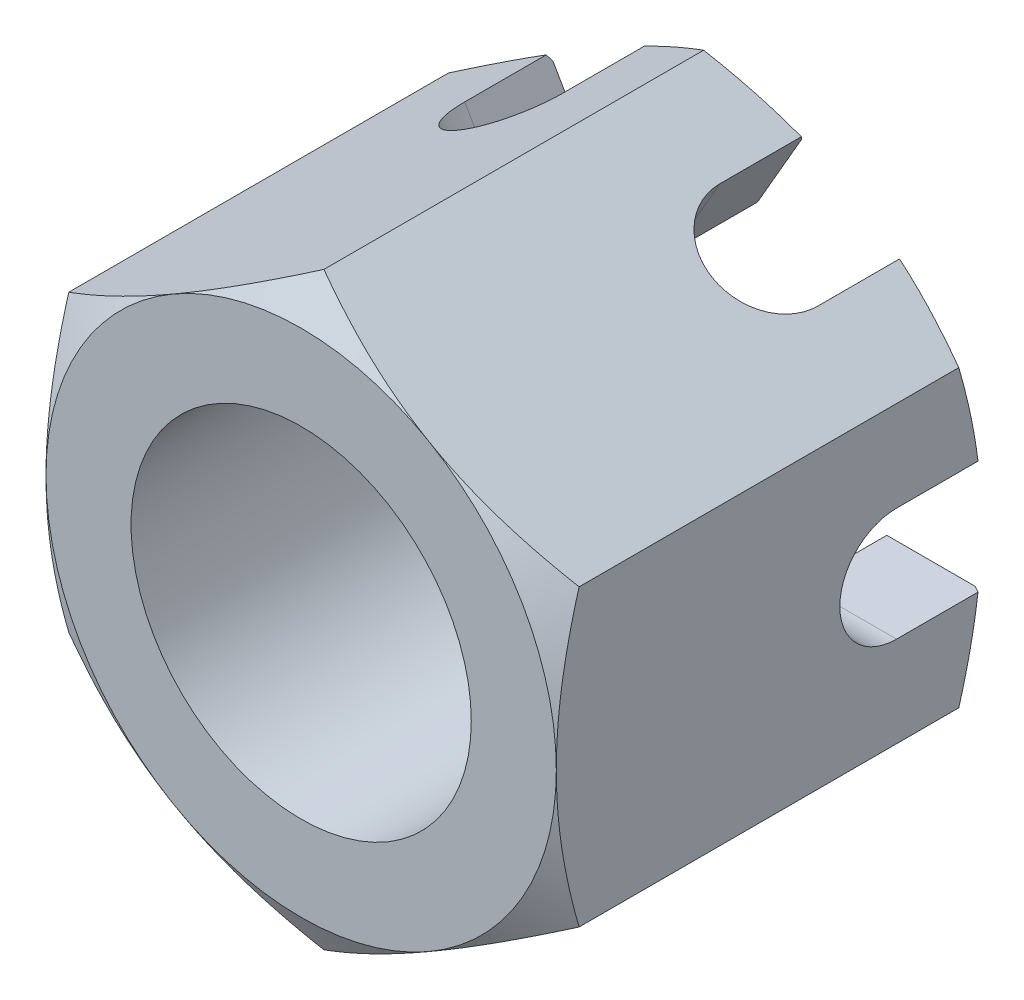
ISO-10303-21;
HEADER;
FILE_DESCRIPTION(('STEP AP214'),'2;1');
FILE_NAME('part.step','',(''),(''),'','','');
FILE_SCHEMA(('AUTOMOTIVE_DESIGN { 1 0 10303 214 1 1 1 1 }'));
ENDSEC;
DATA;
#1=APPLICATION_CONTEXT('core data for automotive mechanical design processes');
#2=APPLICATION_PROTOCOL_DEFINITION('international standard','automotive_design',2000,#1);
#3=PRODUCT_CONTEXT('',#1,'mechanical');
#4=PRODUCT('Part','Part','',(#3));
#5=PRODUCT_RELATED_PRODUCT_CATEGORY('part','',(#4));
#6=PRODUCT_DEFINITION_FORMATION('','',#4);
#7=PRODUCT_DEFINITION_CONTEXT('part definition',#1,'design');
#8=PRODUCT_DEFINITION('design','',#6,#7);
#9=PRODUCT_DEFINITION_SHAPE('','',#8);
#10=(LENGTH_UNIT() NAMED_UNIT(*) SI_UNIT(.MILLI.,.METRE.));
#11=(NAMED_UNIT(*) PLANE_ANGLE_UNIT() SI_UNIT($,.RADIAN.));
#12=(NAMED_UNIT(*) SI_UNIT($,.STERADIAN.) SOLID_ANGLE_UNIT());
#13=UNCERTAINTY_MEASURE_WITH_UNIT(LENGTH_MEASURE(1.E-05),#10,'distance_accuracy_value','');
#14=(GEOMETRIC_REPRESENTATION_CONTEXT(3) GLOBAL_UNCERTAINTY_ASSIGNED_CONTEXT((#13)) GLOBAL_UNIT_ASSIGNED_CONTEXT((#10,
#11,#12)) REPRESENTATION_CONTEXT('',''));
#15=CARTESIAN_POINT('',(0.,0.,0.));
#16=DIRECTION('',(0.,0.,1.));
#17=DIRECTION('',(1.,0.,0.));
#18=AXIS2_PLACEMENT_3D('',#15,#16,#17);
#19=CARTESIAN_POINT('',(-9.,15.5884572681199,-15.));
#20=DIRECTION('',(0.,0.,-1.));
#21=DIRECTION('',(-1.,0.,0.));
#22=AXIS2_PLACEMENT_3D('',#19,#20,#21);
#23=PLANE('',#22);
#24=DIRECTION('',(-0.500000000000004,0.866025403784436,0.));
#25=VECTOR('',#24,1.);
#26=CARTESIAN_POINT('',(8.48205080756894,-10.6913429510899,-15.));
#27=LINE('',#26,#25);
#28=CARTESIAN_POINT('',(6.11953300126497,-6.59934207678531,-15.));
#29=VERTEX_POINT('',#28);
#30=CARTESIAN_POINT('',(4.56047793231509,-3.89897948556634,-15.));
#31=VERTEX_POINT('',#30);
#32=EDGE_CURVE('E323',#29,#31,#27,.T.);
#33=ORIENTED_EDGE('',*,*,#32,.T.);
#34=CARTESIAN_POINT('',(0.,0.,-15.));
#35=DIRECTION('',(0.,0.,1.));
#36=DIRECTION('',(1.,0.,0.));
#37=AXIS2_PLACEMENT_3D('',#34,#35,#36);
#38=CIRCLE('',#37,6.);
#39=CARTESIAN_POINT('',(5.65685424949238,-2.,-15.));
#40=VERTEX_POINT('',#39);
#41=EDGE_CURVE('E571',#31,#40,#38,.T.);
#42=ORIENTED_EDGE('',*,*,#41,.T.);
#43=DIRECTION('',(1.,0.,0.));
#44=VECTOR('',#43,1.);
#45=CARTESIAN_POINT('',(-9.,-2.,-15.));
#46=LINE('',#45,#44);
#47=CARTESIAN_POINT('',(8.77496438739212,-2.,-15.));
#48=VERTEX_POINT('',#47);
#49=EDGE_CURVE('E424',#40,#48,#46,.T.);
#50=ORIENTED_EDGE('',*,*,#49,.T.);
#51=CARTESIAN_POINT('',(0.,0.,-15.));
#52=DIRECTION('',(0.,0.,-1.));
#53=DIRECTION('',(-1.,0.,0.));
#54=AXIS2_PLACEMENT_3D('',#51,#52,#53);
#55=CIRCLE('',#54,9.);
#56=EDGE_CURVE('E541',#29,#48,#55,.F.);
#57=ORIENTED_EDGE('',*,*,#56,.F.);
#58=EDGE_LOOP('',(#33,#42,#50,#57));
#59=FACE_BOUND('',#58,.T.);
#60=ADVANCED_FACE('F26',(#59),#23,.T.);
#61=DIRECTION('',(-0.500000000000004,0.866025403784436,0.));
#62=VECTOR('',#61,1.);
#63=CARTESIAN_POINT('',(5.01794919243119,-12.6913429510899,-15.));
#64=LINE('',#63,#62);
#65=CARTESIAN_POINT('',(2.65543138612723,-8.59934207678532,-15.));
#66=VERTEX_POINT('',#65);
#67=CARTESIAN_POINT('',(1.09637631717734,-5.89897948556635,-15.));
#68=VERTEX_POINT('',#67);
#69=EDGE_CURVE('E329',#66,#68,#64,.T.);
#70=ORIENTED_EDGE('',*,*,#69,.F.);
#71=CARTESIAN_POINT('',(-2.65543138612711,-8.59934207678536,-15.));
#72=VERTEX_POINT('',#71);
#73=EDGE_CURVE('E539',#72,#66,#55,.F.);
#74=ORIENTED_EDGE('',*,*,#73,.F.);
#75=DIRECTION('',(-0.499999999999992,-0.866025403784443,0.));
#76=VECTOR('',#75,1.);
#77=CARTESIAN_POINT('',(8.48205080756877,10.69134295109,-15.));
#78=LINE('',#77,#76);
#79=CARTESIAN_POINT('',(-1.09637631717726,-5.89897948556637,-15.));
#80=VERTEX_POINT('',#79);
#81=EDGE_CURVE('E302',#80,#72,#78,.T.);
#82=ORIENTED_EDGE('',*,*,#81,.F.);
#83=EDGE_CURVE('E572',#80,#68,#38,.T.);
#84=ORIENTED_EDGE('',*,*,#83,.T.);
#85=EDGE_LOOP('',(#70,#74,#82,#84));
#86=FACE_BOUND('',#85,.T.);
#87=ADVANCED_FACE('F813',(#86),#23,.T.);
#88=CARTESIAN_POINT('',(-1.09637631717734,5.89897948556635,-15.));
#89=VERTEX_POINT('',#88);
#90=CARTESIAN_POINT('',(-2.65543138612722,8.59934207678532,-15.));
#91=VERTEX_POINT('',#90);
#92=EDGE_CURVE('E320',#89,#91,#27,.T.);
#93=ORIENTED_EDGE('',*,*,#92,.T.);
#94=CARTESIAN_POINT('',(2.65543138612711,8.59934207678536,-15.));
#95=VERTEX_POINT('',#94);
#96=EDGE_CURVE('E527',#95,#91,#55,.F.);
#97=ORIENTED_EDGE('',*,*,#96,.F.);
#98=DIRECTION('',(-0.499999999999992,-0.866025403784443,0.));
#99=VECTOR('',#98,1.);
#100=CARTESIAN_POINT('',(5.017949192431,12.69134295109,-15.));
#101=LINE('',#100,#99);
#102=CARTESIAN_POINT('',(1.09637631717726,5.89897948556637,-15.));
#103=VERTEX_POINT('',#102);
#104=EDGE_CURVE('E308',#95,#103,#101,.T.);
#105=ORIENTED_EDGE('',*,*,#104,.T.);
#106=EDGE_CURVE('E528',#103,#89,#38,.T.);
#107=ORIENTED_EDGE('',*,*,#106,.T.);
#108=EDGE_LOOP('',(#93,#97,#105,#107));
#109=FACE_BOUND('',#108,.T.);
#110=ADVANCED_FACE('F525',(#109),#23,.T.);
#111=CARTESIAN_POINT('',(-4.56047793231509,3.89897948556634,-15.));
#112=VERTEX_POINT('',#111);
#113=CARTESIAN_POINT('',(-6.11953300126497,6.5993420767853,-15.));
#114=VERTEX_POINT('',#113);
#115=EDGE_CURVE('E319',#112,#114,#64,.T.);
#116=ORIENTED_EDGE('',*,*,#115,.F.);
#117=CARTESIAN_POINT('',(-5.65685424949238,2.,-15.));
#118=VERTEX_POINT('',#117);
#119=EDGE_CURVE('E580',#112,#118,#38,.T.);
#120=ORIENTED_EDGE('',*,*,#119,.T.);
#121=DIRECTION('',(1.,0.,0.));
#122=VECTOR('',#121,1.);
#123=CARTESIAN_POINT('',(-9.,2.,-15.));
#124=LINE('',#123,#122);
#125=CARTESIAN_POINT('',(-8.77496438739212,2.,-15.));
#126=VERTEX_POINT('',#125);
#127=EDGE_CURVE('E437',#126,#118,#124,.T.);
#128=ORIENTED_EDGE('',*,*,#127,.F.);
#129=CARTESIAN_POINT('',(0.,0.,-15.));
#130=DIRECTION('',(0.,0.,-1.));
#131=DIRECTION('',(-1.,0.,0.));
#132=AXIS2_PLACEMENT_3D('',#129,#130,#131);
#133=CIRCLE('',#132,9.);
#134=EDGE_CURVE('E582',#126,#114,#133,.T.);
#135=ORIENTED_EDGE('',*,*,#134,.T.);
#136=EDGE_LOOP('',(#116,#120,#128,#135));
#137=FACE_BOUND('',#136,.T.);
#138=ADVANCED_FACE('F636',(#137),#23,.T.);
#139=CARTESIAN_POINT('',(-4.56047793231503,-3.8989794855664,-15.));
#140=VERTEX_POINT('',#139);
#141=CARTESIAN_POINT('',(-6.11953300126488,-6.59934207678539,-15.));
#142=VERTEX_POINT('',#141);
#143=EDGE_CURVE('E305',#140,#142,#101,.T.);
#144=ORIENTED_EDGE('',*,*,#143,.T.);
#145=CARTESIAN_POINT('',(-8.77496438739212,-2.,-15.));
#146=VERTEX_POINT('',#145);
#147=EDGE_CURVE('E538',#146,#142,#55,.F.);
#148=ORIENTED_EDGE('',*,*,#147,.F.);
#149=CARTESIAN_POINT('',(-5.65685424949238,-2.,-15.));
#150=VERTEX_POINT('',#149);
#151=EDGE_CURVE('E427',#146,#150,#46,.T.);
#152=ORIENTED_EDGE('',*,*,#151,.T.);
#153=EDGE_CURVE('E575',#150,#140,#38,.T.);
#154=ORIENTED_EDGE('',*,*,#153,.T.);
#155=EDGE_LOOP('',(#144,#148,#152,#154));
#156=FACE_BOUND('',#155,.T.);
#157=ADVANCED_FACE('F591',(#156),#23,.T.);
#158=CARTESIAN_POINT('',(-9.,15.5884572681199,0.));
#159=DIRECTION('',(0.,0.,-1.));
#160=DIRECTION('',(-1.,0.,0.));
#161=AXIS2_PLACEMENT_3D('',#158,#159,#160);
#162=PLANE('',#161);
#163=CARTESIAN_POINT('',(0.,0.,0.));
#164=DIRECTION('',(0.,0.,1.));
#165=DIRECTION('',(1.,0.,0.));
#166=AXIS2_PLACEMENT_3D('',#163,#164,#165);
#167=CIRCLE('',#166,6.);
#168=CARTESIAN_POINT('',(6.,0.,0.));
#169=VERTEX_POINT('',#168);
#170=EDGE_CURVE('E567',#169,#169,#167,.T.);
#171=ORIENTED_EDGE('',*,*,#170,.F.);
#172=EDGE_LOOP('',(#171));
#173=FACE_BOUND('',#172,.T.);
#174=CARTESIAN_POINT('',(0.,0.,0.));
#175=DIRECTION('',(0.,0.,-1.));
#176=DIRECTION('',(-1.,0.,0.));
#177=AXIS2_PLACEMENT_3D('',#174,#175,#176);
#178=CIRCLE('',#177,9.);
#179=CARTESIAN_POINT('',(-9.,0.,0.));
#180=VERTEX_POINT('',#179);
#181=CARTESIAN_POINT('',(-4.5,7.79422863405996,0.));
#182=VERTEX_POINT('',#181);
#183=EDGE_CURVE('E640',#180,#182,#178,.T.);
#184=ORIENTED_EDGE('',*,*,#183,.F.);
#185=CARTESIAN_POINT('',(0.,0.,0.));
#186=DIRECTION('',(0.,0.,-1.));
#187=DIRECTION('',(-1.,0.,0.));
#188=AXIS2_PLACEMENT_3D('',#185,#186,#187);
#189=CIRCLE('',#188,9.);
#190=CARTESIAN_POINT('',(-4.49999999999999,-7.79422863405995,0.));
#191=VERTEX_POINT('',#190);
#192=EDGE_CURVE('E536',#180,#191,#189,.F.);
#193=ORIENTED_EDGE('',*,*,#192,.T.);
#194=CARTESIAN_POINT('',(4.49999999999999,-7.79422863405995,0.));
#195=VERTEX_POINT('',#194);
#196=EDGE_CURVE('E543',#191,#195,#189,.F.);
#197=ORIENTED_EDGE('',*,*,#196,.T.);
#198=CARTESIAN_POINT('',(9.,0.,0.));
#199=VERTEX_POINT('',#198);
#200=EDGE_CURVE('E783',#195,#199,#189,.F.);
#201=ORIENTED_EDGE('',*,*,#200,.T.);
#202=CARTESIAN_POINT('',(4.49999999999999,7.79422863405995,0.));
#203=VERTEX_POINT('',#202);
#204=EDGE_CURVE('E775',#199,#203,#189,.F.);
#205=ORIENTED_EDGE('',*,*,#204,.T.);
#206=EDGE_CURVE('E545',#203,#182,#189,.F.);
#207=ORIENTED_EDGE('',*,*,#206,.T.);
#208=EDGE_LOOP('',(#184,#193,#197,#201,#205,#207));
#209=FACE_BOUND('',#208,.T.);
#210=ADVANCED_FACE('F780',(#173,#209),#162,.F.);
#211=CARTESIAN_POINT('',(0.,0.,0.));
#212=DIRECTION('',(0.,0.,-1.));
#213=DIRECTION('',(-1.,0.,0.));
#214=AXIS2_PLACEMENT_3D('',#211,#212,#213);
#215=CONICAL_SURFACE('',#214,9.,1.0471975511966);
#216=CARTESIAN_POINT('',(-9.,-14.1938054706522,-4.50718229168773));
#217=CARTESIAN_POINT('',(-9.,-13.7986249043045,-4.31454599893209));
#218=CARTESIAN_POINT('',(-9.,-13.4025620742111,-4.12368983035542));
#219=CARTESIAN_POINT('',(-9.,-12.6082034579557,-3.74653456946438));
#220=CARTESIAN_POINT('',(-9.,-12.2099073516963,-3.56023615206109));
#221=CARTESIAN_POINT('',(-9.,-11.4086732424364,-3.19230613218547));
#222=CARTESIAN_POINT('',(-9.,-11.005721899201,-3.0107034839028));
#223=CARTESIAN_POINT('',(-9.,-10.1966954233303,-2.65462225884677));
#224=CARTESIAN_POINT('',(-9.,-9.79062043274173,-2.48014336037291));
#225=CARTESIAN_POINT('',(-9.,-8.960816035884,-2.13439771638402));
#226=CARTESIAN_POINT('',(-9.,-8.53695616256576,-1.96344242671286));
#227=CARTESIAN_POINT('',(-9.,-7.68436682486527,-1.63390747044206));
#228=CARTESIAN_POINT('',(-9.,-7.25563683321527,-1.47532915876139));
#229=CARTESIAN_POINT('',(-9.,-6.39334839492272,-1.17453858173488));
#230=CARTESIAN_POINT('',(-9.,-5.9598009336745,-1.03229515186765));
#231=CARTESIAN_POINT('',(-9.,-5.08650675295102,-0.768579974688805));
#232=CARTESIAN_POINT('',(-9.,-4.64676195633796,-0.647101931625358));
#233=CARTESIAN_POINT('',(-9.,-3.76318857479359,-0.431240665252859));
#234=CARTESIAN_POINT('',(-9.,-3.31939822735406,-0.336705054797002));
#235=CARTESIAN_POINT('',(-9.,-2.64948950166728,-0.219087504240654));
#236=CARTESIAN_POINT('',(-9.,-2.42546830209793,-0.183911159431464));
#237=CARTESIAN_POINT('',(-9.,-1.97623392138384,-0.122303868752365));
#238=CARTESIAN_POINT('',(-9.,-1.75102085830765,-0.0958720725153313));
#239=CARTESIAN_POINT('',(-9.,-1.30274989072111,-0.0526248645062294));
#240=CARTESIAN_POINT('',(-9.,-1.07970414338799,-0.0356839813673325));
#241=CARTESIAN_POINT('',(-9.,-0.633095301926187,-0.0112589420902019));
#242=CARTESIAN_POINT('',(-9.,-0.409532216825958,-0.00377462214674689));
#243=CARTESIAN_POINT('',(-9.,0.0377121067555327,0.00155767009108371));
#244=CARTESIAN_POINT('',(-9.,0.261393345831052,-0.000594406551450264));
#245=CARTESIAN_POINT('',(-9.,0.708460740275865,-0.014479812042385));
#246=CARTESIAN_POINT('',(-9.,0.931846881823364,-0.0262135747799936));
#247=CARTESIAN_POINT('',(-9.,1.46162752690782,-0.0651496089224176));
#248=CARTESIAN_POINT('',(-9.,1.76772399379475,-0.0965034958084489));
#249=CARTESIAN_POINT('',(-9.,2.377784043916,-0.175544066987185));
#250=CARTESIAN_POINT('',(-9.,2.68174735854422,-0.223232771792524));
#251=CARTESIAN_POINT('',(-9.,3.59000335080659,-0.388283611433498));
#252=CARTESIAN_POINT('',(-9.,4.19036603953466,-0.527605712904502));
#253=CARTESIAN_POINT('',(-9.,5.08858153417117,-0.771019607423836));
#254=CARTESIAN_POINT('',(-9.,5.39104017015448,-0.859108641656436));
#255=CARTESIAN_POINT('',(-9.,5.9930241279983,-1.04488568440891));
#256=CARTESIAN_POINT('',(-9.,6.29254942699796,-1.14257376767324));
#257=CARTESIAN_POINT('',(-9.,6.88875586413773,-1.34594446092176));
#258=CARTESIAN_POINT('',(-9.,7.18543776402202,-1.45162485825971));
#259=CARTESIAN_POINT('',(-9.,7.77631041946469,-1.66969192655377));
#260=CARTESIAN_POINT('',(-9.,8.07050123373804,-1.78207843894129));
#261=CARTESIAN_POINT('',(-9.,8.8676809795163,-2.09537259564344));
#262=CARTESIAN_POINT('',(-9.,9.36851420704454,-2.30176048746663));
#263=CARTESIAN_POINT('',(-9.,10.36496471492,-2.72681002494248));
#264=CARTESIAN_POINT('',(-9.,10.8605813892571,-2.94547307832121));
#265=CARTESIAN_POINT('',(-9.,11.8478077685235,-3.39214475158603));
#266=CARTESIAN_POINT('',(-9.,12.3394158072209,-3.62015704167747));
#267=CARTESIAN_POINT('',(-9.,13.3192435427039,-4.08327241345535));
#268=CARTESIAN_POINT('',(-9.,13.8074633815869,-4.31837519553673));
#269=CARTESIAN_POINT('',(-9.,14.7819931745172,-4.79450752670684));
#270=CARTESIAN_POINT('',(-9.,15.2682986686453,-5.03554618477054));
#271=CARTESIAN_POINT('',(-9.,16.2387067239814,-5.5220207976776));
#272=CARTESIAN_POINT('',(-9.,16.7228092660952,-5.7674567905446));
#273=CARTESIAN_POINT('',(-9.,17.6890969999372,-6.26180010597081));
#274=CARTESIAN_POINT('',(-9.,18.1712826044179,-6.51070662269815));
#275=CARTESIAN_POINT('',(-9.,19.1341609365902,-7.01139226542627));
#276=CARTESIAN_POINT('',(-9.,19.6148536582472,-7.2631714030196));
#277=CARTESIAN_POINT('',(-9.,20.9522159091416,-7.96783942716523));
#278=CARTESIAN_POINT('',(-9.,21.8075292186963,-8.42330168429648));
#279=CARTESIAN_POINT('',(-9.,23.515298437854,-9.33966951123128));
#280=CARTESIAN_POINT('',(-9.,24.3677541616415,-9.80057542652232));
#281=CARTESIAN_POINT('',(-9.,26.067548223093,-10.724858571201));
#282=CARTESIAN_POINT('',(-9.,26.914894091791,-11.1882219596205));
#283=CARTESIAN_POINT('',(-9.,28.1846057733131,-11.8855636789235));
#284=CARTESIAN_POINT('',(-9.,28.6076082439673,-12.1183843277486));
#285=CARTESIAN_POINT('',(-9.,29.453234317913,-12.5847114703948));
#286=CARTESIAN_POINT('',(-9.,29.8758579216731,-12.8182179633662));
#287=CARTESIAN_POINT('',(-9.,30.2983153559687,-13.0520247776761));
#288=B_SPLINE_CURVE_WITH_KNOTS('',3,(#216,#217,#218,#219,#220,#221,#222,#223,#224,#225,#226,
#227,#228,#229,#230,#231,#232,#233,#234,#235,#236,#237,#238,#239,#240,#241,#242,#243,#244,#245,
#246,#247,#248,#249,#250,#251,#252,#253,#254,#255,#256,#257,#258,#259,#260,#261,#262,#263,#264,
#265,#266,#267,#268,#269,#270,#271,#272,#273,#274,#275,#276,#277,#278,#279,#280,#281,#282,#283,
#284,#285,#286,#287),.UNSPECIFIED.,.F.,.F.,(4,2,2,2,2,2,2,2,2,2,2,2,2,2,2,2,2,2,2,2,2,2,2,2,2,2,
2,2,2,2,2,2,2,2,2,4),(0.,1.31891143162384,2.63801699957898,3.9639117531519,5.28974656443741,
6.66070766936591,8.03181864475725,9.40026868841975,10.7683030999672,12.1284389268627,
12.8085936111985,13.4886821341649,14.1595537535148,14.8304137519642,15.5012771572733,
16.1721709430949,17.094749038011,18.0174412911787,19.8637129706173,20.808703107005,
21.7537006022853,22.698437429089,23.6431519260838,25.2679809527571,26.8929966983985,
28.5186565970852,30.1442479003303,31.7725119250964,33.4007900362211,35.0286961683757,
36.6566088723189,39.5636489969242,42.4708746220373,45.3681585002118,46.8166845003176,
48.2652087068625),.UNSPECIFIED.);
#289=CARTESIAN_POINT('',(-9.,5.19615242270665,-0.803847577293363));
#290=VERTEX_POINT('',#289);
#291=EDGE_CURVE('E650',#290,#180,#288,.F.);
#292=ORIENTED_EDGE('',*,*,#291,.T.);
#293=ORIENTED_EDGE('',*,*,#183,.T.);
#294=CARTESIAN_POINT('',(0.0002,10.3924203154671,-0.803914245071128));
#295=CARTESIAN_POINT('',(-0.197607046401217,10.2782163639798,-0.737982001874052));
#296=CARTESIAN_POINT('',(-0.396185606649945,10.1635669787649,-0.67504140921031));
#297=CARTESIAN_POINT('',(-0.79495536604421,9.93333715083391,-0.555968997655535));
#298=CARTESIAN_POINT('',(-0.99514722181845,9.81775632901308,-0.499840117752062));
#299=CARTESIAN_POINT('',(-1.3975150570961,9.58544915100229,-0.395151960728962));
#300=CARTESIAN_POINT('',(-1.5996945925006,9.46872074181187,-0.346610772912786));
#301=CARTESIAN_POINT('',(-2.00542875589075,9.23447001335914,-0.258148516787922));
#302=CARTESIAN_POINT('',(-2.20898309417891,9.11694786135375,-0.218225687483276));
#303=CARTESIAN_POINT('',(-2.61230590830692,8.88408932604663,-0.148684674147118));
#304=CARTESIAN_POINT('',(-2.81204459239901,8.76877014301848,-0.118837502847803));
#305=CARTESIAN_POINT('',(-3.212415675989,8.53761579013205,-0.0687933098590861));
#306=CARTESIAN_POINT('',(-3.41304799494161,8.42178066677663,-0.0485954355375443));
#307=CARTESIAN_POINT('',(-3.81466063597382,8.18990950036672,-0.0183543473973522));
#308=CARTESIAN_POINT('',(-4.01564030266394,8.07387383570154,-0.00829960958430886));
#309=CARTESIAN_POINT('',(-4.41778459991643,7.84169571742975,0.00143766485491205));
#310=CARTESIAN_POINT('',(-4.61894922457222,7.72555326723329,0.00112052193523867));
#311=CARTESIAN_POINT('',(-4.9950326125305,7.50842142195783,-0.00916395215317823));
#312=CARTESIAN_POINT('',(-5.16997789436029,7.40741671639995,-0.0178767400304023));
#313=CARTESIAN_POINT('',(-5.51945867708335,7.20564389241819,-0.0429773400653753));
#314=CARTESIAN_POINT('',(-5.69399414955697,7.10487579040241,-0.0593656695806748));
#315=CARTESIAN_POINT('',(-6.21692487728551,6.80296159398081,-0.119656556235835));
#316=CARTESIAN_POINT('',(-6.56439451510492,6.60234990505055,-0.174677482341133));
#317=CARTESIAN_POINT('',(-7.263019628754,6.19899850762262,-0.312230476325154));
#318=CARTESIAN_POINT('',(-7.61408594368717,5.99631027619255,-0.39534561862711));
#319=CARTESIAN_POINT('',(-8.3109833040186,5.59395639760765,-0.583982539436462));
#320=CARTESIAN_POINT('',(-8.65682327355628,5.39428559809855,-0.689460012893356));
#321=CARTESIAN_POINT('',(-9.0002,5.19603695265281,-0.803914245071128));
#322=B_SPLINE_CURVE_WITH_KNOTS('',3,(#294,#295,#296,#297,#298,#299,#300,#301,#302,#303,#304,
#305,#306,#307,#308,#309,#310,#311,#312,#313,#314,#315,#316,#317,#318,#319,#320,#321),
.UNSPECIFIED.,.F.,.F.,(4,2,2,2,2,2,2,2,2,2,2,2,2,4),(0.,0.713219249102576,1.42674513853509,
2.14194697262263,2.8570025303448,3.55449749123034,4.25193080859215,4.94857085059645,
5.64518936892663,6.25162976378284,6.8581110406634,8.07193747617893,9.31268391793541,
10.5509947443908),.UNSPECIFIED.);
#323=EDGE_CURVE('E642',#182,#290,#322,.T.);
#324=ORIENTED_EDGE('',*,*,#323,.T.);
#325=EDGE_LOOP('',(#292,#293,#324));
#326=FACE_BOUND('',#325,.T.);
#327=ADVANCED_FACE('F465',(#326),#215,.T.);
#328=CARTESIAN_POINT('',(9.0002,5.19603695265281,-0.803914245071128));
#329=CARTESIAN_POINT('',(8.80239295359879,5.31024090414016,-0.73798200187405));
#330=CARTESIAN_POINT('',(8.60381439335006,5.42489028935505,-0.675041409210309));
#331=CARTESIAN_POINT('',(8.20504463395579,5.65512011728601,-0.555968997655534));
#332=CARTESIAN_POINT('',(8.00485277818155,5.77070093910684,-0.499840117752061));
#333=CARTESIAN_POINT('',(7.6024849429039,6.00300811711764,-0.395151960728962));
#334=CARTESIAN_POINT('',(7.4003054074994,6.11973652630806,-0.346610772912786));
#335=CARTESIAN_POINT('',(6.99457124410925,6.35398725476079,-0.258148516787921));
#336=CARTESIAN_POINT('',(6.79101690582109,6.47150940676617,-0.218225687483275));
#337=CARTESIAN_POINT('',(6.38769409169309,6.70436794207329,-0.148684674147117));
#338=CARTESIAN_POINT('',(6.187955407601,6.81968712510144,-0.118837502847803));
#339=CARTESIAN_POINT('',(5.787584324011,7.05084147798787,-0.0687933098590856));
#340=CARTESIAN_POINT('',(5.58695200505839,7.1666766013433,-0.0485954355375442));
#341=CARTESIAN_POINT('',(5.18533936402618,7.3985477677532,-0.0183543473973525));
#342=CARTESIAN_POINT('',(4.98435969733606,7.51458343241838,-0.00829960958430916));
#343=CARTESIAN_POINT('',(4.58221540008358,7.74676155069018,0.00143766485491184));
#344=CARTESIAN_POINT('',(4.38105077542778,7.86290400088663,0.00112052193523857));
#345=CARTESIAN_POINT('',(4.0049673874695,8.08003584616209,-0.00916395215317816));
#346=CARTESIAN_POINT('',(3.83002210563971,8.18104055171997,-0.0178767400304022));
#347=CARTESIAN_POINT('',(3.48054132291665,8.38281337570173,-0.0429773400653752));
#348=CARTESIAN_POINT('',(3.30600585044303,8.48358147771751,-0.0593656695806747));
#349=CARTESIAN_POINT('',(2.7830751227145,8.78549567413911,-0.119656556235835));
#350=CARTESIAN_POINT('',(2.43560548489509,8.98610736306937,-0.174677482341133));
#351=CARTESIAN_POINT('',(1.736980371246,9.3894587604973,-0.312230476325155));
#352=CARTESIAN_POINT('',(1.38591405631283,9.59214699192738,-0.39534561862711));
#353=CARTESIAN_POINT('',(0.689016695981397,9.99450087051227,-0.583982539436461));
#354=CARTESIAN_POINT('',(0.343176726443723,10.1941716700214,-0.689460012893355));
#355=CARTESIAN_POINT('',(-0.000199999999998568,10.3924203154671,-0.803914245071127));
#356=B_SPLINE_CURVE_WITH_KNOTS('',3,(#328,#329,#330,#331,#332,#333,#334,#335,#336,#337,#338,
#339,#340,#341,#342,#343,#344,#345,#346,#347,#348,#349,#350,#351,#352,#353,#354,#355),
.UNSPECIFIED.,.F.,.F.,(4,2,2,2,2,2,2,2,2,2,2,2,2,4),(0.,0.713219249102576,1.42674513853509,
2.14194697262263,2.8570025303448,3.55449749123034,4.25193080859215,4.94857085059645,
5.64518936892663,6.25162976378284,6.8581110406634,8.07193747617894,9.31268391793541,
10.5509947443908),.UNSPECIFIED.);
#357=CARTESIAN_POINT('',(0.,10.3923048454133,-0.803847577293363));
#358=VERTEX_POINT('',#357);
#359=EDGE_CURVE('E710',#203,#358,#356,.T.);
#360=ORIENTED_EDGE('',*,*,#359,.T.);
#361=EDGE_CURVE('E649',#358,#182,#322,.T.);
#362=ORIENTED_EDGE('',*,*,#361,.T.);
#363=ORIENTED_EDGE('',*,*,#206,.F.);
#364=EDGE_LOOP('',(#360,#362,#363));
#365=FACE_BOUND('',#364,.T.);
#366=ADVANCED_FACE('F778',(#365),#215,.T.);
#367=CARTESIAN_POINT('',(9.,-14.1938054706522,-4.50718229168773));
#368=CARTESIAN_POINT('',(9.,-13.7986249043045,-4.31454599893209));
#369=CARTESIAN_POINT('',(9.,-13.4025620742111,-4.12368983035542));
#370=CARTESIAN_POINT('',(9.,-12.6082034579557,-3.74653456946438));
#371=CARTESIAN_POINT('',(9.,-12.2099073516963,-3.56023615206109));
#372=CARTESIAN_POINT('',(9.,-11.4086732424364,-3.19230613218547));
#373=CARTESIAN_POINT('',(9.,-11.005721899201,-3.0107034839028));
#374=CARTESIAN_POINT('',(9.,-10.1966954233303,-2.65462225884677));
#375=CARTESIAN_POINT('',(9.,-9.79062043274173,-2.48014336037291));
#376=CARTESIAN_POINT('',(9.,-8.960816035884,-2.13439771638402));
#377=CARTESIAN_POINT('',(9.,-8.53695616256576,-1.96344242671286));
#378=CARTESIAN_POINT('',(9.,-7.68436682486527,-1.63390747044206));
#379=CARTESIAN_POINT('',(9.,-7.25563683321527,-1.47532915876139));
#380=CARTESIAN_POINT('',(9.,-6.39334839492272,-1.17453858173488));
#381=CARTESIAN_POINT('',(9.,-5.9598009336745,-1.03229515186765));
#382=CARTESIAN_POINT('',(9.,-5.08650675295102,-0.768579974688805));
#383=CARTESIAN_POINT('',(9.,-4.64676195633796,-0.647101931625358));
#384=CARTESIAN_POINT('',(9.,-3.76318857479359,-0.431240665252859));
#385=CARTESIAN_POINT('',(9.,-3.31939822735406,-0.336705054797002));
#386=CARTESIAN_POINT('',(9.,-2.64948950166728,-0.219087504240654));
#387=CARTESIAN_POINT('',(9.,-2.42546830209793,-0.183911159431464));
#388=CARTESIAN_POINT('',(9.,-1.97623392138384,-0.122303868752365));
#389=CARTESIAN_POINT('',(9.,-1.75102085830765,-0.0958720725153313));
#390=CARTESIAN_POINT('',(9.,-1.30274989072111,-0.0526248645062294));
#391=CARTESIAN_POINT('',(9.,-1.07970414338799,-0.0356839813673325));
#392=CARTESIAN_POINT('',(9.,-0.633095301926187,-0.0112589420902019));
#393=CARTESIAN_POINT('',(9.,-0.409532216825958,-0.00377462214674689));
#394=CARTESIAN_POINT('',(9.,0.0377121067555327,0.00155767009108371));
#395=CARTESIAN_POINT('',(9.,0.261393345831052,-0.000594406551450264));
#396=CARTESIAN_POINT('',(9.,0.708460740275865,-0.014479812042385));
#397=CARTESIAN_POINT('',(9.,0.931846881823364,-0.0262135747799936));
#398=CARTESIAN_POINT('',(9.,1.46162752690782,-0.0651496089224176));
#399=CARTESIAN_POINT('',(9.,1.76772399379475,-0.0965034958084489));
#400=CARTESIAN_POINT('',(9.,2.377784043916,-0.175544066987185));
#401=CARTESIAN_POINT('',(9.,2.68174735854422,-0.223232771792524));
#402=CARTESIAN_POINT('',(9.,3.59000335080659,-0.388283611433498));
#403=CARTESIAN_POINT('',(9.,4.19036603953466,-0.527605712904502));
#404=CARTESIAN_POINT('',(9.,5.08858153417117,-0.771019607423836));
#405=CARTESIAN_POINT('',(9.,5.39104017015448,-0.859108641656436));
#406=CARTESIAN_POINT('',(9.,5.9930241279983,-1.04488568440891));
#407=CARTESIAN_POINT('',(9.,6.29254942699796,-1.14257376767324));
#408=CARTESIAN_POINT('',(9.,6.88875586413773,-1.34594446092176));
#409=CARTESIAN_POINT('',(9.,7.18543776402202,-1.45162485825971));
#410=CARTESIAN_POINT('',(9.,7.77631041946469,-1.66969192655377));
#411=CARTESIAN_POINT('',(9.,8.07050123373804,-1.78207843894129));
#412=CARTESIAN_POINT('',(9.,8.8676809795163,-2.09537259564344));
#413=CARTESIAN_POINT('',(9.,9.36851420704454,-2.30176048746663));
#414=CARTESIAN_POINT('',(9.,10.36496471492,-2.72681002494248));
#415=CARTESIAN_POINT('',(9.,10.8605813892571,-2.94547307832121));
#416=CARTESIAN_POINT('',(9.,11.8478077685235,-3.39214475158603));
#417=CARTESIAN_POINT('',(9.,12.3394158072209,-3.62015704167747));
#418=CARTESIAN_POINT('',(9.,13.3192435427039,-4.08327241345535));
#419=CARTESIAN_POINT('',(9.,13.8074633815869,-4.31837519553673));
#420=CARTESIAN_POINT('',(9.,14.7819931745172,-4.79450752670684));
#421=CARTESIAN_POINT('',(9.,15.2682986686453,-5.03554618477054));
#422=CARTESIAN_POINT('',(9.,16.2387067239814,-5.5220207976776));
#423=CARTESIAN_POINT('',(9.,16.7228092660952,-5.7674567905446));
#424=CARTESIAN_POINT('',(9.,17.6890969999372,-6.26180010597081));
#425=CARTESIAN_POINT('',(9.,18.1712826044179,-6.51070662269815));
#426=CARTESIAN_POINT('',(9.,19.1341609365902,-7.01139226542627));
#427=CARTESIAN_POINT('',(9.,19.6148536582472,-7.2631714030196));
#428=CARTESIAN_POINT('',(9.,20.9522159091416,-7.96783942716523));
#429=CARTESIAN_POINT('',(9.,21.8075292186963,-8.42330168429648));
#430=CARTESIAN_POINT('',(9.,23.515298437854,-9.33966951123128));
#431=CARTESIAN_POINT('',(9.,24.3677541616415,-9.80057542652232));
#432=CARTESIAN_POINT('',(9.,26.067548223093,-10.724858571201));
#433=CARTESIAN_POINT('',(9.,26.914894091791,-11.1882219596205));
#434=CARTESIAN_POINT('',(9.,28.1846057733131,-11.8855636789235));
#435=CARTESIAN_POINT('',(9.,28.6076082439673,-12.1183843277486));
#436=CARTESIAN_POINT('',(9.,29.453234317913,-12.5847114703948));
#437=CARTESIAN_POINT('',(9.,29.8758579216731,-12.8182179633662));
#438=CARTESIAN_POINT('',(9.,30.2983153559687,-13.0520247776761));
#439=B_SPLINE_CURVE_WITH_KNOTS('',3,(#367,#368,#369,#370,#371,#372,#373,#374,#375,#376,#377,
#378,#379,#380,#381,#382,#383,#384,#385,#386,#387,#388,#389,#390,#391,#392,#393,#394,#395,#396,
#397,#398,#399,#400,#401,#402,#403,#404,#405,#406,#407,#408,#409,#410,#411,#412,#413,#414,#415,
#416,#417,#418,#419,#420,#421,#422,#423,#424,#425,#426,#427,#428,#429,#430,#431,#432,#433,#434,
#435,#436,#437,#438),.UNSPECIFIED.,.F.,.F.,(4,2,2,2,2,2,2,2,2,2,2,2,2,2,2,2,2,2,2,2,2,2,2,2,2,2,
2,2,2,2,2,2,2,2,2,4),(0.,1.31891143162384,2.63801699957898,3.9639117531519,5.28974656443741,
6.66070766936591,8.03181864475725,9.40026868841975,10.7683030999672,12.1284389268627,
12.8085936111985,13.4886821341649,14.1595537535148,14.8304137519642,15.5012771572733,
16.1721709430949,17.094749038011,18.0174412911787,19.8637129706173,20.808703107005,
21.7537006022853,22.698437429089,23.6431519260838,25.2679809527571,26.8929966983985,
28.5186565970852,30.1442479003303,31.7725119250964,33.4007900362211,35.0286961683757,
36.6566088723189,39.5636489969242,42.4708746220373,45.3681585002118,46.8166845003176,
48.2652087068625),.UNSPECIFIED.);
#440=CARTESIAN_POINT('',(9.,5.19615242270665,-0.803847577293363));
#441=VERTEX_POINT('',#440);
#442=EDGE_CURVE('E707',#199,#441,#439,.T.);
#443=ORIENTED_EDGE('',*,*,#442,.T.);
#444=EDGE_CURVE('E766',#441,#203,#356,.T.);
#445=ORIENTED_EDGE('',*,*,#444,.T.);
#446=ORIENTED_EDGE('',*,*,#204,.F.);
#447=EDGE_LOOP('',(#443,#445,#446));
#448=FACE_BOUND('',#447,.T.);
#449=ADVANCED_FACE('F773',(#448),#215,.T.);
#450=CARTESIAN_POINT('',(-0.0002,-10.3924203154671,-0.803914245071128));
#451=CARTESIAN_POINT('',(0.197607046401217,-10.2782163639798,-0.737982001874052));
#452=CARTESIAN_POINT('',(0.396185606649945,-10.1635669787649,-0.67504140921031));
#453=CARTESIAN_POINT('',(0.79495536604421,-9.93333715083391,-0.555968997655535));
#454=CARTESIAN_POINT('',(0.99514722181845,-9.81775632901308,-0.499840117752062));
#455=CARTESIAN_POINT('',(1.3975150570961,-9.58544915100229,-0.395151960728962));
#456=CARTESIAN_POINT('',(1.5996945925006,-9.46872074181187,-0.346610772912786));
#457=CARTESIAN_POINT('',(2.00542875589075,-9.23447001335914,-0.258148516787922));
#458=CARTESIAN_POINT('',(2.20898309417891,-9.11694786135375,-0.218225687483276));
#459=CARTESIAN_POINT('',(2.61230590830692,-8.88408932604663,-0.148684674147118));
#460=CARTESIAN_POINT('',(2.81204459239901,-8.76877014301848,-0.118837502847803));
#461=CARTESIAN_POINT('',(3.212415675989,-8.53761579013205,-0.0687933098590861));
#462=CARTESIAN_POINT('',(3.41304799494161,-8.42178066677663,-0.0485954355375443));
#463=CARTESIAN_POINT('',(3.81466063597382,-8.18990950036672,-0.0183543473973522));
#464=CARTESIAN_POINT('',(4.01564030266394,-8.07387383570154,-0.00829960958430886));
#465=CARTESIAN_POINT('',(4.41778459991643,-7.84169571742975,0.00143766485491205));
#466=CARTESIAN_POINT('',(4.61894922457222,-7.72555326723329,0.00112052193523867));
#467=CARTESIAN_POINT('',(4.9950326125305,-7.50842142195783,-0.00916395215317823));
#468=CARTESIAN_POINT('',(5.16997789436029,-7.40741671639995,-0.0178767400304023));
#469=CARTESIAN_POINT('',(5.51945867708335,-7.20564389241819,-0.0429773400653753));
#470=CARTESIAN_POINT('',(5.69399414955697,-7.10487579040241,-0.0593656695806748));
#471=CARTESIAN_POINT('',(6.21692487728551,-6.80296159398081,-0.119656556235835));
#472=CARTESIAN_POINT('',(6.56439451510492,-6.60234990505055,-0.174677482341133));
#473=CARTESIAN_POINT('',(7.263019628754,-6.19899850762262,-0.312230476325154));
#474=CARTESIAN_POINT('',(7.61408594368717,-5.99631027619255,-0.39534561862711));
#475=CARTESIAN_POINT('',(8.3109833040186,-5.59395639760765,-0.583982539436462));
#476=CARTESIAN_POINT('',(8.65682327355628,-5.39428559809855,-0.689460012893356));
#477=CARTESIAN_POINT('',(9.0002,-5.19603695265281,-0.803914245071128));
#478=B_SPLINE_CURVE_WITH_KNOTS('',3,(#450,#451,#452,#453,#454,#455,#456,#457,#458,#459,#460,
#461,#462,#463,#464,#465,#466,#467,#468,#469,#470,#471,#472,#473,#474,#475,#476,#477),
.UNSPECIFIED.,.F.,.F.,(4,2,2,2,2,2,2,2,2,2,2,2,2,4),(0.,0.713219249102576,1.42674513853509,
2.14194697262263,2.8570025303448,3.55449749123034,4.25193080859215,4.94857085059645,
5.64518936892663,6.25162976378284,6.8581110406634,8.07193747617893,9.31268391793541,
10.5509947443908),.UNSPECIFIED.);
#479=CARTESIAN_POINT('',(9.,-5.19615242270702,-0.80384757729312));
#480=VERTEX_POINT('',#479);
#481=EDGE_CURVE('E673',#195,#480,#478,.T.);
#482=ORIENTED_EDGE('',*,*,#481,.T.);
#483=EDGE_CURVE('E717',#480,#199,#439,.T.);
#484=ORIENTED_EDGE('',*,*,#483,.T.);
#485=ORIENTED_EDGE('',*,*,#200,.F.);
#486=EDGE_LOOP('',(#482,#484,#485));
#487=FACE_BOUND('',#486,.T.);
#488=ADVANCED_FACE('F796',(#487),#215,.T.);
#489=CARTESIAN_POINT('',(0.,-10.3923048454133,-0.803847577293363));
#490=VERTEX_POINT('',#489);
#491=EDGE_CURVE('E672',#490,#195,#478,.T.);
#492=ORIENTED_EDGE('',*,*,#491,.T.);
#493=ORIENTED_EDGE('',*,*,#196,.F.);
#494=CARTESIAN_POINT('',(-9.0002,-5.19603695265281,-0.803914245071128));
#495=CARTESIAN_POINT('',(-8.80239295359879,-5.31024090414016,-0.73798200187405));
#496=CARTESIAN_POINT('',(-8.60381439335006,-5.42489028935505,-0.675041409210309));
#497=CARTESIAN_POINT('',(-8.20504463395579,-5.65512011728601,-0.555968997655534));
#498=CARTESIAN_POINT('',(-8.00485277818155,-5.77070093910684,-0.499840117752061));
#499=CARTESIAN_POINT('',(-7.6024849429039,-6.00300811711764,-0.395151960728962));
#500=CARTESIAN_POINT('',(-7.4003054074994,-6.11973652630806,-0.346610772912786));
#501=CARTESIAN_POINT('',(-6.99457124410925,-6.35398725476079,-0.258148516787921));
#502=CARTESIAN_POINT('',(-6.79101690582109,-6.47150940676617,-0.218225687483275));
#503=CARTESIAN_POINT('',(-6.38769409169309,-6.70436794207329,-0.148684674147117));
#504=CARTESIAN_POINT('',(-6.187955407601,-6.81968712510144,-0.118837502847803));
#505=CARTESIAN_POINT('',(-5.787584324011,-7.05084147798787,-0.0687933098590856));
#506=CARTESIAN_POINT('',(-5.58695200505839,-7.1666766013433,-0.0485954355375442));
#507=CARTESIAN_POINT('',(-5.18533936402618,-7.3985477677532,-0.0183543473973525));
#508=CARTESIAN_POINT('',(-4.98435969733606,-7.51458343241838,-0.00829960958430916));
#509=CARTESIAN_POINT('',(-4.58221540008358,-7.74676155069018,0.00143766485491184));
#510=CARTESIAN_POINT('',(-4.38105077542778,-7.86290400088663,0.00112052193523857));
#511=CARTESIAN_POINT('',(-4.0049673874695,-8.08003584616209,-0.00916395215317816));
#512=CARTESIAN_POINT('',(-3.83002210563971,-8.18104055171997,-0.0178767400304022));
#513=CARTESIAN_POINT('',(-3.48054132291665,-8.38281337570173,-0.0429773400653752));
#514=CARTESIAN_POINT('',(-3.30600585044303,-8.48358147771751,-0.0593656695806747));
#515=CARTESIAN_POINT('',(-2.7830751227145,-8.78549567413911,-0.119656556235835));
#516=CARTESIAN_POINT('',(-2.43560548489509,-8.98610736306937,-0.174677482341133));
#517=CARTESIAN_POINT('',(-1.736980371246,-9.3894587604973,-0.312230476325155));
#518=CARTESIAN_POINT('',(-1.38591405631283,-9.59214699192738,-0.39534561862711));
#519=CARTESIAN_POINT('',(-0.689016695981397,-9.99450087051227,-0.583982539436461));
#520=CARTESIAN_POINT('',(-0.343176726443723,-10.1941716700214,-0.689460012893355));
#521=CARTESIAN_POINT('',(0.000199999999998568,-10.3924203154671,-0.803914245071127));
#522=B_SPLINE_CURVE_WITH_KNOTS('',3,(#494,#495,#496,#497,#498,#499,#500,#501,#502,#503,#504,
#505,#506,#507,#508,#509,#510,#511,#512,#513,#514,#515,#516,#517,#518,#519,#520,#521),
.UNSPECIFIED.,.F.,.F.,(4,2,2,2,2,2,2,2,2,2,2,2,2,4),(0.,0.713219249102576,1.42674513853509,
2.14194697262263,2.8570025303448,3.55449749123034,4.25193080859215,4.94857085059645,
5.64518936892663,6.25162976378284,6.8581110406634,8.07193747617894,9.31268391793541,
10.5509947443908),.UNSPECIFIED.);
#523=EDGE_CURVE('E709',#191,#490,#522,.T.);
#524=ORIENTED_EDGE('',*,*,#523,.T.);
#525=EDGE_LOOP('',(#492,#493,#524));
#526=FACE_BOUND('',#525,.T.);
#527=ADVANCED_FACE('F972',(#526),#215,.T.);
#528=CARTESIAN_POINT('',(-9.,-5.19615242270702,-0.80384757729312));
#529=VERTEX_POINT('',#528);
#530=EDGE_CURVE('E703',#529,#191,#522,.T.);
#531=ORIENTED_EDGE('',*,*,#530,.T.);
#532=ORIENTED_EDGE('',*,*,#192,.F.);
#533=EDGE_CURVE('E708',#180,#529,#288,.F.);
#534=ORIENTED_EDGE('',*,*,#533,.T.);
#535=EDGE_LOOP('',(#531,#532,#534));
#536=FACE_BOUND('',#535,.T.);
#537=ADVANCED_FACE('F968',(#536),#215,.T.);
#538=CARTESIAN_POINT('',(9.,5.19615242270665,-15.));
#539=DIRECTION('',(0.499999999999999,0.866025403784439,0.));
#540=DIRECTION('',(-0.866025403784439,0.499999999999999,0.));
#541=AXIS2_PLACEMENT_3D('',#538,#539,#540);
#542=PLANE('',#541);
#543=DIRECTION('',(0.,0.,1.));
#544=VECTOR('',#543,1.);
#545=CARTESIAN_POINT('',(2.76794919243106,8.79422863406,-15.));
#546=LINE('',#545,#544);
#547=CARTESIAN_POINT('',(2.76794919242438,8.79422863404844,-14.8732459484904));
#548=VERTEX_POINT('',#547);
#549=CARTESIAN_POINT('',(2.76794919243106,8.79422863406,-12.));
#550=VERTEX_POINT('',#549);
#551=EDGE_CURVE('E756',#548,#550,#546,.T.);
#552=ORIENTED_EDGE('',*,*,#551,.F.);
#553=CARTESIAN_POINT('',(-0.0002,10.3924203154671,-14.1960857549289));
#554=CARTESIAN_POINT('',(0.197607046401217,10.2782163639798,-14.2620179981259));
#555=CARTESIAN_POINT('',(0.396185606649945,10.1635669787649,-14.3249585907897));
#556=CARTESIAN_POINT('',(0.794955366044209,9.93333715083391,-14.4440310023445));
#557=CARTESIAN_POINT('',(0.99514722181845,9.81775632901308,-14.5001598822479));
#558=CARTESIAN_POINT('',(1.3975150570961,9.58544915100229,-14.604848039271));
#559=CARTESIAN_POINT('',(1.5996945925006,9.46872074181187,-14.6533892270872));
#560=CARTESIAN_POINT('',(2.00542875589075,9.23447001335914,-14.7418514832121));
#561=CARTESIAN_POINT('',(2.20898309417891,9.11694786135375,-14.7817743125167));
#562=CARTESIAN_POINT('',(2.61230590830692,8.88408932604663,-14.8513153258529));
#563=CARTESIAN_POINT('',(2.81204459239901,8.76877014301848,-14.8811624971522));
#564=CARTESIAN_POINT('',(3.212415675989,8.53761579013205,-14.9312066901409));
#565=CARTESIAN_POINT('',(3.41304799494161,8.42178066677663,-14.9514045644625));
#566=CARTESIAN_POINT('',(3.81466063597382,8.18990950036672,-14.9816456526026));
#567=CARTESIAN_POINT('',(4.01564030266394,8.07387383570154,-14.9917003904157));
#568=CARTESIAN_POINT('',(4.41778459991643,7.84169571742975,-15.0014376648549));
#569=CARTESIAN_POINT('',(4.61894922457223,7.72555326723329,-15.0011205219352));
#570=CARTESIAN_POINT('',(4.99503261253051,7.50842142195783,-14.9908360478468));
#571=CARTESIAN_POINT('',(5.1699778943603,7.40741671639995,-14.9821232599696));
#572=CARTESIAN_POINT('',(5.51945867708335,7.20564389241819,-14.9570226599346));
#573=CARTESIAN_POINT('',(5.69399414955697,7.10487579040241,-14.9406343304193));
#574=CARTESIAN_POINT('',(6.21692487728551,6.80296159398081,-14.8803434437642));
#575=CARTESIAN_POINT('',(6.56439451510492,6.60234990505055,-14.8253225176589));
#576=CARTESIAN_POINT('',(7.263019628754,6.19899850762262,-14.6877695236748));
#577=CARTESIAN_POINT('',(7.61408594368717,5.99631027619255,-14.6046543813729));
#578=CARTESIAN_POINT('',(8.31098330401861,5.59395639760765,-14.4160174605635));
#579=CARTESIAN_POINT('',(8.65682327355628,5.39428559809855,-14.3105399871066));
#580=CARTESIAN_POINT('',(9.0002,5.19603695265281,-14.1960857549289));
#581=B_SPLINE_CURVE_WITH_KNOTS('',3,(#553,#554,#555,#556,#557,#558,#559,#560,#561,#562,#563,
#564,#565,#566,#567,#568,#569,#570,#571,#572,#573,#574,#575,#576,#577,#578,#579,#580),
.UNSPECIFIED.,.F.,.F.,(4,2,2,2,2,2,2,2,2,2,2,2,2,4),(0.,0.713219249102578,1.42674513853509,
2.14194697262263,2.85700253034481,3.55449749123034,4.25193080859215,4.94857085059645,
5.64518936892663,6.25162976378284,6.85811104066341,8.07193747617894,9.31268391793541,
10.5509947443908),.UNSPECIFIED.);
#582=CARTESIAN_POINT('',(0.,10.3923048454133,-14.1961524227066));
#583=VERTEX_POINT('',#582);
#584=EDGE_CURVE('E733',#583,#548,#581,.T.);
#585=ORIENTED_EDGE('',*,*,#584,.F.);
#586=DIRECTION('',(0.,0.,1.));
#587=VECTOR('',#586,1.);
#588=CARTESIAN_POINT('',(0.,10.3923048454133,-15.));
#589=LINE('',#588,#587);
#590=EDGE_CURVE('E748',#583,#358,#589,.T.);
#591=ORIENTED_EDGE('',*,*,#590,.T.);
#592=ORIENTED_EDGE('',*,*,#359,.F.);
#593=ORIENTED_EDGE('',*,*,#444,.F.);
#594=DIRECTION('',(0.,0.,1.));
#595=VECTOR('',#594,1.);
#596=CARTESIAN_POINT('',(9.,5.19615242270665,-15.));
#597=LINE('',#596,#595);
#598=CARTESIAN_POINT('',(9.,5.19615242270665,-14.1961524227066));
#599=VERTEX_POINT('',#598);
#600=EDGE_CURVE('E734',#599,#441,#597,.T.);
#601=ORIENTED_EDGE('',*,*,#600,.F.);
#602=CARTESIAN_POINT('',(6.23205080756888,6.79422863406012,-14.8732459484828));
#603=VERTEX_POINT('',#602);
#604=EDGE_CURVE('E728',#603,#599,#581,.T.);
#605=ORIENTED_EDGE('',*,*,#604,.F.);
#606=DIRECTION('',(0.,0.,-1.));
#607=VECTOR('',#606,1.);
#608=CARTESIAN_POINT('',(6.23205080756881,6.79422863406,-15.));
#609=LINE('',#608,#607);
#610=CARTESIAN_POINT('',(6.23205080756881,6.79422863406,-12.));
#611=VERTEX_POINT('',#610);
#612=EDGE_CURVE('E341',#611,#603,#609,.T.);
#613=ORIENTED_EDGE('',*,*,#612,.F.);
#614=CARTESIAN_POINT('',(4.49999999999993,7.79422863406,-12.));
#615=DIRECTION('',(0.499999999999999,0.866025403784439,0.));
#616=DIRECTION('',(-0.866025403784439,0.499999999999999,0.));
#617=AXIS2_PLACEMENT_3D('',#614,#615,#616);
#618=CIRCLE('',#617,2.);
#619=EDGE_CURVE('E331',#550,#611,#618,.T.);
#620=ORIENTED_EDGE('',*,*,#619,.F.);
#621=EDGE_LOOP('',(#552,#585,#591,#592,#593,#601,#605,#613,#620));
#622=FACE_BOUND('',#621,.T.);
#623=ADVANCED_FACE('F28',(#622),#542,.T.);
#624=CARTESIAN_POINT('',(9.,-5.19615242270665,-15.));
#625=DIRECTION('',(1.,0.,0.));
#626=DIRECTION('',(0.,0.,-1.));
#627=AXIS2_PLACEMENT_3D('',#624,#625,#626);
#628=PLANE('',#627);
#629=DIRECTION('',(0.,0.,-1.));
#630=VECTOR('',#629,1.);
#631=CARTESIAN_POINT('',(9.,-2.,-12.));
#632=LINE('',#631,#630);
#633=CARTESIAN_POINT('',(9.,-2.,-12.));
#634=VERTEX_POINT('',#633);
#635=CARTESIAN_POINT('',(9.,-2.,-14.8732459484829));
#636=VERTEX_POINT('',#635);
#637=EDGE_CURVE('E412',#634,#636,#632,.T.);
#638=ORIENTED_EDGE('',*,*,#637,.F.);
#639=CARTESIAN_POINT('',(9.,0.,-12.));
#640=DIRECTION('',(1.,0.,0.));
#641=DIRECTION('',(0.,0.,1.));
#642=AXIS2_PLACEMENT_3D('',#639,#640,#641);
#643=CIRCLE('',#642,2.);
#644=CARTESIAN_POINT('',(9.,2.,-12.));
#645=VERTEX_POINT('',#644);
#646=EDGE_CURVE('E409',#645,#634,#643,.T.);
#647=ORIENTED_EDGE('',*,*,#646,.F.);
#648=DIRECTION('',(0.,0.,1.));
#649=VECTOR('',#648,1.);
#650=CARTESIAN_POINT('',(9.,2.,-12.));
#651=LINE('',#650,#649);
#652=CARTESIAN_POINT('',(9.,2.,-14.8732459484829));
#653=VERTEX_POINT('',#652);
#654=EDGE_CURVE('E406',#653,#645,#651,.T.);
#655=ORIENTED_EDGE('',*,*,#654,.F.);
#656=CARTESIAN_POINT('',(9.,-14.1938054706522,-10.4928177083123));
#657=CARTESIAN_POINT('',(9.,-13.7986249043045,-10.6854540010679));
#658=CARTESIAN_POINT('',(9.,-13.4025620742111,-10.8763101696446));
#659=CARTESIAN_POINT('',(9.,-12.6082034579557,-11.2534654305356));
#660=CARTESIAN_POINT('',(9.,-12.2099073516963,-11.4397638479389));
#661=CARTESIAN_POINT('',(9.,-11.4086732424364,-11.8076938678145));
#662=CARTESIAN_POINT('',(9.,-11.005721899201,-11.9892965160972));
#663=CARTESIAN_POINT('',(9.,-10.1966954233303,-12.3453777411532));
#664=CARTESIAN_POINT('',(9.,-9.79062043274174,-12.5198566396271));
#665=CARTESIAN_POINT('',(9.,-8.960816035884,-12.865602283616));
#666=CARTESIAN_POINT('',(9.,-8.53695616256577,-13.0365575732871));
#667=CARTESIAN_POINT('',(9.,-7.68436682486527,-13.3660925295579));
#668=CARTESIAN_POINT('',(9.,-7.25563683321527,-13.5246708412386));
#669=CARTESIAN_POINT('',(9.,-6.39334839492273,-13.8254614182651));
#670=CARTESIAN_POINT('',(9.,-5.95980093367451,-13.9677048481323));
#671=CARTESIAN_POINT('',(9.,-5.08650675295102,-14.2314200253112));
#672=CARTESIAN_POINT('',(9.,-4.64676195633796,-14.3528980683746));
#673=CARTESIAN_POINT('',(9.,-3.76318857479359,-14.5687593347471));
#674=CARTESIAN_POINT('',(9.,-3.31939822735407,-14.663294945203));
#675=CARTESIAN_POINT('',(9.,-2.64948950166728,-14.7809124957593));
#676=CARTESIAN_POINT('',(9.,-2.42546830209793,-14.8160888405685));
#677=CARTESIAN_POINT('',(9.,-1.97623392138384,-14.8776961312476));
#678=CARTESIAN_POINT('',(9.,-1.75102085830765,-14.9041279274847));
#679=CARTESIAN_POINT('',(9.,-1.30274989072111,-14.9473751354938));
#680=CARTESIAN_POINT('',(9.,-1.07970414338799,-14.9643160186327));
#681=CARTESIAN_POINT('',(9.,-0.633095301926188,-14.9887410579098));
#682=CARTESIAN_POINT('',(9.,-0.409532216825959,-14.9962253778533));
#683=CARTESIAN_POINT('',(9.,0.0377121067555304,-15.0015576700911));
#684=CARTESIAN_POINT('',(9.,0.26139334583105,-14.9994055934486));
#685=CARTESIAN_POINT('',(9.,0.708460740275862,-14.9855201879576));
#686=CARTESIAN_POINT('',(9.,0.931846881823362,-14.97378642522));
#687=CARTESIAN_POINT('',(9.,1.46162752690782,-14.9348503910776));
#688=CARTESIAN_POINT('',(9.,1.76772399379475,-14.9034965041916));
#689=CARTESIAN_POINT('',(9.,2.377784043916,-14.8244559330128));
#690=CARTESIAN_POINT('',(9.,2.68174735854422,-14.7767672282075));
#691=CARTESIAN_POINT('',(9.,3.59000335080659,-14.6117163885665));
#692=CARTESIAN_POINT('',(9.,4.19036603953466,-14.4723942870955));
#693=CARTESIAN_POINT('',(9.,5.08858153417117,-14.2289803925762));
#694=CARTESIAN_POINT('',(9.,5.39104017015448,-14.1408913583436));
#695=CARTESIAN_POINT('',(9.,5.9930241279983,-13.9551143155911));
#696=CARTESIAN_POINT('',(9.,6.29254942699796,-13.8574262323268));
#697=CARTESIAN_POINT('',(9.,6.88875586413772,-13.6540555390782));
#698=CARTESIAN_POINT('',(9.,7.18543776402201,-13.5483751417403));
#699=CARTESIAN_POINT('',(9.,7.77631041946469,-13.3303080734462));
#700=CARTESIAN_POINT('',(9.,8.07050123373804,-13.2179215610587));
#701=CARTESIAN_POINT('',(9.,8.86768097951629,-12.9046274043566));
#702=CARTESIAN_POINT('',(9.,9.36851420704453,-12.6982395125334));
#703=CARTESIAN_POINT('',(9.,10.36496471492,-12.2731899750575));
#704=CARTESIAN_POINT('',(9.,10.8605813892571,-12.0545269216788));
#705=CARTESIAN_POINT('',(9.,11.8478077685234,-11.607855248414));
#706=CARTESIAN_POINT('',(9.,12.3394158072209,-11.3798429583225));
#707=CARTESIAN_POINT('',(9.,13.3192435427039,-10.9167275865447));
#708=CARTESIAN_POINT('',(9.,13.8074633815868,-10.6816248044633));
#709=CARTESIAN_POINT('',(9.,14.7819931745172,-10.2054924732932));
#710=CARTESIAN_POINT('',(9.,15.2682986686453,-9.96445381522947));
#711=CARTESIAN_POINT('',(9.,16.2387067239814,-9.47797920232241));
#712=CARTESIAN_POINT('',(9.,16.7228092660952,-9.23254320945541));
#713=CARTESIAN_POINT('',(9.,17.6890969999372,-8.7381998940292));
#714=CARTESIAN_POINT('',(9.,18.1712826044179,-8.48929337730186));
#715=CARTESIAN_POINT('',(9.,19.1341609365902,-7.98860773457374));
#716=CARTESIAN_POINT('',(9.,19.6148536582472,-7.73682859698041));
#717=CARTESIAN_POINT('',(9.,20.9522159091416,-7.03216057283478));
#718=CARTESIAN_POINT('',(9.,21.8075292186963,-6.57669831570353));
#719=CARTESIAN_POINT('',(9.,23.515298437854,-5.66033048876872));
#720=CARTESIAN_POINT('',(9.,24.3677541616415,-5.19942457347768));
#721=CARTESIAN_POINT('',(9.,26.0675482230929,-4.27514142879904));
#722=CARTESIAN_POINT('',(9.,26.914894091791,-3.81177804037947));
#723=CARTESIAN_POINT('',(9.,28.1846057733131,-3.11443632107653));
#724=CARTESIAN_POINT('',(9.,28.6076082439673,-2.88161567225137));
#725=CARTESIAN_POINT('',(9.,29.453234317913,-2.41528852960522));
#726=CARTESIAN_POINT('',(9.,29.8758579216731,-2.18178203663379));
#727=CARTESIAN_POINT('',(9.,30.2983153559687,-1.94797522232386));
#728=B_SPLINE_CURVE_WITH_KNOTS('',3,(#656,#657,#658,#659,#660,#661,#662,#663,#664,#665,#666,
#667,#668,#669,#670,#671,#672,#673,#674,#675,#676,#677,#678,#679,#680,#681,#682,#683,#684,#685,
#686,#687,#688,#689,#690,#691,#692,#693,#694,#695,#696,#697,#698,#699,#700,#701,#702,#703,#704,
#705,#706,#707,#708,#709,#710,#711,#712,#713,#714,#715,#716,#717,#718,#719,#720,#721,#722,#723,
#724,#725,#726,#727),.UNSPECIFIED.,.F.,.F.,(4,2,2,2,2,2,2,2,2,2,2,2,2,2,2,2,2,2,2,2,2,2,2,2,2,2,
2,2,2,2,2,2,2,2,2,4),(0.,1.31891143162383,2.63801699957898,3.96391175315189,5.2897465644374,
6.6607076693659,8.03181864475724,9.40026868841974,10.7683030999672,12.1284389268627,
12.8085936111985,13.4886821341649,14.1595537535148,14.8304137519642,15.5012771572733,
16.1721709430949,17.094749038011,18.0174412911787,19.8637129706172,20.808703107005,
21.7537006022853,22.6984374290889,23.6431519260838,25.2679809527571,26.8929966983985,
28.5186565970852,30.1442479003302,31.7725119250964,33.4007900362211,35.0286961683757,
36.6566088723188,39.5636489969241,42.4708746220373,45.3681585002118,46.8166845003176,
48.2652087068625),.UNSPECIFIED.);
#729=EDGE_CURVE('E623',#599,#653,#728,.F.);
#730=ORIENTED_EDGE('',*,*,#729,.F.);
#731=ORIENTED_EDGE('',*,*,#600,.T.);
#732=ORIENTED_EDGE('',*,*,#442,.F.);
#733=ORIENTED_EDGE('',*,*,#483,.F.);
#734=DIRECTION('',(0.,0.,1.));
#735=VECTOR('',#734,1.);
#736=CARTESIAN_POINT('',(9.,-5.19615242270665,-15.));
#737=LINE('',#736,#735);
#738=CARTESIAN_POINT('',(9.,-5.19615242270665,-14.1961524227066));
#739=VERTEX_POINT('',#738);
#740=EDGE_CURVE('E736',#739,#480,#737,.T.);
#741=ORIENTED_EDGE('',*,*,#740,.F.);
#742=EDGE_CURVE('E722',#636,#739,#728,.F.);
#743=ORIENTED_EDGE('',*,*,#742,.F.);
#744=EDGE_LOOP('',(#638,#647,#655,#730,#731,#732,#733,#741,#743));
#745=FACE_BOUND('',#744,.T.);
#746=ADVANCED_FACE('F627',(#745),#628,.T.);
#747=CARTESIAN_POINT('',(9.,-5.19615242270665,-15.));
#748=DIRECTION('',(0.499999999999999,-0.866025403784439,0.));
#749=DIRECTION('',(0.866025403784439,0.499999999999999,0.));
#750=AXIS2_PLACEMENT_3D('',#747,#748,#749);
#751=PLANE('',#750);
#752=DIRECTION('',(0.,0.,1.));
#753=VECTOR('',#752,1.);
#754=CARTESIAN_POINT('',(6.23205080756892,-6.79422863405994,-15.));
#755=LINE('',#754,#753);
#756=CARTESIAN_POINT('',(6.23205080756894,-6.79422863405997,-14.8732459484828));
#757=VERTEX_POINT('',#756);
#758=CARTESIAN_POINT('',(6.23205080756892,-6.79422863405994,-12.));
#759=VERTEX_POINT('',#758);
#760=EDGE_CURVE('E399',#757,#759,#755,.T.);
#761=ORIENTED_EDGE('',*,*,#760,.F.);
#762=CARTESIAN_POINT('',(9.0002,-5.19603695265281,-14.1960857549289));
#763=CARTESIAN_POINT('',(8.80239295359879,-5.31024090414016,-14.2620179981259));
#764=CARTESIAN_POINT('',(8.60381439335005,-5.42489028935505,-14.3249585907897));
#765=CARTESIAN_POINT('',(8.20504463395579,-5.65512011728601,-14.4440310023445));
#766=CARTESIAN_POINT('',(8.00485277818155,-5.77070093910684,-14.5001598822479));
#767=CARTESIAN_POINT('',(7.6024849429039,-6.00300811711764,-14.604848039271));
#768=CARTESIAN_POINT('',(7.4003054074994,-6.11973652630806,-14.6533892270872));
#769=CARTESIAN_POINT('',(6.99457124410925,-6.35398725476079,-14.7418514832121));
#770=CARTESIAN_POINT('',(6.79101690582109,-6.47150940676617,-14.7817743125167));
#771=CARTESIAN_POINT('',(6.38769409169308,-6.7043679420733,-14.8513153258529));
#772=CARTESIAN_POINT('',(6.18795540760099,-6.81968712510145,-14.8811624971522));
#773=CARTESIAN_POINT('',(5.787584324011,-7.05084147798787,-14.9312066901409));
#774=CARTESIAN_POINT('',(5.58695200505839,-7.1666766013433,-14.9514045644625));
#775=CARTESIAN_POINT('',(5.18533936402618,-7.3985477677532,-14.9816456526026));
#776=CARTESIAN_POINT('',(4.98435969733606,-7.51458343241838,-14.9917003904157));
#777=CARTESIAN_POINT('',(4.58221540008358,-7.74676155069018,-15.0014376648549));
#778=CARTESIAN_POINT('',(4.38105077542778,-7.86290400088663,-15.0011205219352));
#779=CARTESIAN_POINT('',(4.0049673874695,-8.08003584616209,-14.9908360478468));
#780=CARTESIAN_POINT('',(3.83002210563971,-8.18104055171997,-14.9821232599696));
#781=CARTESIAN_POINT('',(3.48054132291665,-8.38281337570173,-14.9570226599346));
#782=CARTESIAN_POINT('',(3.30600585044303,-8.48358147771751,-14.9406343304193));
#783=CARTESIAN_POINT('',(2.78307512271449,-8.78549567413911,-14.8803434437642));
#784=CARTESIAN_POINT('',(2.43560548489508,-8.98610736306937,-14.8253225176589));
#785=CARTESIAN_POINT('',(1.736980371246,-9.3894587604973,-14.6877695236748));
#786=CARTESIAN_POINT('',(1.38591405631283,-9.59214699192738,-14.6046543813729));
#787=CARTESIAN_POINT('',(0.689016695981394,-9.99450087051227,-14.4160174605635));
#788=CARTESIAN_POINT('',(0.343176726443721,-10.1941716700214,-14.3105399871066));
#789=CARTESIAN_POINT('',(-0.0001999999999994,-10.3924203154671,-14.1960857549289));
#790=B_SPLINE_CURVE_WITH_KNOTS('',3,(#762,#763,#764,#765,#766,#767,#768,#769,#770,#771,#772,
#773,#774,#775,#776,#777,#778,#779,#780,#781,#782,#783,#784,#785,#786,#787,#788,#789),
.UNSPECIFIED.,.F.,.F.,(4,2,2,2,2,2,2,2,2,2,2,2,2,4),(0.,0.713219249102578,1.42674513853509,
2.14194697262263,2.85700253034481,3.55449749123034,4.25193080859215,4.94857085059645,
5.64518936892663,6.25162976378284,6.8581110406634,8.07193747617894,9.31268391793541,
10.5509947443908),.UNSPECIFIED.);
#791=EDGE_CURVE('E727',#739,#757,#790,.T.);
#792=ORIENTED_EDGE('',*,*,#791,.F.);
#793=ORIENTED_EDGE('',*,*,#740,.T.);
#794=ORIENTED_EDGE('',*,*,#481,.F.);
#795=ORIENTED_EDGE('',*,*,#491,.F.);
#796=DIRECTION('',(0.,0.,1.));
#797=VECTOR('',#796,1.);
#798=CARTESIAN_POINT('',(0.,-10.3923048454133,-15.));
#799=LINE('',#798,#797);
#800=CARTESIAN_POINT('',(0.,-10.3923048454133,-14.1961524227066));
#801=VERTEX_POINT('',#800);
#802=EDGE_CURVE('E739',#801,#490,#799,.T.);
#803=ORIENTED_EDGE('',*,*,#802,.F.);
#804=CARTESIAN_POINT('',(2.76794919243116,-8.79422863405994,-14.8732459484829));
#805=VERTEX_POINT('',#804);
#806=EDGE_CURVE('E691',#805,#801,#790,.T.);
#807=ORIENTED_EDGE('',*,*,#806,.F.);
#808=DIRECTION('',(0.,0.,-1.));
#809=VECTOR('',#808,1.);
#810=CARTESIAN_POINT('',(2.76794919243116,-8.79422863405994,-15.));
#811=LINE('',#810,#809);
#812=CARTESIAN_POINT('',(2.76794919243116,-8.79422863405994,-12.));
#813=VERTEX_POINT('',#812);
#814=EDGE_CURVE('E378',#813,#805,#811,.T.);
#815=ORIENTED_EDGE('',*,*,#814,.F.);
#816=CARTESIAN_POINT('',(4.50000000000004,-7.79422863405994,-12.));
#817=DIRECTION('',(0.499999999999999,-0.866025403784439,0.));
#818=DIRECTION('',(0.866025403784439,0.499999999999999,0.));
#819=AXIS2_PLACEMENT_3D('',#816,#817,#818);
#820=CIRCLE('',#819,2.);
#821=EDGE_CURVE('E908',#759,#813,#820,.T.);
#822=ORIENTED_EDGE('',*,*,#821,.F.);
#823=EDGE_LOOP('',(#761,#792,#793,#794,#795,#803,#807,#815,#822));
#824=FACE_BOUND('',#823,.T.);
#825=ADVANCED_FACE('F698',(#824),#751,.T.);
#826=CARTESIAN_POINT('',(-9.,-5.19615242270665,-15.));
#827=DIRECTION('',(-0.499999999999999,-0.866025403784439,0.));
#828=DIRECTION('',(0.866025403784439,-0.499999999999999,0.));
#829=AXIS2_PLACEMENT_3D('',#826,#827,#828);
#830=PLANE('',#829);
#831=DIRECTION('',(0.,0.,1.));
#832=VECTOR('',#831,1.);
#833=CARTESIAN_POINT('',(-2.76794919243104,-8.79422863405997,-12.));
#834=LINE('',#833,#832);
#835=CARTESIAN_POINT('',(-2.76794919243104,-8.79422863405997,-14.8732459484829));
#836=VERTEX_POINT('',#835);
#837=CARTESIAN_POINT('',(-2.76794919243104,-8.79422863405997,-12.));
#838=VERTEX_POINT('',#837);
#839=EDGE_CURVE('E278',#836,#838,#834,.T.);
#840=ORIENTED_EDGE('',*,*,#839,.F.);
#841=CARTESIAN_POINT('',(0.0002,-10.3924203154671,-14.1960857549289));
#842=CARTESIAN_POINT('',(-0.197607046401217,-10.2782163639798,-14.2620179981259));
#843=CARTESIAN_POINT('',(-0.396185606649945,-10.1635669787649,-14.3249585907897));
#844=CARTESIAN_POINT('',(-0.794955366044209,-9.93333715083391,-14.4440310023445));
#845=CARTESIAN_POINT('',(-0.99514722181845,-9.81775632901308,-14.5001598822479));
#846=CARTESIAN_POINT('',(-1.3975150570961,-9.58544915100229,-14.604848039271));
#847=CARTESIAN_POINT('',(-1.5996945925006,-9.46872074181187,-14.6533892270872));
#848=CARTESIAN_POINT('',(-2.00542875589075,-9.23447001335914,-14.7418514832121));
#849=CARTESIAN_POINT('',(-2.20898309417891,-9.11694786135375,-14.7817743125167));
#850=CARTESIAN_POINT('',(-2.61230590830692,-8.88408932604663,-14.8513153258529));
#851=CARTESIAN_POINT('',(-2.81204459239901,-8.76877014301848,-14.8811624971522));
#852=CARTESIAN_POINT('',(-3.212415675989,-8.53761579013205,-14.9312066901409));
#853=CARTESIAN_POINT('',(-3.41304799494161,-8.42178066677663,-14.9514045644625));
#854=CARTESIAN_POINT('',(-3.81466063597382,-8.18990950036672,-14.9816456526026));
#855=CARTESIAN_POINT('',(-4.01564030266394,-8.07387383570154,-14.9917003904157));
#856=CARTESIAN_POINT('',(-4.41778459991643,-7.84169571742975,-15.0014376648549));
#857=CARTESIAN_POINT('',(-4.61894922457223,-7.72555326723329,-15.0011205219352));
#858=CARTESIAN_POINT('',(-4.99503261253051,-7.50842142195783,-14.9908360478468));
#859=CARTESIAN_POINT('',(-5.1699778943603,-7.40741671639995,-14.9821232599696));
#860=CARTESIAN_POINT('',(-5.51945867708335,-7.20564389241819,-14.9570226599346));
#861=CARTESIAN_POINT('',(-5.69399414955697,-7.10487579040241,-14.9406343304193));
#862=CARTESIAN_POINT('',(-6.21692487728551,-6.80296159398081,-14.8803434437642));
#863=CARTESIAN_POINT('',(-6.56439451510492,-6.60234990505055,-14.8253225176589));
#864=CARTESIAN_POINT('',(-7.263019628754,-6.19899850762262,-14.6877695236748));
#865=CARTESIAN_POINT('',(-7.61408594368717,-5.99631027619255,-14.6046543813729));
#866=CARTESIAN_POINT('',(-8.31098330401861,-5.59395639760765,-14.4160174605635));
#867=CARTESIAN_POINT('',(-8.65682327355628,-5.39428559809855,-14.3105399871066));
#868=CARTESIAN_POINT('',(-9.0002,-5.19603695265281,-14.1960857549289));
#869=B_SPLINE_CURVE_WITH_KNOTS('',3,(#841,#842,#843,#844,#845,#846,#847,#848,#849,#850,#851,
#852,#853,#854,#855,#856,#857,#858,#859,#860,#861,#862,#863,#864,#865,#866,#867,#868),
.UNSPECIFIED.,.F.,.F.,(4,2,2,2,2,2,2,2,2,2,2,2,2,4),(0.,0.713219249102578,1.42674513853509,
2.14194697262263,2.85700253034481,3.55449749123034,4.25193080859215,4.94857085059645,
5.64518936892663,6.25162976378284,6.85811104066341,8.07193747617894,9.31268391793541,
10.5509947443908),.UNSPECIFIED.);
#870=EDGE_CURVE('E690',#801,#836,#869,.T.);
#871=ORIENTED_EDGE('',*,*,#870,.F.);
#872=ORIENTED_EDGE('',*,*,#802,.T.);
#873=ORIENTED_EDGE('',*,*,#523,.F.);
#874=ORIENTED_EDGE('',*,*,#530,.F.);
#875=DIRECTION('',(0.,0.,1.));
#876=VECTOR('',#875,1.);
#877=CARTESIAN_POINT('',(-9.,-5.19615242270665,-15.));
#878=LINE('',#877,#876);
#879=CARTESIAN_POINT('',(-9.,-5.19615242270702,-14.1961524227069));
#880=VERTEX_POINT('',#879);
#881=EDGE_CURVE('E742',#880,#529,#878,.T.);
#882=ORIENTED_EDGE('',*,*,#881,.F.);
#883=CARTESIAN_POINT('',(-6.23205080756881,-6.79422863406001,-14.8732459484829));
#884=VERTEX_POINT('',#883);
#885=EDGE_CURVE('E685',#884,#880,#869,.T.);
#886=ORIENTED_EDGE('',*,*,#885,.F.);
#887=DIRECTION('',(0.,0.,-1.));
#888=VECTOR('',#887,1.);
#889=CARTESIAN_POINT('',(-6.23205080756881,-6.79422863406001,-12.));
#890=LINE('',#889,#888);
#891=CARTESIAN_POINT('',(-6.23205080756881,-6.79422863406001,-12.));
#892=VERTEX_POINT('',#891);
#893=EDGE_CURVE('E300',#892,#884,#890,.T.);
#894=ORIENTED_EDGE('',*,*,#893,.F.);
#895=CARTESIAN_POINT('',(-4.49999999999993,-7.79422863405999,-12.));
#896=DIRECTION('',(-0.499999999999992,-0.866025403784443,0.));
#897=DIRECTION('',(0.,0.,1.));
#898=AXIS2_PLACEMENT_3D('',#895,#896,#897);
#899=CIRCLE('',#898,2.);
#900=EDGE_CURVE('E289',#838,#892,#899,.T.);
#901=ORIENTED_EDGE('',*,*,#900,.F.);
#902=EDGE_LOOP('',(#840,#871,#872,#873,#874,#882,#886,#894,#901));
#903=FACE_BOUND('',#902,.T.);
#904=ADVANCED_FACE('F298',(#903),#830,.T.);
#905=CARTESIAN_POINT('',(-9.,-5.19615242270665,-15.));
#906=DIRECTION('',(-1.,0.,0.));
#907=DIRECTION('',(0.,0.,1.));
#908=AXIS2_PLACEMENT_3D('',#905,#906,#907);
#909=PLANE('',#908);
#910=DIRECTION('',(0.,0.,-1.));
#911=VECTOR('',#910,1.);
#912=CARTESIAN_POINT('',(-9.,-2.,-12.));
#913=LINE('',#912,#911);
#914=CARTESIAN_POINT('',(-9.,-2.,-12.));
#915=VERTEX_POINT('',#914);
#916=CARTESIAN_POINT('',(-9.,-2.,-14.8732459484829));
#917=VERTEX_POINT('',#916);
#918=EDGE_CURVE('E420',#915,#917,#913,.T.);
#919=ORIENTED_EDGE('',*,*,#918,.T.);
#920=CARTESIAN_POINT('',(-9.,-14.1938054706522,-10.4928177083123));
#921=CARTESIAN_POINT('',(-9.,-13.7986249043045,-10.6854540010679));
#922=CARTESIAN_POINT('',(-9.,-13.4025620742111,-10.8763101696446));
#923=CARTESIAN_POINT('',(-9.,-12.6082034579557,-11.2534654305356));
#924=CARTESIAN_POINT('',(-9.,-12.2099073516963,-11.4397638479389));
#925=CARTESIAN_POINT('',(-9.,-11.4086732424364,-11.8076938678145));
#926=CARTESIAN_POINT('',(-9.,-11.005721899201,-11.9892965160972));
#927=CARTESIAN_POINT('',(-9.,-10.1966954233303,-12.3453777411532));
#928=CARTESIAN_POINT('',(-9.,-9.79062043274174,-12.5198566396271));
#929=CARTESIAN_POINT('',(-9.,-8.960816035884,-12.865602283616));
#930=CARTESIAN_POINT('',(-9.,-8.53695616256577,-13.0365575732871));
#931=CARTESIAN_POINT('',(-9.,-7.68436682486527,-13.3660925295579));
#932=CARTESIAN_POINT('',(-9.,-7.25563683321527,-13.5246708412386));
#933=CARTESIAN_POINT('',(-9.,-6.39334839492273,-13.8254614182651));
#934=CARTESIAN_POINT('',(-9.,-5.95980093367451,-13.9677048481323));
#935=CARTESIAN_POINT('',(-9.,-5.08650675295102,-14.2314200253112));
#936=CARTESIAN_POINT('',(-9.,-4.64676195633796,-14.3528980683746));
#937=CARTESIAN_POINT('',(-9.,-3.76318857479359,-14.5687593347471));
#938=CARTESIAN_POINT('',(-9.,-3.31939822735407,-14.663294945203));
#939=CARTESIAN_POINT('',(-9.,-2.64948950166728,-14.7809124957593));
#940=CARTESIAN_POINT('',(-9.,-2.42546830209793,-14.8160888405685));
#941=CARTESIAN_POINT('',(-9.,-1.97623392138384,-14.8776961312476));
#942=CARTESIAN_POINT('',(-9.,-1.75102085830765,-14.9041279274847));
#943=CARTESIAN_POINT('',(-9.,-1.30274989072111,-14.9473751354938));
#944=CARTESIAN_POINT('',(-9.,-1.07970414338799,-14.9643160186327));
#945=CARTESIAN_POINT('',(-9.,-0.633095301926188,-14.9887410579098));
#946=CARTESIAN_POINT('',(-9.,-0.409532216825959,-14.9962253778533));
#947=CARTESIAN_POINT('',(-9.,0.0377121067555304,-15.0015576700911));
#948=CARTESIAN_POINT('',(-9.,0.26139334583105,-14.9994055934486));
#949=CARTESIAN_POINT('',(-9.,0.708460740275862,-14.9855201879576));
#950=CARTESIAN_POINT('',(-9.,0.931846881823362,-14.97378642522));
#951=CARTESIAN_POINT('',(-9.,1.46162752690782,-14.9348503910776));
#952=CARTESIAN_POINT('',(-9.,1.76772399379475,-14.9034965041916));
#953=CARTESIAN_POINT('',(-9.,2.377784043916,-14.8244559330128));
#954=CARTESIAN_POINT('',(-9.,2.68174735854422,-14.7767672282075));
#955=CARTESIAN_POINT('',(-9.,3.59000335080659,-14.6117163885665));
#956=CARTESIAN_POINT('',(-9.,4.19036603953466,-14.4723942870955));
#957=CARTESIAN_POINT('',(-9.,5.08858153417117,-14.2289803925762));
#958=CARTESIAN_POINT('',(-9.,5.39104017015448,-14.1408913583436));
#959=CARTESIAN_POINT('',(-9.,5.9930241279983,-13.9551143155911));
#960=CARTESIAN_POINT('',(-9.,6.29254942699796,-13.8574262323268));
#961=CARTESIAN_POINT('',(-9.,6.88875586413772,-13.6540555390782));
#962=CARTESIAN_POINT('',(-9.,7.18543776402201,-13.5483751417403));
#963=CARTESIAN_POINT('',(-9.,7.77631041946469,-13.3303080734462));
#964=CARTESIAN_POINT('',(-9.,8.07050123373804,-13.2179215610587));
#965=CARTESIAN_POINT('',(-9.,8.86768097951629,-12.9046274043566));
#966=CARTESIAN_POINT('',(-9.,9.36851420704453,-12.6982395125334));
#967=CARTESIAN_POINT('',(-9.,10.36496471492,-12.2731899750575));
#968=CARTESIAN_POINT('',(-9.,10.8605813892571,-12.0545269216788));
#969=CARTESIAN_POINT('',(-9.,11.8478077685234,-11.607855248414));
#970=CARTESIAN_POINT('',(-9.,12.3394158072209,-11.3798429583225));
#971=CARTESIAN_POINT('',(-9.,13.3192435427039,-10.9167275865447));
#972=CARTESIAN_POINT('',(-9.,13.8074633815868,-10.6816248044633));
#973=CARTESIAN_POINT('',(-9.,14.7819931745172,-10.2054924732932));
#974=CARTESIAN_POINT('',(-9.,15.2682986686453,-9.96445381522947));
#975=CARTESIAN_POINT('',(-9.,16.2387067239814,-9.47797920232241));
#976=CARTESIAN_POINT('',(-9.,16.7228092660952,-9.23254320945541));
#977=CARTESIAN_POINT('',(-9.,17.6890969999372,-8.7381998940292));
#978=CARTESIAN_POINT('',(-9.,18.1712826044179,-8.48929337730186));
#979=CARTESIAN_POINT('',(-9.,19.1341609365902,-7.98860773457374));
#980=CARTESIAN_POINT('',(-9.,19.6148536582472,-7.73682859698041));
#981=CARTESIAN_POINT('',(-9.,20.9522159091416,-7.03216057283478));
#982=CARTESIAN_POINT('',(-9.,21.8075292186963,-6.57669831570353));
#983=CARTESIAN_POINT('',(-9.,23.515298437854,-5.66033048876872));
#984=CARTESIAN_POINT('',(-9.,24.3677541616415,-5.19942457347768));
#985=CARTESIAN_POINT('',(-9.,26.0675482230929,-4.27514142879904));
#986=CARTESIAN_POINT('',(-9.,26.914894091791,-3.81177804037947));
#987=CARTESIAN_POINT('',(-9.,28.1846057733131,-3.11443632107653));
#988=CARTESIAN_POINT('',(-9.,28.6076082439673,-2.88161567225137));
#989=CARTESIAN_POINT('',(-9.,29.453234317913,-2.41528852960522));
#990=CARTESIAN_POINT('',(-9.,29.8758579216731,-2.18178203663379));
#991=CARTESIAN_POINT('',(-9.,30.2983153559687,-1.94797522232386));
#992=B_SPLINE_CURVE_WITH_KNOTS('',3,(#920,#921,#922,#923,#924,#925,#926,#927,#928,#929,#930,
#931,#932,#933,#934,#935,#936,#937,#938,#939,#940,#941,#942,#943,#944,#945,#946,#947,#948,#949,
#950,#951,#952,#953,#954,#955,#956,#957,#958,#959,#960,#961,#962,#963,#964,#965,#966,#967,#968,
#969,#970,#971,#972,#973,#974,#975,#976,#977,#978,#979,#980,#981,#982,#983,#984,#985,#986,#987,
#988,#989,#990,#991),.UNSPECIFIED.,.F.,.F.,(4,2,2,2,2,2,2,2,2,2,2,2,2,2,2,2,2,2,2,2,2,2,2,2,2,2,
2,2,2,2,2,2,2,2,2,4),(0.,1.31891143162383,2.63801699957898,3.96391175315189,5.2897465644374,
6.6607076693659,8.03181864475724,9.40026868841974,10.7683030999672,12.1284389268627,
12.8085936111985,13.4886821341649,14.1595537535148,14.8304137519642,15.5012771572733,
16.1721709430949,17.094749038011,18.0174412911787,19.8637129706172,20.808703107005,
21.7537006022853,22.6984374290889,23.6431519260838,25.2679809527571,26.8929966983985,
28.5186565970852,30.1442479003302,31.7725119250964,33.4007900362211,35.0286961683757,
36.6566088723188,39.5636489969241,42.4708746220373,45.3681585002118,46.8166845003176,
48.2652087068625),.UNSPECIFIED.);
#993=EDGE_CURVE('E684',#880,#917,#992,.T.);
#994=ORIENTED_EDGE('',*,*,#993,.F.);
#995=ORIENTED_EDGE('',*,*,#881,.T.);
#996=ORIENTED_EDGE('',*,*,#533,.F.);
#997=ORIENTED_EDGE('',*,*,#291,.F.);
#998=DIRECTION('',(0.,0.,1.));
#999=VECTOR('',#998,1.);
#1000=CARTESIAN_POINT('',(-9.,5.19615242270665,-15.));
#1001=LINE('',#1000,#999);
#1002=CARTESIAN_POINT('',(-9.,5.19615242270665,-14.1961524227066));
#1003=VERTEX_POINT('',#1002);
#1004=EDGE_CURVE('E745',#1003,#290,#1001,.T.);
#1005=ORIENTED_EDGE('',*,*,#1004,.F.);
#1006=CARTESIAN_POINT('',(-9.,2.,-14.8732459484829));
#1007=VERTEX_POINT('',#1006);
#1008=EDGE_CURVE('E679',#1007,#1003,#992,.T.);
#1009=ORIENTED_EDGE('',*,*,#1008,.F.);
#1010=DIRECTION('',(0.,0.,1.));
#1011=VECTOR('',#1010,1.);
#1012=CARTESIAN_POINT('',(-9.,2.,-12.));
#1013=LINE('',#1012,#1011);
#1014=CARTESIAN_POINT('',(-9.,2.,-12.));
#1015=VERTEX_POINT('',#1014);
#1016=EDGE_CURVE('E414',#1007,#1015,#1013,.T.);
#1017=ORIENTED_EDGE('',*,*,#1016,.T.);
#1018=CARTESIAN_POINT('',(-9.,0.,-12.));
#1019=DIRECTION('',(1.,0.,0.));
#1020=DIRECTION('',(0.,0.,1.));
#1021=AXIS2_PLACEMENT_3D('',#1018,#1019,#1020);
#1022=CIRCLE('',#1021,2.);
#1023=EDGE_CURVE('E417',#1015,#915,#1022,.T.);
#1024=ORIENTED_EDGE('',*,*,#1023,.T.);
#1025=EDGE_LOOP('',(#919,#994,#995,#996,#997,#1005,#1009,#1017,#1024));
#1026=FACE_BOUND('',#1025,.T.);
#1027=ADVANCED_FACE('F659',(#1026),#909,.T.);
#1028=CARTESIAN_POINT('',(-9.,5.19615242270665,-15.));
#1029=DIRECTION('',(-0.499999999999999,0.866025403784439,0.));
#1030=DIRECTION('',(-0.866025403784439,-0.499999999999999,0.));
#1031=AXIS2_PLACEMENT_3D('',#1028,#1029,#1030);
#1032=PLANE('',#1031);
#1033=DIRECTION('',(0.,0.,-1.));
#1034=VECTOR('',#1033,1.);
#1035=CARTESIAN_POINT('',(-2.76794919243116,8.79422863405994,-12.));
#1036=LINE('',#1035,#1034);
#1037=CARTESIAN_POINT('',(-2.76794919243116,8.79422863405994,-12.));
#1038=VERTEX_POINT('',#1037);
#1039=CARTESIAN_POINT('',(-2.76794919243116,8.79422863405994,-14.8732459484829));
#1040=VERTEX_POINT('',#1039);
#1041=EDGE_CURVE('E317',#1038,#1040,#1036,.T.);
#1042=ORIENTED_EDGE('',*,*,#1041,.F.);
#1043=CARTESIAN_POINT('',(-4.50000000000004,7.79422863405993,-12.));
#1044=DIRECTION('',(-0.500000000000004,0.866025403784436,0.));
#1045=DIRECTION('',(0.,0.,1.));
#1046=AXIS2_PLACEMENT_3D('',#1043,#1044,#1045);
#1047=CIRCLE('',#1046,2.);
#1048=CARTESIAN_POINT('',(-6.23205080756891,6.79422863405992,-12.));
#1049=VERTEX_POINT('',#1048);
#1050=EDGE_CURVE('E314',#1049,#1038,#1047,.T.);
#1051=ORIENTED_EDGE('',*,*,#1050,.F.);
#1052=DIRECTION('',(0.,0.,1.));
#1053=VECTOR('',#1052,1.);
#1054=CARTESIAN_POINT('',(-6.23205080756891,6.79422863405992,-12.));
#1055=LINE('',#1054,#1053);
#1056=CARTESIAN_POINT('',(-6.23205080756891,6.79422863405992,-14.8732459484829));
#1057=VERTEX_POINT('',#1056);
#1058=EDGE_CURVE('E312',#1057,#1049,#1055,.T.);
#1059=ORIENTED_EDGE('',*,*,#1058,.F.);
#1060=CARTESIAN_POINT('',(-9.0002,5.19603695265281,-14.1960857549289));
#1061=CARTESIAN_POINT('',(-8.80239295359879,5.31024090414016,-14.2620179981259));
#1062=CARTESIAN_POINT('',(-8.60381439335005,5.42489028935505,-14.3249585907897));
#1063=CARTESIAN_POINT('',(-8.20504463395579,5.65512011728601,-14.4440310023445));
#1064=CARTESIAN_POINT('',(-8.00485277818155,5.77070093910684,-14.5001598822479));
#1065=CARTESIAN_POINT('',(-7.6024849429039,6.00300811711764,-14.604848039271));
#1066=CARTESIAN_POINT('',(-7.4003054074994,6.11973652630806,-14.6533892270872));
#1067=CARTESIAN_POINT('',(-6.99457124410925,6.35398725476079,-14.7418514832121));
#1068=CARTESIAN_POINT('',(-6.79101690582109,6.47150940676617,-14.7817743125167));
#1069=CARTESIAN_POINT('',(-6.38769409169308,6.7043679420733,-14.8513153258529));
#1070=CARTESIAN_POINT('',(-6.18795540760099,6.81968712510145,-14.8811624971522));
#1071=CARTESIAN_POINT('',(-5.787584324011,7.05084147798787,-14.9312066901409));
#1072=CARTESIAN_POINT('',(-5.58695200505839,7.1666766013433,-14.9514045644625));
#1073=CARTESIAN_POINT('',(-5.18533936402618,7.3985477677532,-14.9816456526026));
#1074=CARTESIAN_POINT('',(-4.98435969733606,7.51458343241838,-14.9917003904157));
#1075=CARTESIAN_POINT('',(-4.58221540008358,7.74676155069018,-15.0014376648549));
#1076=CARTESIAN_POINT('',(-4.38105077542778,7.86290400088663,-15.0011205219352));
#1077=CARTESIAN_POINT('',(-4.0049673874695,8.08003584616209,-14.9908360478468));
#1078=CARTESIAN_POINT('',(-3.83002210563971,8.18104055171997,-14.9821232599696));
#1079=CARTESIAN_POINT('',(-3.48054132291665,8.38281337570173,-14.9570226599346));
#1080=CARTESIAN_POINT('',(-3.30600585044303,8.48358147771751,-14.9406343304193));
#1081=CARTESIAN_POINT('',(-2.78307512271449,8.78549567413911,-14.8803434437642));
#1082=CARTESIAN_POINT('',(-2.43560548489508,8.98610736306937,-14.8253225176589));
#1083=CARTESIAN_POINT('',(-1.736980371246,9.3894587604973,-14.6877695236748));
#1084=CARTESIAN_POINT('',(-1.38591405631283,9.59214699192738,-14.6046543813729));
#1085=CARTESIAN_POINT('',(-0.689016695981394,9.99450087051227,-14.4160174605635));
#1086=CARTESIAN_POINT('',(-0.343176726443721,10.1941716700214,-14.3105399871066));
#1087=CARTESIAN_POINT('',(0.0001999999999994,10.3924203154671,-14.1960857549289));
#1088=B_SPLINE_CURVE_WITH_KNOTS('',3,(#1060,#1061,#1062,#1063,#1064,#1065,#1066,#1067,#1068,
#1069,#1070,#1071,#1072,#1073,#1074,#1075,#1076,#1077,#1078,#1079,#1080,#1081,#1082,#1083,#1084,
#1085,#1086,#1087),.UNSPECIFIED.,.F.,.F.,(4,2,2,2,2,2,2,2,2,2,2,2,2,4),(0.,0.713219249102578,
1.42674513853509,2.14194697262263,2.85700253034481,3.55449749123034,4.25193080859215,
4.94857085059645,5.64518936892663,6.25162976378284,6.8581110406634,8.07193747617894,
9.31268391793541,10.5509947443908),.UNSPECIFIED.);
#1089=EDGE_CURVE('E671',#1003,#1057,#1088,.T.);
#1090=ORIENTED_EDGE('',*,*,#1089,.F.);
#1091=ORIENTED_EDGE('',*,*,#1004,.T.);
#1092=ORIENTED_EDGE('',*,*,#323,.F.);
#1093=ORIENTED_EDGE('',*,*,#361,.F.);
#1094=ORIENTED_EDGE('',*,*,#590,.F.);
#1095=EDGE_CURVE('E665',#1040,#583,#1088,.T.);
#1096=ORIENTED_EDGE('',*,*,#1095,.F.);
#1097=EDGE_LOOP('',(#1042,#1051,#1059,#1090,#1091,#1092,#1093,#1094,#1096));
#1098=FACE_BOUND('',#1097,.T.);
#1099=ADVANCED_FACE('F656',(#1098),#1032,.T.);
#1100=CARTESIAN_POINT('',(0.,0.,-7.5));
#1101=DIRECTION('',(0.,0.,1.));
#1102=DIRECTION('',(1.,0.,0.));
#1103=AXIS2_PLACEMENT_3D('',#1100,#1101,#1102);
#1104=CONICAL_SURFACE('',#1103,21.9903810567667,1.0471975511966);
#1105=ORIENTED_EDGE('',*,*,#1089,.T.);
#1106=CARTESIAN_POINT('',(-6.23216627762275,6.79442863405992,-14.8731157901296));
#1107=CARTESIAN_POINT('',(-6.21336722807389,6.76186772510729,-14.8943063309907));
#1108=CARTESIAN_POINT('',(-6.19456679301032,6.72930441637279,-14.9154919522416));
#1109=CARTESIAN_POINT('',(-6.15696315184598,6.66417299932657,-14.9578533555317));
#1110=CARTESIAN_POINT('',(-6.13815994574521,6.63160489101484,-14.979029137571));
#1111=CARTESIAN_POINT('',(-6.11935535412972,6.59903438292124,-15.0002));
#1112=B_SPLINE_CURVE_WITH_KNOTS('',3,(#1106,#1107,#1108,#1109,#1110,#1111),.UNSPECIFIED.,.F.,
.F.,(4,2,4),(0.,0.129475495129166,0.25895099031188),.UNSPECIFIED.);
#1113=EDGE_CURVE('E391',#1057,#114,#1112,.T.);
#1114=ORIENTED_EDGE('',*,*,#1113,.T.);
#1115=ORIENTED_EDGE('',*,*,#134,.F.);
#1116=CARTESIAN_POINT('',(-2.0495191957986,2.,-18.5428195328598));
#1117=CARTESIAN_POINT('',(-2.10880920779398,2.,-18.5183169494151));
#1118=CARTESIAN_POINT('',(-2.16791682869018,2.,-18.4933782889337));
#1119=CARTESIAN_POINT('',(-2.28580336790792,2.,-18.4427425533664));
#1120=CARTESIAN_POINT('',(-2.34458230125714,2.,-18.4170455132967));
#1121=CARTESIAN_POINT('',(-2.52046638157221,2.,-18.3389937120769));
#1122=CARTESIAN_POINT('',(-2.6371409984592,2.,-18.2856690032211));
#1123=CARTESIAN_POINT('',(-2.8695288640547,2.,-18.1771145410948));
#1124=CARTESIAN_POINT('',(-2.98524253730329,2.,-18.1218856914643));
#1125=CARTESIAN_POINT('',(-3.21595727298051,2.,-18.0099466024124));
#1126=CARTESIAN_POINT('',(-3.33095829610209,2.,-17.9532362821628));
#1127=CARTESIAN_POINT('',(-3.67494658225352,2.,-17.7814837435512));
#1128=CARTESIAN_POINT('',(-3.90308392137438,2.,-17.6647416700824));
#1129=CARTESIAN_POINT('',(-4.35789816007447,2.,-17.4283863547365));
#1130=CARTESIAN_POINT('',(-4.58457484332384,2.,-17.3087726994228));
#1131=CARTESIAN_POINT('',(-5.15097169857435,2.,-17.0068321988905));
#1132=CARTESIAN_POINT('',(-5.49004869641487,2.,-16.823300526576));
#1133=CARTESIAN_POINT('',(-6.166796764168,2.,-16.4537145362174));
#1134=CARTESIAN_POINT('',(-6.50446790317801,2.,-16.2676603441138));
#1135=CARTESIAN_POINT('',(-7.17907267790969,2.,-15.893822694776));
#1136=CARTESIAN_POINT('',(-7.51600585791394,2.,-15.7060384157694));
#1137=CARTESIAN_POINT('',(-8.18925489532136,2.,-15.3293578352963));
#1138=CARTESIAN_POINT('',(-8.52557074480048,2.,-15.140461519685));
#1139=CARTESIAN_POINT('',(-9.54658502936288,2.,-14.5654565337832));
#1140=CARTESIAN_POINT('',(-10.2306000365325,2.,-14.1781349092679));
#1141=CARTESIAN_POINT('',(-11.5976500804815,2.,-13.4017735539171));
#1142=CARTESIAN_POINT('',(-12.2806851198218,2.,-13.0127338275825));
#1143=CARTESIAN_POINT('',(-13.6453811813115,2.,-12.2340445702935));
#1144=CARTESIAN_POINT('',(-14.3270428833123,2.,-11.8443962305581));
#1145=CARTESIAN_POINT('',(-15.6899583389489,2.,-11.0643891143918));
#1146=CARTESIAN_POINT('',(-16.3712120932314,2.,-10.6740303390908));
#1147=CARTESIAN_POINT('',(-17.0523583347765,2.,-10.2834850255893));
#1148=B_SPLINE_CURVE_WITH_KNOTS('',3,(#1116,#1117,#1118,#1119,#1120,#1121,#1122,#1123,#1124,
#1125,#1126,#1127,#1128,#1129,#1130,#1131,#1132,#1133,#1134,#1135,#1136,#1137,#1138,#1139,#1140,
#1141,#1142,#1143,#1144,#1145,#1146,#1147),.UNSPECIFIED.,.F.,.F.,(4,2,2,2,2,2,2,2,2,2,2,2,2,2,2,
4),(0.,0.192455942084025,0.384903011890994,0.769725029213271,1.15436687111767,1.53902974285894,
2.30780810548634,3.07669782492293,4.23335814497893,5.38996092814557,6.54714475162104,
7.70434332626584,10.0625256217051,12.420701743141,14.7762046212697,17.1317037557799),.UNSPECIFIED.);
#1149=EDGE_CURVE('E445',#126,#1007,#1148,.T.);
#1150=ORIENTED_EDGE('',*,*,#1149,.T.);
#1151=ORIENTED_EDGE('',*,*,#1008,.T.);
#1152=EDGE_LOOP('',(#1105,#1114,#1115,#1150,#1151));
#1153=FACE_BOUND('',#1152,.T.);
#1154=ADVANCED_FACE('F343',(#1153),#1104,.T.);
#1155=ORIENTED_EDGE('',*,*,#96,.T.);
#1156=CARTESIAN_POINT('',(-2.65525373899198,8.59903438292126,-15.0002));
#1157=CARTESIAN_POINT('',(-2.67405833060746,8.63160489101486,-14.979029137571));
#1158=CARTESIAN_POINT('',(-2.69286153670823,8.66417299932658,-14.9578533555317));
#1159=CARTESIAN_POINT('',(-2.73046517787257,8.72930441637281,-14.9154919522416));
#1160=CARTESIAN_POINT('',(-2.74926561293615,8.76186772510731,-14.8943063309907));
#1161=CARTESIAN_POINT('',(-2.768064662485,8.79442863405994,-14.8731157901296));
#1162=B_SPLINE_CURVE_WITH_KNOTS('',3,(#1156,#1157,#1158,#1159,#1160,#1161),.UNSPECIFIED.,.F.,
.F.,(4,2,4),(0.,0.129475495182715,0.258950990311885),.UNSPECIFIED.);
#1163=EDGE_CURVE('E398',#91,#1040,#1162,.T.);
#1164=ORIENTED_EDGE('',*,*,#1163,.T.);
#1165=ORIENTED_EDGE('',*,*,#1095,.T.);
#1166=ORIENTED_EDGE('',*,*,#584,.T.);
#1167=CARTESIAN_POINT('',(3.69071439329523,10.3925048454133,-13.8289047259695));
#1168=CARTESIAN_POINT('',(3.60450662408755,10.2431886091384,-13.9267975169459));
#1169=CARTESIAN_POINT('',(3.51828270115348,10.0938443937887,-14.0246334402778));
#1170=CARTESIAN_POINT('',(3.34579686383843,9.79509015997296,-14.2201708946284));
#1171=CARTESIAN_POINT('',(3.25953494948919,9.64568014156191,-14.317872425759));
#1172=CARTESIAN_POINT('',(3.08696728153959,9.34678417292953,-14.5131206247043));
#1173=CARTESIAN_POINT('',(3.00066152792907,9.19729822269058,-14.610667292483));
#1174=CARTESIAN_POINT('',(2.82799833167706,8.89823679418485,-14.8055777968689));
#1175=CARTESIAN_POINT('',(2.74164088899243,8.74866131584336,-14.9029416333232));
#1176=CARTESIAN_POINT('',(2.65525373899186,8.59903438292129,-15.0002));
#1177=B_SPLINE_CURVE_WITH_KNOTS('',3,(#1167,#1168,#1169,#1170,#1171,#1172,#1173,#1174,#1175,
#1176),.UNSPECIFIED.,.F.,.F.,(4,2,2,2,4),(0.,0.594803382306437,1.18960626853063,
1.78440929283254,2.37921281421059),.UNSPECIFIED.);
#1178=EDGE_CURVE('E534',#548,#95,#1177,.T.);
#1179=ORIENTED_EDGE('',*,*,#1178,.T.);
#1180=EDGE_LOOP('',(#1155,#1164,#1165,#1166,#1179));
#1181=FACE_BOUND('',#1180,.T.);
#1182=ADVANCED_FACE('F531',(#1181),#1104,.T.);
#1183=CARTESIAN_POINT('',(8.77496438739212,2.,-15.));
#1184=VERTEX_POINT('',#1183);
#1185=CARTESIAN_POINT('',(6.11953300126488,6.59934207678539,-15.));
#1186=VERTEX_POINT('',#1185);
#1187=EDGE_CURVE('E535',#1184,#1186,#55,.F.);
#1188=ORIENTED_EDGE('',*,*,#1187,.T.);
#1189=CARTESIAN_POINT('',(0.97449530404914,-2.31212462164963,-18.7475253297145));
#1190=CARTESIAN_POINT('',(1.00158151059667,-2.265209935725,-18.7664074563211));
#1191=CARTESIAN_POINT('',(1.02876867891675,-2.21812037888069,-18.7847244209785));
#1192=CARTESIAN_POINT('',(1.08335418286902,-2.12357551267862,-18.8200255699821));
#1193=CARTESIAN_POINT('',(1.11075249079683,-2.07612025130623,-18.8370099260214));
#1194=CARTESIAN_POINT('',(1.16586524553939,-1.98066215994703,-18.8695006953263));
#1195=CARTESIAN_POINT('',(1.19358042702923,-1.93265805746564,-18.8850021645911));
#1196=CARTESIAN_POINT('',(1.24925291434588,-1.83623048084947,-18.9142378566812));
#1197=CARTESIAN_POINT('',(1.27721030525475,-1.78780685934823,-18.9279714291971));
#1198=CARTESIAN_POINT('',(1.3596948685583,-1.64493940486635,-18.9653552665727));
#1199=CARTESIAN_POINT('',(1.41454932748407,-1.54992869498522,-18.9862258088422));
#1200=CARTESIAN_POINT('',(1.52494940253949,-1.35871015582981,-19.0185536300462));
#1201=CARTESIAN_POINT('',(1.58049471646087,-1.26250284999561,-19.0300148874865));
#1202=CARTESIAN_POINT('',(1.67045244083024,-1.10669150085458,-19.0399380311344));
#1203=CARTESIAN_POINT('',(1.70477874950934,-1.04723659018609,-19.041703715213));
#1204=CARTESIAN_POINT('',(1.77342187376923,-0.928343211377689,-19.041142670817));
#1205=CARTESIAN_POINT('',(1.80773868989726,-0.868904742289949,-19.0388162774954));
#1206=CARTESIAN_POINT('',(1.87626683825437,-0.750210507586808,-19.0301697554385));
#1207=CARTESIAN_POINT('',(1.91047808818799,-0.69095488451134,-19.0238470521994));
#1208=CARTESIAN_POINT('',(1.97867427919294,-0.572835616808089,-19.0074782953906));
#1209=CARTESIAN_POINT('',(2.01265920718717,-0.513971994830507,-18.9974320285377));
#1210=CARTESIAN_POINT('',(2.11481562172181,-0.33703189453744,-18.9620460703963));
#1211=CARTESIAN_POINT('',(2.18254811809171,-0.219715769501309,-18.9315520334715));
#1212=CARTESIAN_POINT('',(2.28308840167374,-0.0455748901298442,-18.8781978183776));
#1213=CARTESIAN_POINT('',(2.3164335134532,0.0121805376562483,-18.8591385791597));
#1214=CARTESIAN_POINT('',(2.38279891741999,0.127128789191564,-18.8188712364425));
#1215=CARTESIAN_POINT('',(2.41581922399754,0.184321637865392,-18.7976632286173));
#1216=CARTESIAN_POINT('',(2.50570478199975,0.340007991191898,-18.7372093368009));
#1217=CARTESIAN_POINT('',(2.56226522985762,0.437973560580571,-18.6961586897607));
#1218=CARTESIAN_POINT('',(2.67463117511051,0.632597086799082,-18.6100912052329));
#1219=CARTESIAN_POINT('',(2.73043649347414,0.729254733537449,-18.5650734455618));
#1220=CARTESIAN_POINT('',(2.84147110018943,0.92157231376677,-18.4720670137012));
#1221=CARTESIAN_POINT('',(2.8966999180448,1.01723143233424,-18.4240761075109));
#1222=CARTESIAN_POINT('',(3.00666563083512,1.20769763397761,-18.3258836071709));
#1223=CARTESIAN_POINT('',(3.06140249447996,1.30250466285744,-18.2756818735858));
#1224=CARTESIAN_POINT('',(3.17059739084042,1.49163577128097,-18.1734836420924));
#1225=CARTESIAN_POINT('',(3.22505457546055,1.58595838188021,-18.1214835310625));
#1226=CARTESIAN_POINT('',(3.33365008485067,1.77405132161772,-18.0161661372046));
#1227=CARTESIAN_POINT('',(3.38778840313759,1.867821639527,-17.9628488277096));
#1228=CARTESIAN_POINT('',(3.54976704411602,2.1483768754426,-17.8014084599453));
#1229=CARTESIAN_POINT('',(3.65722365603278,2.33449718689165,-17.6917470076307));
#1230=CARTESIAN_POINT('',(3.87227141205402,2.70697082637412,-17.4689329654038));
#1231=CARTESIAN_POINT('',(3.97985725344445,2.8933149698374,-17.3557600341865));
#1232=CARTESIAN_POINT('',(4.19455291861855,3.26517877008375,-17.1275678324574));
#1233=CARTESIAN_POINT('',(4.30166268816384,3.45069833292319,-17.0125483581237));
#1234=CARTESIAN_POINT('',(4.51537190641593,3.82085355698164,-16.7813838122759));
#1235=CARTESIAN_POINT('',(4.62197187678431,4.00549012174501,-16.6652406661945));
#1236=CARTESIAN_POINT('',(4.83491159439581,4.37431253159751,-16.4320033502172));
#1237=CARTESIAN_POINT('',(4.94125134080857,4.5584983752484,-16.3149091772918));
#1238=CARTESIAN_POINT('',(5.22745936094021,5.05422520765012,-15.9985083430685));
#1239=CARTESIAN_POINT('',(5.40714407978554,5.36544827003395,-15.7985378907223));
#1240=CARTESIAN_POINT('',(5.76614658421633,5.98725884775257,-15.3972751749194));
#1241=CARTESIAN_POINT('',(5.94546436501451,6.29784635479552,-15.1959828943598));
#1242=CARTESIAN_POINT('',(6.30394402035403,6.91875133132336,-14.7923730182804));
#1243=CARTESIAN_POINT('',(6.48310575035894,7.22906855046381,-14.5900549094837));
#1244=CARTESIAN_POINT('',(6.84124391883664,7.84938205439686,-14.184763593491));
#1245=CARTESIAN_POINT('',(7.02022035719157,8.15937833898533,-13.9817903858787));
#1246=CARTESIAN_POINT('',(7.54960043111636,9.07629152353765,-13.3804976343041));
#1247=CARTESIAN_POINT('',(7.89981155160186,9.68287497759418,-12.981500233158));
#1248=CARTESIAN_POINT('',(8.42479279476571,10.5921691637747,-12.3823084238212));
#1249=CARTESIAN_POINT('',(8.59967914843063,10.8950812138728,-12.1825208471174));
#1250=CARTESIAN_POINT('',(8.94938781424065,11.5007943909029,-11.7827230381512));
#1251=CARTESIAN_POINT('',(9.12421012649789,11.8035955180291,-11.5827128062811));
#1252=CARTESIAN_POINT('',(9.29900738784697,12.1063532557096,-11.3826149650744));
#1253=B_SPLINE_CURVE_WITH_KNOTS('',3,(#1189,#1190,#1191,#1192,#1193,#1194,#1195,#1196,#1197,
#1198,#1199,#1200,#1201,#1202,#1203,#1204,#1205,#1206,#1207,#1208,#1209,#1210,#1211,#1212,#1213,
#1214,#1215,#1216,#1217,#1218,#1219,#1220,#1221,#1222,#1223,#1224,#1225,#1226,#1227,#1228,#1229,
#1230,#1231,#1232,#1233,#1234,#1235,#1236,#1237,#1238,#1239,#1240,#1241,#1242,#1243,#1244,#1245,
#1246,#1247,#1248,#1249,#1250,#1251,#1252),.UNSPECIFIED.,.F.,.F.,(4,2,2,2,2,2,2,2,2,2,2,2,2,2,2,
2,2,2,2,2,2,2,2,2,2,2,2,2,2,2,2,4),(0.,0.172110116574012,0.344198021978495,0.516841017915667,
0.689547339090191,1.02423233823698,1.3587757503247,1.5646892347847,1.77058585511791,
1.97661525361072,2.18265645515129,2.59857412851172,2.80663562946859,3.01468787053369,
3.37559481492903,3.73658587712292,4.09785155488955,4.45914005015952,4.82120221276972,
5.18327171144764,5.90706138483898,6.63640874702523,7.36583717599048,8.09418226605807,
8.8225296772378,10.0563039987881,11.2900943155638,12.5245789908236,13.7590644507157,
16.1773493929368,17.3857798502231,18.5942081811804),.UNSPECIFIED.);
#1254=EDGE_CURVE('E333',#1186,#603,#1253,.T.);
#1255=ORIENTED_EDGE('',*,*,#1254,.T.);
#1256=ORIENTED_EDGE('',*,*,#604,.T.);
#1257=ORIENTED_EDGE('',*,*,#729,.T.);
#1258=CARTESIAN_POINT('',(16.8732090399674,2.,-10.3862053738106));
#1259=CARTESIAN_POINT('',(16.2039593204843,2.,-10.7698734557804));
#1260=CARTESIAN_POINT('',(15.5346024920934,2.,-11.1533556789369));
#1261=CARTESIAN_POINT('',(14.1957630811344,2.,-11.9194549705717));
#1262=CARTESIAN_POINT('',(13.5262806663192,2.,-12.3020723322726));
#1263=CARTESIAN_POINT('',(12.5219856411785,2.,-12.8750059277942));
#1264=CARTESIAN_POINT('',(12.1873955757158,2.,-13.0657121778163));
#1265=CARTESIAN_POINT('',(11.5180278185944,2.,-13.4467860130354));
#1266=CARTESIAN_POINT('',(11.1832501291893,2.,-13.63715360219));
#1267=CARTESIAN_POINT('',(10.5133179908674,2.,-14.0175289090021));
#1268=CARTESIAN_POINT('',(10.1781634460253,2.,-14.2075364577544));
#1269=CARTESIAN_POINT('',(9.50751355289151,2.,-14.5869829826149));
#1270=CARTESIAN_POINT('',(9.17201819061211,2.,-14.7764219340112));
#1271=CARTESIAN_POINT('',(8.49979496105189,2.,-15.1549559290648));
#1272=CARTESIAN_POINT('',(8.16306604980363,2.,-15.3440491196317));
#1273=CARTESIAN_POINT('',(7.48903362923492,2.,-15.7210870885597));
#1274=CARTESIAN_POINT('',(7.15173021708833,2.,-15.9090320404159));
#1275=CARTESIAN_POINT('',(6.47662316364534,2.,-16.2830285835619));
#1276=CARTESIAN_POINT('',(6.1388206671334,2.,-16.4690822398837));
#1277=CARTESIAN_POINT('',(5.46161926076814,2.,-16.8387276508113));
#1278=CARTESIAN_POINT('',(5.12221956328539,2.,-17.0223179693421));
#1279=CARTESIAN_POINT('',(4.61061108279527,2.,-17.2948041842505));
#1280=CARTESIAN_POINT('',(4.4392792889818,2.,-17.3853445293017));
#1281=CARTESIAN_POINT('',(4.09584022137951,2.,-17.5648937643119));
#1282=CARTESIAN_POINT('',(3.92373304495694,2.,-17.6539028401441));
#1283=CARTESIAN_POINT('',(3.57875127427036,2.,-17.8296590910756));
#1284=CARTESIAN_POINT('',(3.40587860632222,2.,-17.9164100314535));
#1285=CARTESIAN_POINT('',(3.05856435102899,2.,-18.0869305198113));
#1286=CARTESIAN_POINT('',(2.88412206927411,2.,-18.1706986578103));
#1287=CARTESIAN_POINT('',(2.53198956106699,2.,-18.3342650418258));
#1288=CARTESIAN_POINT('',(2.35428565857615,2.,-18.4140342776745));
#1289=CARTESIAN_POINT('',(2.08553264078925,2.,-18.5282370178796));
#1290=CARTESIAN_POINT('',(1.99563601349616,2.,-18.5653756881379));
#1291=CARTESIAN_POINT('',(1.81492607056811,2.,-18.6373427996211));
#1292=CARTESIAN_POINT('',(1.72411283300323,2.,-18.6721714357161));
#1293=CARTESIAN_POINT('',(1.54077645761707,2.,-18.7391099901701));
#1294=CARTESIAN_POINT('',(1.44824587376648,2.,-18.7711996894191));
#1295=CARTESIAN_POINT('',(1.26197010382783,2.,-18.8315251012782));
#1296=CARTESIAN_POINT('',(1.16822545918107,2.,-18.8597624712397));
#1297=CARTESIAN_POINT('',(0.978940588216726,2.,-18.9114534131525));
#1298=CARTESIAN_POINT('',(0.883394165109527,2.,-18.9348848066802));
#1299=CARTESIAN_POINT('',(0.690859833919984,2.,-18.9756011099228));
#1300=CARTESIAN_POINT('',(0.593869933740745,2.,-18.9928765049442));
#1301=CARTESIAN_POINT('',(0.496275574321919,2.,-19.0064340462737));
#1302=B_SPLINE_CURVE_WITH_KNOTS('',3,(#1258,#1259,#1260,#1261,#1262,#1263,#1264,#1265,#1266,
#1267,#1268,#1269,#1270,#1271,#1272,#1273,#1274,#1275,#1276,#1277,#1278,#1279,#1280,#1281,#1282,
#1283,#1284,#1285,#1286,#1287,#1288,#1289,#1290,#1291,#1292,#1293,#1294,#1295,#1296,#1297,#1298,
#1299,#1300,#1301),.UNSPECIFIED.,.F.,.F.,(4,2,2,2,2,2,2,2,2,2,2,2,2,2,2,2,2,2,2,2,2,4),(0.,
2.31427547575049,4.62758955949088,5.78295708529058,6.93831101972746,8.0941146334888,
9.24996777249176,10.4085359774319,11.5669245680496,12.7238716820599,13.8814662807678,
14.4628120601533,15.0440867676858,15.6243204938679,16.2048249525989,16.7890643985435,
17.0808386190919,17.3725881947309,17.6663327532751,17.9599505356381,18.254894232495,
18.5502918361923),.UNSPECIFIED.);
#1303=EDGE_CURVE('E438',#653,#1184,#1302,.T.);
#1304=ORIENTED_EDGE('',*,*,#1303,.T.);
#1305=EDGE_LOOP('',(#1188,#1255,#1256,#1257,#1304));
#1306=FACE_BOUND('',#1305,.T.);
#1307=ADVANCED_FACE('F619',(#1306),#1104,.T.);
#1308=ORIENTED_EDGE('',*,*,#791,.T.);
#1309=CARTESIAN_POINT('',(9.3078639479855,-12.1216932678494,-11.3724763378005));
#1310=CARTESIAN_POINT('',(9.14645915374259,-11.8421319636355,-11.5572461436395));
#1311=CARTESIAN_POINT('',(8.98503329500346,-11.5625341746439,-11.7419423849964));
#1312=CARTESIAN_POINT('',(8.66212829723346,-11.0032463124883,-12.1111488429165));
#1313=CARTESIAN_POINT('',(8.50064915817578,-10.7235562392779,-12.2956590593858));
#1314=CARTESIAN_POINT('',(8.0161026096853,-9.88429699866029,-12.8488665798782));
#1315=CARTESIAN_POINT('',(7.6929387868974,-9.32456083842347,-13.2172261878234));
#1316=CARTESIAN_POINT('',(7.04669985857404,-8.20524218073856,-13.9519809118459));
#1317=CARTESIAN_POINT('',(6.72362535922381,-7.64566073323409,-14.3183781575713));
#1318=CARTESIAN_POINT('',(6.23849615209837,-6.80539229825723,-14.8661209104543));
#1319=CARTESIAN_POINT('',(6.07670239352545,-6.5251572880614,-15.048390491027));
#1320=CARTESIAN_POINT('',(5.75287349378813,-5.96426918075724,-15.4120692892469));
#1321=CARTESIAN_POINT('',(5.59083835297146,-5.6836160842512,-15.593478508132));
#1322=CARTESIAN_POINT('',(5.26615876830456,-5.12125454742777,-15.9553802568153));
#1323=CARTESIAN_POINT('',(5.10351375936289,-4.83954512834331,-16.1358707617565));
#1324=CARTESIAN_POINT('',(4.77771120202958,-4.27523854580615,-16.4950362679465));
#1325=CARTESIAN_POINT('',(4.61455362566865,-3.99264133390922,-16.6737111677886));
#1326=CARTESIAN_POINT('',(4.28725600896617,-3.42574523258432,-17.0284348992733));
#1327=CARTESIAN_POINT('',(4.12311498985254,-3.14144464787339,-17.2044801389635));
#1328=CARTESIAN_POINT('',(3.87593253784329,-2.71331208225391,-17.4648248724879));
#1329=CARTESIAN_POINT('',(3.79338089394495,-2.57032844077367,-17.550981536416));
#1330=CARTESIAN_POINT('',(3.62783834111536,-2.28360032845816,-17.7215863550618));
#1331=CARTESIAN_POINT('',(3.54484744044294,-2.13985587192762,-17.8060345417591));
#1332=CARTESIAN_POINT('',(3.37812493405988,-1.85108402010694,-17.972698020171));
#1333=CARTESIAN_POINT('',(3.29439229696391,-1.706054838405,-18.0549092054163));
#1334=CARTESIAN_POINT('',(3.12607865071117,-1.41452705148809,-18.2158878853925));
#1335=CARTESIAN_POINT('',(3.04149746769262,-1.26802814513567,-18.2946546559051));
#1336=CARTESIAN_POINT('',(2.87120393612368,-0.973071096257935,-18.4469624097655));
#1337=CARTESIAN_POINT('',(2.78549225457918,-0.824614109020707,-18.5205063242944));
#1338=CARTESIAN_POINT('',(2.65569655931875,-0.599801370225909,-18.6246704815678));
#1339=CARTESIAN_POINT('',(2.61223124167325,-0.524517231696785,-18.6583633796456));
#1340=CARTESIAN_POINT('',(2.52481708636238,-0.373111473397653,-18.7231274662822));
#1341=CARTESIAN_POINT('',(2.48086829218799,-0.296989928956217,-18.75419888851));
#1342=CARTESIAN_POINT('',(2.38006981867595,-0.12240185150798,-18.8212402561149));
#1343=CARTESIAN_POINT('',(2.32304203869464,-0.0236268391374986,-18.8561580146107));
#1344=CARTESIAN_POINT('',(2.20796771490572,0.175687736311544,-18.9186943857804));
#1345=CARTESIAN_POINT('',(2.14992109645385,0.276227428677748,-18.9463124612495));
#1346=CARTESIAN_POINT('',(2.03310428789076,0.478560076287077,-18.9919205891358));
#1347=CARTESIAN_POINT('',(1.974337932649,0.580346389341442,-19.0099488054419));
#1348=CARTESIAN_POINT('',(1.85622865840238,0.784917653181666,-19.0345069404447));
#1349=CARTESIAN_POINT('',(1.79688631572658,0.887701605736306,-19.0410473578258));
#1350=CARTESIAN_POINT('',(1.70505134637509,1.04676443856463,-19.0416464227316));
#1351=CARTESIAN_POINT('',(1.67255335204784,1.10305261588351,-19.0400122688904));
#1352=CARTESIAN_POINT('',(1.60765152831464,1.21546587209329,-19.033149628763));
#1353=CARTESIAN_POINT('',(1.57524770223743,1.27159094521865,-19.0279210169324));
#1354=CARTESIAN_POINT('',(1.47818718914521,1.43970468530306,-19.0070850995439));
#1355=CARTESIAN_POINT('',(1.41379974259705,1.5512270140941,-18.9863280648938));
#1356=CARTESIAN_POINT('',(1.28454693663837,1.77509944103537,-18.9330899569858));
#1357=CARTESIAN_POINT('',(1.21971302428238,1.88739507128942,-18.9003168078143));
#1358=CARTESIAN_POINT('',(1.12356314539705,2.05393154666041,-18.8448600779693));
#1359=CARTESIAN_POINT('',(1.09176904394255,2.10900054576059,-18.8253773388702));
#1360=CARTESIAN_POINT('',(1.02848572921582,2.21861046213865,-18.7846204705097));
#1361=CARTESIAN_POINT('',(0.996996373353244,2.27315162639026,-18.7633472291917));
#1362=CARTESIAN_POINT('',(0.965638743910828,2.32746463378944,-18.7413271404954));
#1363=B_SPLINE_CURVE_WITH_KNOTS('',3,(#1309,#1310,#1311,#1312,#1313,#1314,#1315,#1316,#1317,
#1318,#1319,#1320,#1321,#1322,#1323,#1324,#1325,#1326,#1327,#1328,#1329,#1330,#1331,#1332,#1333,
#1334,#1335,#1336,#1337,#1338,#1339,#1340,#1341,#1342,#1343,#1344,#1345,#1346,#1347,#1348,#1349,
#1350,#1351,#1352,#1353,#1354,#1355,#1356,#1357,#1358,#1359,#1360,#1361,#1362),.UNSPECIFIED.,
.F.,.F.,(4,2,2,2,2,2,2,2,2,2,2,2,2,2,2,2,2,2,2,2,2,2,2,2,2,2,4),(0.,1.11584642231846,
2.23169340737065,4.46347531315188,6.69187893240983,7.80605021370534,8.92021989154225,
10.0362414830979,11.1523250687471,12.2698147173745,12.8285013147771,13.3871774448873,
13.9468180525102,14.5065757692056,15.0660168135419,15.3456788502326,15.6253159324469,
15.9829772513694,16.3406648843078,16.6969182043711,17.0528457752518,17.2478034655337,
17.4427679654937,17.8334027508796,18.2342411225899,18.4337385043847,18.6331375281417),.UNSPECIFIED.);
#1364=EDGE_CURVE('E560',#757,#29,#1363,.T.);
#1365=ORIENTED_EDGE('',*,*,#1364,.T.);
#1366=ORIENTED_EDGE('',*,*,#56,.T.);
#1367=CARTESIAN_POINT('',(2.0495191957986,-2.,-18.5428195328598));
#1368=CARTESIAN_POINT('',(2.10880920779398,-2.,-18.5183169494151));
#1369=CARTESIAN_POINT('',(2.16791682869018,-2.,-18.4933782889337));
#1370=CARTESIAN_POINT('',(2.28580336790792,-2.,-18.4427425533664));
#1371=CARTESIAN_POINT('',(2.34458230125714,-2.,-18.4170455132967));
#1372=CARTESIAN_POINT('',(2.52046638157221,-2.,-18.3389937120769));
#1373=CARTESIAN_POINT('',(2.6371409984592,-2.,-18.2856690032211));
#1374=CARTESIAN_POINT('',(2.8695288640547,-2.,-18.1771145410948));
#1375=CARTESIAN_POINT('',(2.98524253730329,-2.,-18.1218856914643));
#1376=CARTESIAN_POINT('',(3.21595727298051,-2.,-18.0099466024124));
#1377=CARTESIAN_POINT('',(3.33095829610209,-2.,-17.9532362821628));
#1378=CARTESIAN_POINT('',(3.67494658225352,-2.,-17.7814837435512));
#1379=CARTESIAN_POINT('',(3.90308392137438,-2.,-17.6647416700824));
#1380=CARTESIAN_POINT('',(4.35789816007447,-2.,-17.4283863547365));
#1381=CARTESIAN_POINT('',(4.58457484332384,-2.,-17.3087726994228));
#1382=CARTESIAN_POINT('',(5.15097169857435,-2.,-17.0068321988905));
#1383=CARTESIAN_POINT('',(5.49004869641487,-2.,-16.823300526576));
#1384=CARTESIAN_POINT('',(6.166796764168,-2.,-16.4537145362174));
#1385=CARTESIAN_POINT('',(6.50446790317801,-2.,-16.2676603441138));
#1386=CARTESIAN_POINT('',(7.17907267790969,-2.,-15.893822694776));
#1387=CARTESIAN_POINT('',(7.51600585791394,-2.,-15.7060384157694));
#1388=CARTESIAN_POINT('',(8.18925489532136,-2.,-15.3293578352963));
#1389=CARTESIAN_POINT('',(8.52557074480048,-2.,-15.140461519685));
#1390=CARTESIAN_POINT('',(9.54658502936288,-2.,-14.5654565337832));
#1391=CARTESIAN_POINT('',(10.2306000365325,-2.,-14.1781349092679));
#1392=CARTESIAN_POINT('',(11.5976500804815,-2.,-13.4017735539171));
#1393=CARTESIAN_POINT('',(12.2806851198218,-2.,-13.0127338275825));
#1394=CARTESIAN_POINT('',(13.6453811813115,-2.,-12.2340445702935));
#1395=CARTESIAN_POINT('',(14.3270428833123,-2.,-11.8443962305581));
#1396=CARTESIAN_POINT('',(15.6899583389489,-2.,-11.0643891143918));
#1397=CARTESIAN_POINT('',(16.3712120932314,-2.,-10.6740303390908));
#1398=CARTESIAN_POINT('',(17.0523583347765,-2.,-10.2834850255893));
#1399=B_SPLINE_CURVE_WITH_KNOTS('',3,(#1367,#1368,#1369,#1370,#1371,#1372,#1373,#1374,#1375,
#1376,#1377,#1378,#1379,#1380,#1381,#1382,#1383,#1384,#1385,#1386,#1387,#1388,#1389,#1390,#1391,
#1392,#1393,#1394,#1395,#1396,#1397,#1398),.UNSPECIFIED.,.F.,.F.,(4,2,2,2,2,2,2,2,2,2,2,2,2,2,2,
4),(0.,0.192455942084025,0.384903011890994,0.769725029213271,1.15436687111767,1.53902974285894,
2.30780810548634,3.07669782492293,4.23335814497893,5.38996092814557,6.54714475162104,
7.70434332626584,10.0625256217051,12.420701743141,14.7762046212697,17.1317037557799),.UNSPECIFIED.);
#1400=EDGE_CURVE('E558',#48,#636,#1399,.T.);
#1401=ORIENTED_EDGE('',*,*,#1400,.T.);
#1402=ORIENTED_EDGE('',*,*,#742,.T.);
#1403=EDGE_LOOP('',(#1308,#1365,#1366,#1401,#1402));
#1404=FACE_BOUND('',#1403,.T.);
#1405=ADVANCED_FACE('F557',(#1404),#1104,.T.);
#1406=ORIENTED_EDGE('',*,*,#73,.T.);
#1407=CARTESIAN_POINT('',(2.65525373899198,-8.59903438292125,-15.0002));
#1408=CARTESIAN_POINT('',(2.74164088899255,-8.74866131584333,-14.9029416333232));
#1409=CARTESIAN_POINT('',(2.82799833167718,-8.89823679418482,-14.8055777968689));
#1410=CARTESIAN_POINT('',(3.0006615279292,-9.19729822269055,-14.610667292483));
#1411=CARTESIAN_POINT('',(3.08696728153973,-9.34678417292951,-14.5131206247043));
#1412=CARTESIAN_POINT('',(3.25953494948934,-9.6456801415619,-14.317872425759));
#1413=CARTESIAN_POINT('',(3.34579686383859,-9.79509015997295,-14.2201708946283));
#1414=CARTESIAN_POINT('',(3.51828270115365,-10.0938443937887,-14.0246334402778));
#1415=CARTESIAN_POINT('',(3.60450662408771,-10.2431886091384,-13.9267975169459));
#1416=CARTESIAN_POINT('',(3.6907143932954,-10.3925048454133,-13.8289047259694));
#1417=B_SPLINE_CURVE_WITH_KNOTS('',3,(#1407,#1408,#1409,#1410,#1411,#1412,#1413,#1414,#1415,
#1416),.UNSPECIFIED.,.F.,.F.,(4,2,2,2,4),(0.,0.594803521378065,1.18960654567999,1.7844094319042,
2.37921281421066),.UNSPECIFIED.);
#1418=EDGE_CURVE('E366',#66,#805,#1417,.T.);
#1419=ORIENTED_EDGE('',*,*,#1418,.T.);
#1420=ORIENTED_EDGE('',*,*,#806,.T.);
#1421=ORIENTED_EDGE('',*,*,#870,.T.);
#1422=CARTESIAN_POINT('',(-2.76806466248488,-8.79442863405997,-14.8731157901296));
#1423=CARTESIAN_POINT('',(-2.74926561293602,-8.76186772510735,-14.8943063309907));
#1424=CARTESIAN_POINT('',(-2.73046517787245,-8.72930441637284,-14.9154919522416));
#1425=CARTESIAN_POINT('',(-2.69286153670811,-8.66417299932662,-14.9578533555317));
#1426=CARTESIAN_POINT('',(-2.67405833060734,-8.63160489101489,-14.979029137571));
#1427=CARTESIAN_POINT('',(-2.65525373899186,-8.59903438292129,-15.0002));
#1428=B_SPLINE_CURVE_WITH_KNOTS('',3,(#1422,#1423,#1424,#1425,#1426,#1427),.UNSPECIFIED.,.F.,
.F.,(4,2,4),(0.,0.129475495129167,0.258950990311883),.UNSPECIFIED.);
#1429=EDGE_CURVE('E284',#836,#72,#1428,.T.);
#1430=ORIENTED_EDGE('',*,*,#1429,.T.);
#1431=EDGE_LOOP('',(#1406,#1419,#1420,#1421,#1430));
#1432=FACE_BOUND('',#1431,.T.);
#1433=ADVANCED_FACE('F823',(#1432),#1104,.T.);
#1434=ORIENTED_EDGE('',*,*,#147,.T.);
#1435=CARTESIAN_POINT('',(-6.11935535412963,-6.59903438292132,-15.0002));
#1436=CARTESIAN_POINT('',(-6.13815994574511,-6.63160489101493,-14.979029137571));
#1437=CARTESIAN_POINT('',(-6.15696315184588,-6.66417299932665,-14.9578533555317));
#1438=CARTESIAN_POINT('',(-6.19456679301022,-6.72930441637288,-14.9154919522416));
#1439=CARTESIAN_POINT('',(-6.21336722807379,-6.76186772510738,-14.8943063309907));
#1440=CARTESIAN_POINT('',(-6.23216627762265,-6.79442863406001,-14.8731157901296));
#1441=B_SPLINE_CURVE_WITH_KNOTS('',3,(#1435,#1436,#1437,#1438,#1439,#1440),.UNSPECIFIED.,.F.,
.F.,(4,2,4),(0.,0.129475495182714,0.25895099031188),.UNSPECIFIED.);
#1442=EDGE_CURVE('E367',#142,#884,#1441,.T.);
#1443=ORIENTED_EDGE('',*,*,#1442,.T.);
#1444=ORIENTED_EDGE('',*,*,#885,.T.);
#1445=ORIENTED_EDGE('',*,*,#993,.T.);
#1446=CARTESIAN_POINT('',(-16.8732090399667,-2.,-10.386205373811));
#1447=CARTESIAN_POINT('',(-16.2039593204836,-2.,-10.7698734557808));
#1448=CARTESIAN_POINT('',(-15.5346024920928,-2.,-11.1533556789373));
#1449=CARTESIAN_POINT('',(-14.1957630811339,-2.,-11.919454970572));
#1450=CARTESIAN_POINT('',(-13.5262806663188,-2.,-12.3020723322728));
#1451=CARTESIAN_POINT('',(-12.5219856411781,-2.,-12.8750059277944));
#1452=CARTESIAN_POINT('',(-12.1873955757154,-2.,-13.0657121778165));
#1453=CARTESIAN_POINT('',(-11.5180278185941,-2.,-13.4467860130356));
#1454=CARTESIAN_POINT('',(-11.183250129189,-2.,-13.6371536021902));
#1455=CARTESIAN_POINT('',(-10.5133179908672,-2.,-14.0175289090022));
#1456=CARTESIAN_POINT('',(-10.178163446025,-2.,-14.2075364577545));
#1457=CARTESIAN_POINT('',(-9.50751355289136,-2.,-14.5869829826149));
#1458=CARTESIAN_POINT('',(-9.17201819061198,-2.,-14.7764219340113));
#1459=CARTESIAN_POINT('',(-8.49979496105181,-2.,-15.1549559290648));
#1460=CARTESIAN_POINT('',(-8.16306604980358,-2.,-15.3440491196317));
#1461=CARTESIAN_POINT('',(-7.48903362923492,-2.,-15.7210870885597));
#1462=CARTESIAN_POINT('',(-7.15173021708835,-2.,-15.9090320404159));
#1463=CARTESIAN_POINT('',(-6.47662316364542,-2.,-16.2830285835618));
#1464=CARTESIAN_POINT('',(-6.1388206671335,-2.,-16.4690822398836));
#1465=CARTESIAN_POINT('',(-5.4616192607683,-2.,-16.8387276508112));
#1466=CARTESIAN_POINT('',(-5.12221956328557,-2.,-17.022317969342));
#1467=CARTESIAN_POINT('',(-4.61061108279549,-2.,-17.2948041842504));
#1468=CARTESIAN_POINT('',(-4.43927928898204,-2.,-17.3853445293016));
#1469=CARTESIAN_POINT('',(-4.09584022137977,-2.,-17.5648937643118));
#1470=CARTESIAN_POINT('',(-3.92373304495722,-2.,-17.653902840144));
#1471=CARTESIAN_POINT('',(-3.57875127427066,-2.,-17.8296590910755));
#1472=CARTESIAN_POINT('',(-3.40587860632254,-2.,-17.9164100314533));
#1473=CARTESIAN_POINT('',(-3.05856435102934,-2.,-18.0869305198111));
#1474=CARTESIAN_POINT('',(-2.88412206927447,-2.,-18.1706986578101));
#1475=CARTESIAN_POINT('',(-2.53198956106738,-2.,-18.3342650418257));
#1476=CARTESIAN_POINT('',(-2.35428565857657,-2.,-18.4140342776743));
#1477=CARTESIAN_POINT('',(-2.08553264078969,-2.,-18.5282370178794));
#1478=CARTESIAN_POINT('',(-1.99563601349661,-2.,-18.5653756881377));
#1479=CARTESIAN_POINT('',(-1.81492607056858,-2.,-18.6373427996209));
#1480=CARTESIAN_POINT('',(-1.7241128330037,-2.,-18.6721714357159));
#1481=CARTESIAN_POINT('',(-1.54077645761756,-2.,-18.73910999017));
#1482=CARTESIAN_POINT('',(-1.44824587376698,-2.,-18.7711996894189));
#1483=CARTESIAN_POINT('',(-1.26197010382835,-2.,-18.831525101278));
#1484=CARTESIAN_POINT('',(-1.1682254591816,-2.,-18.8597624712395));
#1485=CARTESIAN_POINT('',(-0.978940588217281,-2.,-18.9114534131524));
#1486=CARTESIAN_POINT('',(-0.883394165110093,-2.,-18.9348848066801));
#1487=CARTESIAN_POINT('',(-0.690859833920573,-2.,-18.9756011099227));
#1488=CARTESIAN_POINT('',(-0.593869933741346,-2.,-18.9928765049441));
#1489=CARTESIAN_POINT('',(-0.496275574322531,-2.,-19.0064340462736));
#1490=B_SPLINE_CURVE_WITH_KNOTS('',3,(#1446,#1447,#1448,#1449,#1450,#1451,#1452,#1453,#1454,
#1455,#1456,#1457,#1458,#1459,#1460,#1461,#1462,#1463,#1464,#1465,#1466,#1467,#1468,#1469,#1470,
#1471,#1472,#1473,#1474,#1475,#1476,#1477,#1478,#1479,#1480,#1481,#1482,#1483,#1484,#1485,#1486,
#1487,#1488,#1489),.UNSPECIFIED.,.F.,.F.,(4,2,2,2,2,2,2,2,2,2,2,2,2,2,2,2,2,2,2,2,2,4),(0.,
2.31427547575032,4.62758955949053,5.78295708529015,6.93831101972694,8.0941146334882,
9.24996777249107,10.4085359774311,11.5669245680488,12.723871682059,13.8814662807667,
14.4628120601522,15.0440867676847,15.6243204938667,16.2048249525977,16.7890643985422,
17.0808386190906,17.3725881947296,17.6663327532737,17.9599505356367,18.2548942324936,
18.5502918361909),.UNSPECIFIED.);
#1491=EDGE_CURVE('E568',#917,#146,#1490,.T.);
#1492=ORIENTED_EDGE('',*,*,#1491,.T.);
#1493=EDGE_LOOP('',(#1434,#1443,#1444,#1445,#1492));
#1494=FACE_BOUND('',#1493,.T.);
#1495=ADVANCED_FACE('F819',(#1494),#1104,.T.);
#1496=CARTESIAN_POINT('',(4.56047793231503,3.8989794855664,-15.));
#1497=VERTEX_POINT('',#1496);
#1498=EDGE_CURVE('E296',#1186,#1497,#78,.T.);
#1499=ORIENTED_EDGE('',*,*,#1498,.F.);
#1500=ORIENTED_EDGE('',*,*,#1187,.F.);
#1501=CARTESIAN_POINT('',(5.65685424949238,2.,-15.));
#1502=VERTEX_POINT('',#1501);
#1503=EDGE_CURVE('E423',#1502,#1184,#124,.T.);
#1504=ORIENTED_EDGE('',*,*,#1503,.F.);
#1505=EDGE_CURVE('E578',#1502,#1497,#38,.T.);
#1506=ORIENTED_EDGE('',*,*,#1505,.T.);
#1507=EDGE_LOOP('',(#1499,#1500,#1504,#1506));
#1508=FACE_BOUND('',#1507,.T.);
#1509=ADVANCED_FACE('F463',(#1508),#23,.T.);
#1510=CARTESIAN_POINT('',(0.,0.,-15.));
#1511=DIRECTION('',(0.,0.,1.));
#1512=DIRECTION('',(1.,0.,0.));
#1513=AXIS2_PLACEMENT_3D('',#1510,#1511,#1512);
#1514=CYLINDRICAL_SURFACE('',#1513,6.);
#1515=CARTESIAN_POINT('',(-4.56047793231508,3.89897948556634,-12.));
#1516=CARTESIAN_POINT('',(-4.56047819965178,3.89897891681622,-11.8910636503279));
#1517=CARTESIAN_POINT('',(-4.55433451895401,3.90619964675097,-11.7821304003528));
#1518=CARTESIAN_POINT('',(-4.52986358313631,3.93454935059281,-11.5674911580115));
#1519=CARTESIAN_POINT('',(-4.51153432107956,3.95568061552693,-11.4617857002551));
#1520=CARTESIAN_POINT('',(-4.46301218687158,4.01034191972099,-11.2567462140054));
#1521=CARTESIAN_POINT('',(-4.43284256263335,4.04384765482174,-11.1574001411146));
#1522=CARTESIAN_POINT('',(-4.36099755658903,4.12122282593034,-10.9672799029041));
#1523=CARTESIAN_POINT('',(-4.31931963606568,4.16509454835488,-10.8765076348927));
#1524=CARTESIAN_POINT('',(-4.2231882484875,4.2625720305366,-10.7025600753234));
#1525=CARTESIAN_POINT('',(-4.16833358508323,4.31646818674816,-10.6197691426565));
#1526=CARTESIAN_POINT('',(-4.04729005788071,4.43016134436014,-10.4675863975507));
#1527=CARTESIAN_POINT('',(-3.98109937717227,4.48995929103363,-10.3981967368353));
#1528=CARTESIAN_POINT('',(-3.83633546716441,4.61430991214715,-10.2730422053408));
#1529=CARTESIAN_POINT('',(-3.75748422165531,4.67894593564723,-10.2176800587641));
#1530=CARTESIAN_POINT('',(-3.59012465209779,4.80855341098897,-10.124816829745));
#1531=CARTESIAN_POINT('',(-3.5016189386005,4.87352476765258,-10.0873109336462));
#1532=CARTESIAN_POINT('',(-3.320266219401,4.99875451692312,-10.0325282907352));
#1533=CARTESIAN_POINT('',(-3.22767740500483,5.05909823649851,-10.014593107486));
#1534=CARTESIAN_POINT('',(-3.0380179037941,5.17520986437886,-9.99736741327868));
#1535=CARTESIAN_POINT('',(-2.94094837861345,5.23097894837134,-9.99807209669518));
#1536=CARTESIAN_POINT('',(-2.74919783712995,5.33416439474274,-10.0176885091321));
#1537=CARTESIAN_POINT('',(-2.65457246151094,5.3818225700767,-10.035885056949));
#1538=CARTESIAN_POINT('',(-2.4668184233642,5.47042859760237,-10.0887859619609));
#1539=CARTESIAN_POINT('',(-2.37368986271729,5.51137599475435,-10.1234914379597));
#1540=CARTESIAN_POINT('',(-2.19053384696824,5.58672581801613,-10.2088426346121));
#1541=CARTESIAN_POINT('',(-2.10056324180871,5.62103514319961,-10.259691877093));
#1542=CARTESIAN_POINT('',(-1.92773322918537,5.68262919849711,-10.3757194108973));
#1543=CARTESIAN_POINT('',(-1.84487580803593,5.70991197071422,-10.4409016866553));
#1544=CARTESIAN_POINT('',(-1.68513113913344,5.75913621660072,-10.5873487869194));
#1545=CARTESIAN_POINT('',(-1.60870864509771,5.78076573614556,-10.669226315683));
#1546=CARTESIAN_POINT('',(-1.46917556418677,5.8177957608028,-10.8448974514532));
#1547=CARTESIAN_POINT('',(-1.40606702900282,5.83319530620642,-10.9386928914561));
#1548=CARTESIAN_POINT('',(-1.29495304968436,5.85887429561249,-11.1373072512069));
#1549=CARTESIAN_POINT('',(-1.24717574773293,5.86907761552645,-11.2422642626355));
#1550=CARTESIAN_POINT('',(-1.17035189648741,5.88488172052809,-11.4591427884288));
#1551=CARTESIAN_POINT('',(-1.14129749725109,5.89048443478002,-11.5710613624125));
#1552=CARTESIAN_POINT('',(-1.10439441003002,5.89751235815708,-11.7932767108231));
#1553=CARTESIAN_POINT('',(-1.09564814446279,5.89911463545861,-11.9034188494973));
#1554=CARTESIAN_POINT('',(-1.09719931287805,5.89882671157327,-12.1235522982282));
#1555=CARTESIAN_POINT('',(-1.10749328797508,5.89693714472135,-12.233543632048));
#1556=CARTESIAN_POINT('',(-1.14586375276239,5.88959684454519,-12.4463139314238));
#1557=CARTESIAN_POINT('',(-1.17331725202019,5.88427066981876,-12.5492108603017));
#1558=CARTESIAN_POINT('',(-1.24410594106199,5.86971015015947,-12.7490872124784));
#1559=CARTESIAN_POINT('',(-1.28744394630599,5.86047511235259,-12.8460655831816));
#1560=CARTESIAN_POINT('',(-1.38977965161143,5.83706633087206,-13.034760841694));
#1561=CARTESIAN_POINT('',(-1.44923044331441,5.82274523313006,-13.1262132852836));
#1562=CARTESIAN_POINT('',(-1.58082063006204,5.78840417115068,-13.2982921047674));
#1563=CARTESIAN_POINT('',(-1.65296376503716,5.76838252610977,-13.3789152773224));
#1564=CARTESIAN_POINT('',(-1.81123313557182,5.72071463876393,-13.5310559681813));
#1565=CARTESIAN_POINT('',(-1.89786512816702,5.69274791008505,-13.6019487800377));
#1566=CARTESIAN_POINT('',(-2.07941789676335,5.62896661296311,-13.7278322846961));
#1567=CARTESIAN_POINT('',(-2.17433837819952,5.59315232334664,-13.7828235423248));
#1568=CARTESIAN_POINT('',(-2.36861141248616,5.51367475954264,-13.8748402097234));
#1569=CARTESIAN_POINT('',(-2.46793032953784,5.47006521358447,-13.9119825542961));
#1570=CARTESIAN_POINT('',(-2.66816647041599,5.37523375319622,-13.9674554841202));
#1571=CARTESIAN_POINT('',(-2.76908310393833,5.32401459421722,-13.985792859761));
#1572=CARTESIAN_POINT('',(-2.96436541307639,5.21769285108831,-14.0025241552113));
#1573=CARTESIAN_POINT('',(-3.05881605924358,5.16288592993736,-14.0018149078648));
#1574=CARTESIAN_POINT('',(-3.24326568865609,5.04905637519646,-13.9826853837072));
#1575=CARTESIAN_POINT('',(-3.33326503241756,4.99003408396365,-13.9642665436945));
#1576=CARTESIAN_POINT('',(-3.50509734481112,4.87083820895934,-13.9108355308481));
#1577=CARTESIAN_POINT('',(-3.58703731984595,4.81069780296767,-13.8760915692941));
#1578=CARTESIAN_POINT('',(-3.74269287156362,4.69062080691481,-13.7912449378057));
#1579=CARTESIAN_POINT('',(-3.81640695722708,4.63068425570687,-13.741139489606));
#1580=CARTESIAN_POINT('',(-3.95700655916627,4.51120034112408,-13.624860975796));
#1581=CARTESIAN_POINT('',(-4.02353912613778,4.45174918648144,-13.5581626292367));
#1582=CARTESIAN_POINT('',(-4.14569232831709,4.33822564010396,-13.4114852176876));
#1583=CARTESIAN_POINT('',(-4.20130946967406,4.2841549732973,-13.3315019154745));
#1584=CARTESIAN_POINT('',(-4.30300315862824,4.18205286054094,-13.1567812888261));
#1585=CARTESIAN_POINT('',(-4.34862101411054,4.1343406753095,-13.0615889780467));
#1586=CARTESIAN_POINT('',(-4.42692032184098,4.05039354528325,-12.8613311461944));
#1587=CARTESIAN_POINT('',(-4.45960515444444,4.01415560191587,-12.7562682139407));
#1588=CARTESIAN_POINT('',(-4.51043982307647,3.95693562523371,-12.5440763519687));
#1589=CARTESIAN_POINT('',(-4.5291798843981,3.93533803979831,-12.4372554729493));
#1590=CARTESIAN_POINT('',(-4.55419665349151,3.90636271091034,-12.2202878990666));
#1591=CARTESIAN_POINT('',(-4.56047766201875,3.89898006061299,-12.1101423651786));
#1592=CARTESIAN_POINT('',(-4.56047793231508,3.89897948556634,-12.));
#1593=B_SPLINE_CURVE_WITH_KNOTS('',3,(#1515,#1516,#1517,#1518,#1519,#1520,#1521,#1522,#1523,
#1524,#1525,#1526,#1527,#1528,#1529,#1530,#1531,#1532,#1533,#1534,#1535,#1536,#1537,#1538,#1539,
#1540,#1541,#1542,#1543,#1544,#1545,#1546,#1547,#1548,#1549,#1550,#1551,#1552,#1553,#1554,#1555,
#1556,#1557,#1558,#1559,#1560,#1561,#1562,#1563,#1564,#1565,#1566,#1567,#1568,#1569,#1570,#1571,
#1572,#1573,#1574,#1575,#1576,#1577,#1578,#1579,#1580,#1581,#1582,#1583,#1584,#1585,#1586,#1587,
#1588,#1589,#1590,#1591,#1592),.UNSPECIFIED.,.T.,.F.,(4,2,2,2,2,2,2,2,2,2,2,2,2,2,2,2,2,2,2,2,2,
2,2,2,2,2,2,2,2,2,2,2,2,2,2,2,2,2,4),(0.,0.326401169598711,0.652856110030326,0.978673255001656,
1.30456233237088,1.64202674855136,1.97954530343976,2.32587012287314,2.67210152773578,
3.00628637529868,3.34038506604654,3.66138009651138,3.98239688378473,4.3076330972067,
4.63295983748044,4.97360348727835,5.31429959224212,5.65985279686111,6.00526102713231,
6.33508582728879,6.66485071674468,6.98328791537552,7.30178158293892,7.6303771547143,
7.95906971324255,8.30357616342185,8.64807037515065,8.99027582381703,9.33235766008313,
9.65836169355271,9.98433928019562,10.3051391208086,10.6259970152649,10.9587103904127,
11.2915300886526,11.6373780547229,11.9831355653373,12.3132642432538,12.6432789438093),.UNSPECIFIED.);
#1594=CARTESIAN_POINT('',(-4.56047793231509,3.89897948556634,-12.));
#1595=VERTEX_POINT('',#1594);
#1596=CARTESIAN_POINT('',(-1.09637631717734,5.89897948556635,-12.));
#1597=VERTEX_POINT('',#1596);
#1598=EDGE_CURVE('E35',#1595,#1597,#1593,.T.);
#1599=ORIENTED_EDGE('',*,*,#1598,.T.);
#1600=DIRECTION('',(0.,0.,1.));
#1601=VECTOR('',#1600,1.);
#1602=CARTESIAN_POINT('',(-1.09637631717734,5.89897948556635,-15.));
#1603=LINE('',#1602,#1601);
#1604=EDGE_CURVE('E11',#1597,#89,#1603,.F.);
#1605=ORIENTED_EDGE('',*,*,#1604,.T.);
#1606=ORIENTED_EDGE('',*,*,#106,.F.);
#1607=DIRECTION('',(0.,0.,1.));
#1608=VECTOR('',#1607,1.);
#1609=CARTESIAN_POINT('',(1.09637631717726,5.89897948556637,-15.));
#1610=LINE('',#1609,#1608);
#1611=CARTESIAN_POINT('',(1.09637631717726,5.89897948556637,-12.));
#1612=VERTEX_POINT('',#1611);
#1613=EDGE_CURVE('E600',#103,#1612,#1610,.T.);
#1614=ORIENTED_EDGE('',*,*,#1613,.T.);
#1615=CARTESIAN_POINT('',(4.56047793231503,3.8989794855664,-12.));
#1616=CARTESIAN_POINT('',(4.56047819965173,3.89897891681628,-12.1089363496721));
#1617=CARTESIAN_POINT('',(4.55433451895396,3.90619964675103,-12.2178695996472));
#1618=CARTESIAN_POINT('',(4.52986358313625,3.93454935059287,-12.4325088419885));
#1619=CARTESIAN_POINT('',(4.51153432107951,3.95568061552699,-12.5382142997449));
#1620=CARTESIAN_POINT('',(4.46301218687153,4.01034191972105,-12.7432537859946));
#1621=CARTESIAN_POINT('',(4.43284256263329,4.0438476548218,-12.8425998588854));
#1622=CARTESIAN_POINT('',(4.36099755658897,4.12122282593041,-13.0327200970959));
#1623=CARTESIAN_POINT('',(4.31931963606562,4.16509454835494,-13.1234923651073));
#1624=CARTESIAN_POINT('',(4.22318824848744,4.26257203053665,-13.2974399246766));
#1625=CARTESIAN_POINT('',(4.16833358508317,4.31646818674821,-13.3802308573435));
#1626=CARTESIAN_POINT('',(4.04729005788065,4.43016134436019,-13.5324136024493));
#1627=CARTESIAN_POINT('',(3.98109937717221,4.48995929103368,-13.6018032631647));
#1628=CARTESIAN_POINT('',(3.83633546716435,4.6143099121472,-13.7269577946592));
#1629=CARTESIAN_POINT('',(3.75748422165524,4.67894593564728,-13.7823199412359));
#1630=CARTESIAN_POINT('',(3.59012465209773,4.80855341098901,-13.875183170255));
#1631=CARTESIAN_POINT('',(3.50161893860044,4.87352476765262,-13.9126890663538));
#1632=CARTESIAN_POINT('',(3.32026621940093,4.99875451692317,-13.9674717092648));
#1633=CARTESIAN_POINT('',(3.22767740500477,5.05909823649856,-13.985406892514));
#1634=CARTESIAN_POINT('',(3.03801790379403,5.1752098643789,-14.0026325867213));
#1635=CARTESIAN_POINT('',(2.94094837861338,5.23097894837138,-14.0019279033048));
#1636=CARTESIAN_POINT('',(2.74919783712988,5.33416439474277,-13.9823114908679));
#1637=CARTESIAN_POINT('',(2.65457246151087,5.38182257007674,-13.964114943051));
#1638=CARTESIAN_POINT('',(2.46681842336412,5.47042859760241,-13.9112140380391));
#1639=CARTESIAN_POINT('',(2.37368986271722,5.51137599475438,-13.8765085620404));
#1640=CARTESIAN_POINT('',(2.19053384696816,5.58672581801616,-13.7911573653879));
#1641=CARTESIAN_POINT('',(2.10056324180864,5.62103514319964,-13.740308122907));
#1642=CARTESIAN_POINT('',(1.92773322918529,5.68262919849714,-13.6242805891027));
#1643=CARTESIAN_POINT('',(1.84487580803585,5.70991197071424,-13.5590983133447));
#1644=CARTESIAN_POINT('',(1.68513113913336,5.75913621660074,-13.4126512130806));
#1645=CARTESIAN_POINT('',(1.60870864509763,5.78076573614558,-13.330773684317));
#1646=CARTESIAN_POINT('',(1.46917556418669,5.81779576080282,-13.1551025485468));
#1647=CARTESIAN_POINT('',(1.40606702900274,5.83319530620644,-13.0613071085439));
#1648=CARTESIAN_POINT('',(1.29495304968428,5.85887429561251,-12.8626927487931));
#1649=CARTESIAN_POINT('',(1.24717574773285,5.86907761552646,-12.7577357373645));
#1650=CARTESIAN_POINT('',(1.17035189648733,5.8848817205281,-12.5408572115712));
#1651=CARTESIAN_POINT('',(1.14129749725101,5.89048443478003,-12.4289386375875));
#1652=CARTESIAN_POINT('',(1.10439441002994,5.89751235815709,-12.2067232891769));
#1653=CARTESIAN_POINT('',(1.09564814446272,5.89911463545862,-12.0965811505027));
#1654=CARTESIAN_POINT('',(1.09719931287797,5.89882671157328,-11.8764477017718));
#1655=CARTESIAN_POINT('',(1.107493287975,5.89693714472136,-11.766456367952));
#1656=CARTESIAN_POINT('',(1.14586375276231,5.8895968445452,-11.5536860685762));
#1657=CARTESIAN_POINT('',(1.17331725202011,5.88427066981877,-11.4507891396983));
#1658=CARTESIAN_POINT('',(1.24410594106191,5.86971015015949,-11.2509127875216));
#1659=CARTESIAN_POINT('',(1.28744394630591,5.86047511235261,-11.1539344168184));
#1660=CARTESIAN_POINT('',(1.38977965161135,5.83706633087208,-10.965239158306));
#1661=CARTESIAN_POINT('',(1.44923044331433,5.82274523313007,-10.8737867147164));
#1662=CARTESIAN_POINT('',(1.58082063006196,5.7884041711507,-10.7017078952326));
#1663=CARTESIAN_POINT('',(1.65296376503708,5.7683825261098,-10.6210847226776));
#1664=CARTESIAN_POINT('',(1.81123313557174,5.72071463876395,-10.4689440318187));
#1665=CARTESIAN_POINT('',(1.89786512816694,5.69274791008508,-10.3980512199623));
#1666=CARTESIAN_POINT('',(2.07941789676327,5.62896661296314,-10.2721677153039));
#1667=CARTESIAN_POINT('',(2.17433837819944,5.59315232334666,-10.2171764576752));
#1668=CARTESIAN_POINT('',(2.36861141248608,5.51367475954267,-10.1251597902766));
#1669=CARTESIAN_POINT('',(2.46793032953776,5.47006521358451,-10.0880174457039));
#1670=CARTESIAN_POINT('',(2.66816647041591,5.37523375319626,-10.0325445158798));
#1671=CARTESIAN_POINT('',(2.76908310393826,5.32401459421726,-10.014207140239));
#1672=CARTESIAN_POINT('',(2.96436541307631,5.21769285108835,-9.99747584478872));
#1673=CARTESIAN_POINT('',(3.0588160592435,5.1628859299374,-9.99818509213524));
#1674=CARTESIAN_POINT('',(3.24326568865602,5.04905637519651,-10.0173146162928));
#1675=CARTESIAN_POINT('',(3.33326503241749,4.9900340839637,-10.0357334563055));
#1676=CARTESIAN_POINT('',(3.50509734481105,4.87083820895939,-10.0891644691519));
#1677=CARTESIAN_POINT('',(3.58703731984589,4.81069780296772,-10.1239084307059));
#1678=CARTESIAN_POINT('',(3.74269287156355,4.69062080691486,-10.2087550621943));
#1679=CARTESIAN_POINT('',(3.81640695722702,4.63068425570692,-10.258860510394));
#1680=CARTESIAN_POINT('',(3.9570065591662,4.51120034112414,-10.375139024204));
#1681=CARTESIAN_POINT('',(4.02353912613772,4.45174918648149,-10.4418373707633));
#1682=CARTESIAN_POINT('',(4.14569232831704,4.33822564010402,-10.5885147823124));
#1683=CARTESIAN_POINT('',(4.201309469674,4.28415497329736,-10.6684980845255));
#1684=CARTESIAN_POINT('',(4.30300315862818,4.182052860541,-10.8432187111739));
#1685=CARTESIAN_POINT('',(4.34862101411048,4.13434067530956,-10.9384110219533));
#1686=CARTESIAN_POINT('',(4.42692032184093,4.0503935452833,-11.1386688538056));
#1687=CARTESIAN_POINT('',(4.45960515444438,4.01415560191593,-11.2437317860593));
#1688=CARTESIAN_POINT('',(4.51043982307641,3.95693562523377,-11.4559236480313));
#1689=CARTESIAN_POINT('',(4.52917988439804,3.93533803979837,-11.5627445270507));
#1690=CARTESIAN_POINT('',(4.55419665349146,3.9063627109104,-11.7797121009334));
#1691=CARTESIAN_POINT('',(4.5604776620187,3.89898006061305,-11.8898576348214));
#1692=CARTESIAN_POINT('',(4.56047793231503,3.8989794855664,-12.));
#1693=B_SPLINE_CURVE_WITH_KNOTS('',3,(#1615,#1616,#1617,#1618,#1619,#1620,#1621,#1622,#1623,
#1624,#1625,#1626,#1627,#1628,#1629,#1630,#1631,#1632,#1633,#1634,#1635,#1636,#1637,#1638,#1639,
#1640,#1641,#1642,#1643,#1644,#1645,#1646,#1647,#1648,#1649,#1650,#1651,#1652,#1653,#1654,#1655,
#1656,#1657,#1658,#1659,#1660,#1661,#1662,#1663,#1664,#1665,#1666,#1667,#1668,#1669,#1670,#1671,
#1672,#1673,#1674,#1675,#1676,#1677,#1678,#1679,#1680,#1681,#1682,#1683,#1684,#1685,#1686,#1687,
#1688,#1689,#1690,#1691,#1692),.UNSPECIFIED.,.T.,.F.,(4,2,2,2,2,2,2,2,2,2,2,2,2,2,2,2,2,2,2,2,2,
2,2,2,2,2,2,2,2,2,2,2,2,2,2,2,2,2,4),(0.,0.326401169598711,0.652856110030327,0.978673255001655,
1.30456233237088,1.64202674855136,1.97954530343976,2.32587012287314,2.67210152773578,
3.00628637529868,3.34038506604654,3.66138009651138,3.98239688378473,4.3076330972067,
4.63295983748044,4.97360348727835,5.31429959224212,5.65985279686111,6.00526102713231,
6.33508582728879,6.66485071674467,6.98328791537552,7.30178158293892,7.6303771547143,
7.95906971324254,8.30357616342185,8.64807037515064,8.99027582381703,9.33235766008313,
9.65836169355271,9.98433928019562,10.3051391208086,10.6259970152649,10.9587103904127,
11.2915300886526,11.6373780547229,11.9831355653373,12.3132642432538,12.6432789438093),.UNSPECIFIED.);
#1694=CARTESIAN_POINT('',(4.56047793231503,3.8989794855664,-12.));
#1695=VERTEX_POINT('',#1694);
#1696=EDGE_CURVE('E487',#1612,#1695,#1693,.T.);
#1697=ORIENTED_EDGE('',*,*,#1696,.T.);
#1698=DIRECTION('',(0.,0.,1.));
#1699=VECTOR('',#1698,1.);
#1700=CARTESIAN_POINT('',(4.56047793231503,3.8989794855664,-15.));
#1701=LINE('',#1700,#1699);
#1702=EDGE_CURVE('E602',#1695,#1497,#1701,.F.);
#1703=ORIENTED_EDGE('',*,*,#1702,.T.);
#1704=ORIENTED_EDGE('',*,*,#1505,.F.);
#1705=DIRECTION('',(0.,0.,1.));
#1706=VECTOR('',#1705,1.);
#1707=CARTESIAN_POINT('',(5.65685424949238,2.,-15.));
#1708=LINE('',#1707,#1706);
#1709=CARTESIAN_POINT('',(5.65685424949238,2.,-12.));
#1710=VERTEX_POINT('',#1709);
#1711=EDGE_CURVE('E547',#1502,#1710,#1708,.T.);
#1712=ORIENTED_EDGE('',*,*,#1711,.T.);
#1713=CARTESIAN_POINT('',(5.65685424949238,2.,-12.));
#1714=CARTESIAN_POINT('',(5.65684884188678,2.0000014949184,-11.9454190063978));
#1715=CARTESIAN_POINT('',(5.6576451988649,1.99776424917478,-11.8908658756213));
#1716=CARTESIAN_POINT('',(5.66078654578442,1.9888512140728,-11.7821828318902));
#1717=CARTESIAN_POINT('',(5.66313111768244,1.98217662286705,-11.7280528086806));
#1718=CARTESIAN_POINT('',(5.67238184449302,1.95562135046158,-11.5672157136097));
#1719=CARTESIAN_POINT('',(5.6815058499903,1.92920846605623,-11.461638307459));
#1720=CARTESIAN_POINT('',(5.70456149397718,1.85991682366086,-11.2567496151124));
#1721=CARTESIAN_POINT('',(5.71849047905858,1.81704715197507,-11.1574349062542));
#1722=CARTESIAN_POINT('',(5.74957574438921,1.71614645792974,-10.9673203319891));
#1723=CARTESIAN_POINT('',(5.76673400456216,1.65810612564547,-10.8765257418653));
#1724=CARTESIAN_POINT('',(5.80308960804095,1.52610278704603,-10.7025595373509));
#1725=CARTESIAN_POINT('',(5.82233755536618,1.45164996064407,-10.6197702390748));
#1726=CARTESIAN_POINT('',(5.86027697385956,1.28997688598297,-10.4675879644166));
#1727=CARTESIAN_POINT('',(5.87896834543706,1.20275436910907,-10.3981973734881));
#1728=CARTESIAN_POINT('',(5.91427765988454,1.01520729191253,-10.2730409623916));
#1729=CARTESIAN_POINT('',(5.93082875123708,0.914600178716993,-10.2176780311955));
#1730=CARTESIAN_POINT('',(5.95939217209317,0.704858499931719,-10.1248154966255));
#1731=CARTESIAN_POINT('',(5.97140588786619,0.595726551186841,-10.0873104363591));
#1732=CARTESIAN_POINT('',(5.98918142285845,0.376058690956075,-10.0325285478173));
#1733=CARTESIAN_POINT('',(5.99514617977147,0.265703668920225,-10.0145934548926));
#1734=CARTESIAN_POINT('',(6.00087216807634,0.0433979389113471,-9.99736740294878));
#1735=CARTESIAN_POINT('',(6.00063487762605,-0.068552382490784,-9.9980720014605));
#1736=CARTESIAN_POINT('',(5.99412077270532,-0.286207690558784,-10.0176885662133));
#1737=CARTESIAN_POINT('',(5.98808121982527,-0.391985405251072,-10.0358852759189));
#1738=CARTESIAN_POINT('',(5.97093921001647,-0.598888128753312,-10.0887863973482));
#1739=CARTESIAN_POINT('',(5.95983647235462,-0.700012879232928,-10.1234917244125));
#1740=CARTESIAN_POINT('',(5.93351336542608,-0.896305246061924,-10.2088427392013));
#1741=CARTESIAN_POINT('',(5.91824075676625,-0.991377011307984,-10.2596920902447));
#1742=CARTESIAN_POINT('',(5.88516775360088,-1.17184917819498,-10.3757199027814));
#1743=CARTESIAN_POINT('',(5.86736667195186,-1.25724693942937,-10.440902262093));
#1744=CARTESIAN_POINT('',(5.83012543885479,-1.42019467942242,-10.5873420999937));
#1745=CARTESIAN_POINT('',(5.81064757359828,-1.4971872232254,-10.6692110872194));
#1746=CARTESIAN_POINT('',(5.77294980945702,-1.63654404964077,-10.8448829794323));
#1747=CARTESIAN_POINT('',(5.75473031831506,-1.69890360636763,-10.9386897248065));
#1748=CARTESIAN_POINT('',(5.72140062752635,-1.80800665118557,-11.1373603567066));
#1749=CARTESIAN_POINT('',(5.70634029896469,-1.85450601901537,-11.2423670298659));
#1750=CARTESIAN_POINT('',(5.68162194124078,-1.92892046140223,-11.4592939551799));
#1751=CARTESIAN_POINT('',(5.67195538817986,-1.95686487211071,-11.5712029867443));
#1752=CARTESIAN_POINT('',(5.6627308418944,-1.98331631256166,-11.736837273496));
#1753=CARTESIAN_POINT('',(5.66053335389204,-1.98957012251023,-11.7892827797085));
#1754=CARTESIAN_POINT('',(5.65759407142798,-1.99790923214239,-11.8944761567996));
#1755=CARTESIAN_POINT('',(5.65685039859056,-1.99999991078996,-11.9472235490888));
#1756=CARTESIAN_POINT('',(5.65685424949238,-2.,-12.));
#1757=B_SPLINE_CURVE_WITH_KNOTS('',3,(#1713,#1714,#1715,#1716,#1717,#1718,#1719,#1720,#1721,
#1722,#1723,#1724,#1725,#1726,#1727,#1728,#1729,#1730,#1731,#1732,#1733,#1734,#1735,#1736,#1737,
#1738,#1739,#1740,#1741,#1742,#1743,#1744,#1745,#1746,#1747,#1748,#1749,#1750,#1751,#1752,#1753,
#1754,#1755,#1756),.UNSPECIFIED.,.F.,.F.,(4,2,2,2,2,2,2,2,2,2,2,2,2,2,2,2,2,2,2,2,2,4),(0.,
0.163636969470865,0.327229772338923,0.653162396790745,0.978915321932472,1.30486862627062,
1.64233009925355,1.97985159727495,2.32618265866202,2.67240782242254,3.00658941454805,
3.34069136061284,3.6616883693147,3.98270317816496,4.30794037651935,4.63326613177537,
4.973881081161,5.31460588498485,5.6603605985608,6.00556734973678,6.16399790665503,
6.32222363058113),.UNSPECIFIED.);
#1758=CARTESIAN_POINT('',(5.65685424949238,-2.,-12.));
#1759=VERTEX_POINT('',#1758);
#1760=EDGE_CURVE('E470',#1710,#1759,#1757,.T.);
#1761=ORIENTED_EDGE('',*,*,#1760,.T.);
#1762=DIRECTION('',(0.,0.,1.));
#1763=VECTOR('',#1762,1.);
#1764=CARTESIAN_POINT('',(5.65685424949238,-2.,-15.));
#1765=LINE('',#1764,#1763);
#1766=EDGE_CURVE('E609',#1759,#40,#1765,.F.);
#1767=ORIENTED_EDGE('',*,*,#1766,.T.);
#1768=ORIENTED_EDGE('',*,*,#41,.F.);
#1769=DIRECTION('',(0.,0.,1.));
#1770=VECTOR('',#1769,1.);
#1771=CARTESIAN_POINT('',(4.56047793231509,-3.89897948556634,-15.));
#1772=LINE('',#1771,#1770);
#1773=CARTESIAN_POINT('',(4.56047793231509,-3.89897948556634,-12.));
#1774=VERTEX_POINT('',#1773);
#1775=EDGE_CURVE('E503',#31,#1774,#1772,.T.);
#1776=ORIENTED_EDGE('',*,*,#1775,.T.);
#1777=CARTESIAN_POINT('',(1.09637631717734,-5.89897948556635,-12.));
#1778=CARTESIAN_POINT('',(1.09637569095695,-5.89897943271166,-12.1089363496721));
#1779=CARTESIAN_POINT('',(1.10570086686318,-5.89726921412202,-12.2178695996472));
#1780=CARTESIAN_POINT('',(1.14248789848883,-5.89025161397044,-12.4325088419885));
#1781=CARTESIAN_POINT('',(1.16995274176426,-5.88494363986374,-12.5382142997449));
#1782=CARTESIAN_POINT('',(1.2415518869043,-5.87025289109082,-12.7432537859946));
#1783=CARTESIAN_POINT('',(1.28565351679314,-5.86087809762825,-12.8425998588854));
#1784=CARTESIAN_POINT('',(1.38858488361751,-5.83734608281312,-13.0327200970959));
#1785=CARTESIAN_POINT('',(1.44741787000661,-5.82318780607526,-13.1234923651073));
#1786=CARTESIAN_POINT('',(1.57990153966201,-5.78867432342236,-13.2974399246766));
#1787=CARTESIAN_POINT('',(1.65400431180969,-5.76811686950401,-13.3802308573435));
#1788=CARTESIAN_POINT('',(1.8129872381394,-5.72013667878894,-13.5324136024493));
#1789=CARTESIAN_POINT('',(1.89786911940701,-5.69271284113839,-13.6018032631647));
#1790=CARTESIAN_POINT('',(2.07794187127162,-5.62951892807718,-13.7269577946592));
#1791=CARTESIAN_POINT('',(2.17334393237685,-5.59354975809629,-13.7823199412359));
#1792=CARTESIAN_POINT('',(2.36926708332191,-5.51341585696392,-13.875183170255));
#1793=CARTESIAN_POINT('',(2.46978678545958,-5.46925333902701,-13.9126890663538));
#1794=CARTESIAN_POINT('',(2.66891528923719,-5.37481215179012,-13.9674717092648));
#1795=CARTESIAN_POINT('',(2.7674688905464,-5.32479974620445,-13.985406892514));
#1796=CARTESIAN_POINT('',(2.96285426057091,-5.21860561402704,-14.0026325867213));
#1797=CARTESIAN_POINT('',(3.05968646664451,-5.16242548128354,-14.0019279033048));
#1798=CARTESIAN_POINT('',(3.24492295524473,-5.04795736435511,-13.9823114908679));
#1799=CARTESIAN_POINT('',(3.33350883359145,-4.98983847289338,-13.964114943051));
#1800=CARTESIAN_POINT('',(3.50412092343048,-4.87154171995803,-13.9112140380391));
#1801=CARTESIAN_POINT('',(3.58614668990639,-4.81136371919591,-13.8765085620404));
#1802=CARTESIAN_POINT('',(3.74297955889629,-4.69042086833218,-13.7911573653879));
#1803=CARTESIAN_POINT('',(3.81767760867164,-4.62965870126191,-13.740308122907));
#1804=CARTESIAN_POINT('',(3.95743463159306,-4.51078054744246,-13.6242805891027));
#1805=CARTESIAN_POINT('',(4.02249091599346,-4.45266530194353,-13.5590983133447));
#1806=CARTESIAN_POINT('',(4.14499269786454,-4.33893448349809,-13.4126512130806));
#1807=CARTESIAN_POINT('',(4.20193565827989,-4.283565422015,-13.330773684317));
#1808=CARTESIAN_POINT('',(4.30377114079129,-4.18124124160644,-13.1551025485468));
#1809=CARTESIAN_POINT('',(4.34866180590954,-4.13428741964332,-13.0613071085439));
#1810=CARTESIAN_POINT('',(4.42645745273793,-4.05089938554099,-12.8626927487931));
#1811=CARTESIAN_POINT('',(4.45918243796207,-4.01462468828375,-12.7577357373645));
#1812=CARTESIAN_POINT('',(4.51128112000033,-3.9559953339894,-12.5408572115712));
#1813=CARTESIAN_POINT('',(4.53066041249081,-3.93363484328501,-12.4289386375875));
#1814=CARTESIAN_POINT('',(4.55519831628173,-3.90518979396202,-12.2067232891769));
#1815=CARTESIAN_POINT('',(4.56095906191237,-3.89841644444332,-12.0965811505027));
#1816=CARTESIAN_POINT('',(4.55993412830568,-3.89961583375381,-11.8764477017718));
#1817=CARTESIAN_POINT('',(4.55315072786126,-3.9075858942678,-11.766456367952));
#1818=CARTESIAN_POINT('',(4.52760860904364,-3.93714554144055,-11.5536860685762));
#1819=CARTESIAN_POINT('',(4.50926925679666,-3.95825788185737,-11.4507891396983));
#1820=CARTESIAN_POINT('',(4.46126513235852,-4.01228242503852,-11.2509127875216));
#1821=CARTESIAN_POINT('',(4.43159835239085,-4.04519671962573,-11.1539344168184));
#1822=CARTESIAN_POINT('',(4.36015790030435,-4.12211764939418,-10.965239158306));
#1823=CARTESIAN_POINT('',(4.31803006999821,-4.16644299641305,-10.8737867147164));
#1824=CARTESIAN_POINT('',(4.22249474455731,-4.26323291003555,-10.7017078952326));
#1825=CARTESIAN_POINT('',(4.16908392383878,-4.3156998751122,-10.6210847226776));
#1826=CARTESIAN_POINT('',(4.04866763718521,-4.42893122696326,-10.4689440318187));
#1827=CARTESIAN_POINT('',(3.98113174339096,-4.48997336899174,-10.3980512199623));
#1828=CARTESIAN_POINT('',(3.83511913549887,-4.61531203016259,-10.2721677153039));
#1829=CARTESIAN_POINT('',(3.75664281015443,-4.67960843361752,-10.2171764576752));
#1830=CARTESIAN_POINT('',(3.59067670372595,-4.80811503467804,-10.1251597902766));
#1831=CARTESIAN_POINT('',(3.50325027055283,-4.87232296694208,-10.0880174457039));
#1832=CARTESIAN_POINT('',(3.32100574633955,-4.99831682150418,-10.0325445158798));
#1833=CARTESIAN_POINT('',(3.22619033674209,-5.06010361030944,-10.014207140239));
#1834=CARTESIAN_POINT('',(3.03647185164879,-5.17606217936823,-9.99747584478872));
#1835=CARTESIAN_POINT('',(2.94178234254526,-5.23045537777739,-9.99818509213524));
#1836=CARTESIAN_POINT('',(2.75097824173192,-5.33327866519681,-10.0173146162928));
#1837=CARTESIAN_POINT('',(2.654863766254,-5.38170923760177,-10.0357334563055));
#1838=CARTESIAN_POINT('',(2.46572095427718,-5.47092244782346,-10.0891644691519));
#1839=CARTESIAN_POINT('',(2.37266784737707,-5.51181434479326,-10.1239084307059));
#1840=CARTESIAN_POINT('',(2.19085034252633,-5.58657750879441,-10.2087550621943));
#1841=CARTESIAN_POINT('',(2.10208672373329,-5.62044750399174,-10.258860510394));
#1842=CARTESIAN_POINT('',(1.9283108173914,-5.68246837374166,-10.375139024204));
#1843=CARTESIAN_POINT('',(1.8435583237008,-5.71036168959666,-10.4418373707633));
#1844=CARTESIAN_POINT('',(1.68416744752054,-5.75938769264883,-10.5885147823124));
#1845=CARTESIAN_POINT('',(1.60953230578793,-5.7805182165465,-10.6684980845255));
#1846=CARTESIAN_POINT('',(1.47026243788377,-5.81753647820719,-10.8432187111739));
#1847=CARTESIAN_POINT('',(1.40613354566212,-5.83318660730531,-10.9384110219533));
#1848=CARTESIAN_POINT('',(1.29428354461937,-5.85902223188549,-11.1386688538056));
#1849=CARTESIAN_POINT('',(1.24655814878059,-5.86920915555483,-11.2437317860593));
#1850=CARTESIAN_POINT('',(1.17158686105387,-5.88462328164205,-11.4559236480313));
#1851=CARTESIAN_POINT('',(1.1435127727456,-5.89005385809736,-11.5627445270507));
#1852=CARTESIAN_POINT('',(1.1059110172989,-5.89723135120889,-11.7797121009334));
#1853=CARTESIAN_POINT('',(1.09637695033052,-5.89897953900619,-11.8898576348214));
#1854=CARTESIAN_POINT('',(1.09637631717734,-5.89897948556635,-12.));
#1855=B_SPLINE_CURVE_WITH_KNOTS('',3,(#1777,#1778,#1779,#1780,#1781,#1782,#1783,#1784,#1785,
#1786,#1787,#1788,#1789,#1790,#1791,#1792,#1793,#1794,#1795,#1796,#1797,#1798,#1799,#1800,#1801,
#1802,#1803,#1804,#1805,#1806,#1807,#1808,#1809,#1810,#1811,#1812,#1813,#1814,#1815,#1816,#1817,
#1818,#1819,#1820,#1821,#1822,#1823,#1824,#1825,#1826,#1827,#1828,#1829,#1830,#1831,#1832,#1833,
#1834,#1835,#1836,#1837,#1838,#1839,#1840,#1841,#1842,#1843,#1844,#1845,#1846,#1847,#1848,#1849,
#1850,#1851,#1852,#1853,#1854),.UNSPECIFIED.,.T.,.F.,(4,2,2,2,2,2,2,2,2,2,2,2,2,2,2,2,2,2,2,2,2,
2,2,2,2,2,2,2,2,2,2,2,2,2,2,2,2,2,4),(0.,0.326401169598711,0.652856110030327,0.978673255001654,
1.30456233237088,1.64202674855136,1.97954530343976,2.32587012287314,2.67210152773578,
3.00628637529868,3.34038506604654,3.66138009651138,3.98239688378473,4.3076330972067,
4.63295983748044,4.97360348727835,5.31429959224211,5.65985279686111,6.00526102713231,
6.33508582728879,6.66485071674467,6.98328791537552,7.30178158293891,7.63037715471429,
7.95906971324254,8.30357616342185,8.64807037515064,8.99027582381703,9.33235766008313,
9.65836169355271,9.98433928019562,10.3051391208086,10.6259970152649,10.9587103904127,
11.2915300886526,11.6373780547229,11.9831355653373,12.3132642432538,12.6432789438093),.UNSPECIFIED.);
#1856=CARTESIAN_POINT('',(1.09637631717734,-5.89897948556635,-12.));
#1857=VERTEX_POINT('',#1856);
#1858=EDGE_CURVE('E497',#1774,#1857,#1855,.T.);
#1859=ORIENTED_EDGE('',*,*,#1858,.T.);
#1860=DIRECTION('',(0.,0.,1.));
#1861=VECTOR('',#1860,1.);
#1862=CARTESIAN_POINT('',(1.09637631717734,-5.89897948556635,-15.));
#1863=LINE('',#1862,#1861);
#1864=EDGE_CURVE('E504',#1857,#68,#1863,.F.);
#1865=ORIENTED_EDGE('',*,*,#1864,.T.);
#1866=ORIENTED_EDGE('',*,*,#83,.F.);
#1867=DIRECTION('',(0.,0.,1.));
#1868=VECTOR('',#1867,1.);
#1869=CARTESIAN_POINT('',(-1.09637631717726,-5.89897948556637,-15.));
#1870=LINE('',#1869,#1868);
#1871=CARTESIAN_POINT('',(-1.09637631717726,-5.89897948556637,-12.));
#1872=VERTEX_POINT('',#1871);
#1873=EDGE_CURVE('E599',#80,#1872,#1870,.T.);
#1874=ORIENTED_EDGE('',*,*,#1873,.T.);
#1875=CARTESIAN_POINT('',(-1.09637631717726,-5.89897948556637,-12.));
#1876=CARTESIAN_POINT('',(-1.09637569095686,-5.89897943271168,-11.8910636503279));
#1877=CARTESIAN_POINT('',(-1.1057008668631,-5.89726921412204,-11.7821304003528));
#1878=CARTESIAN_POINT('',(-1.14248789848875,-5.89025161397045,-11.5674911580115));
#1879=CARTESIAN_POINT('',(-1.16995274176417,-5.88494363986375,-11.4617857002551));
#1880=CARTESIAN_POINT('',(-1.24155188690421,-5.87025289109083,-11.2567462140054));
#1881=CARTESIAN_POINT('',(-1.28565351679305,-5.86087809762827,-11.1574001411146));
#1882=CARTESIAN_POINT('',(-1.38858488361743,-5.83734608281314,-10.9672799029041));
#1883=CARTESIAN_POINT('',(-1.44741787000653,-5.82318780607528,-10.8765076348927));
#1884=CARTESIAN_POINT('',(-1.57990153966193,-5.78867432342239,-10.7025600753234));
#1885=CARTESIAN_POINT('',(-1.65400431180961,-5.76811686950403,-10.6197691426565));
#1886=CARTESIAN_POINT('',(-1.81298723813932,-5.72013667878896,-10.4675863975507));
#1887=CARTESIAN_POINT('',(-1.89786911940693,-5.69271284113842,-10.3981967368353));
#1888=CARTESIAN_POINT('',(-2.07794187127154,-5.6295189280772,-10.2730422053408));
#1889=CARTESIAN_POINT('',(-2.17334393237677,-5.59354975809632,-10.2176800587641));
#1890=CARTESIAN_POINT('',(-2.36926708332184,-5.51341585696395,-10.124816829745));
#1891=CARTESIAN_POINT('',(-2.46978678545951,-5.46925333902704,-10.0873109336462));
#1892=CARTESIAN_POINT('',(-2.66891528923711,-5.37481215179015,-10.0325282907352));
#1893=CARTESIAN_POINT('',(-2.76746889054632,-5.32479974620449,-10.014593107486));
#1894=CARTESIAN_POINT('',(-2.96285426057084,-5.21860561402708,-9.99736741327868));
#1895=CARTESIAN_POINT('',(-3.05968646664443,-5.16242548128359,-9.99807209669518));
#1896=CARTESIAN_POINT('',(-3.24492295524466,-5.04795736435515,-10.0176885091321));
#1897=CARTESIAN_POINT('',(-3.33350883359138,-4.98983847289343,-10.035885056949));
#1898=CARTESIAN_POINT('',(-3.50412092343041,-4.87154171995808,-10.0887859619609));
#1899=CARTESIAN_POINT('',(-3.58614668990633,-4.81136371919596,-10.1234914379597));
#1900=CARTESIAN_POINT('',(-3.74297955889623,-4.69042086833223,-10.2088426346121));
#1901=CARTESIAN_POINT('',(-3.81767760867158,-4.62965870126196,-10.259691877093));
#1902=CARTESIAN_POINT('',(-3.957434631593,-4.51078054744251,-10.3757194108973));
#1903=CARTESIAN_POINT('',(-4.0224909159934,-4.45266530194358,-10.4409016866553));
#1904=CARTESIAN_POINT('',(-4.14499269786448,-4.33893448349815,-10.5873487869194));
#1905=CARTESIAN_POINT('',(-4.20193565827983,-4.28356542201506,-10.669226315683));
#1906=CARTESIAN_POINT('',(-4.30377114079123,-4.1812412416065,-10.8448974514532));
#1907=CARTESIAN_POINT('',(-4.34866180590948,-4.13428741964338,-10.9386928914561));
#1908=CARTESIAN_POINT('',(-4.42645745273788,-4.05089938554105,-11.1373072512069));
#1909=CARTESIAN_POINT('',(-4.45918243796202,-4.01462468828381,-11.2422642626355));
#1910=CARTESIAN_POINT('',(-4.51128112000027,-3.95599533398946,-11.4591427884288));
#1911=CARTESIAN_POINT('',(-4.53066041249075,-3.93363484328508,-11.5710613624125));
#1912=CARTESIAN_POINT('',(-4.55519831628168,-3.90518979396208,-11.7932767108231));
#1913=CARTESIAN_POINT('',(-4.56095906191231,-3.89841644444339,-11.9034188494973));
#1914=CARTESIAN_POINT('',(-4.55993412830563,-3.89961583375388,-12.1235522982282));
#1915=CARTESIAN_POINT('',(-4.5531507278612,-3.90758589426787,-12.233543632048));
#1916=CARTESIAN_POINT('',(-4.52760860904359,-3.93714554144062,-12.4463139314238));
#1917=CARTESIAN_POINT('',(-4.5092692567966,-3.95825788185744,-12.5492108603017));
#1918=CARTESIAN_POINT('',(-4.46126513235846,-4.01228242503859,-12.7490872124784));
#1919=CARTESIAN_POINT('',(-4.43159835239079,-4.04519671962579,-12.8460655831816));
#1920=CARTESIAN_POINT('',(-4.3601579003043,-4.12211764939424,-13.034760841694));
#1921=CARTESIAN_POINT('',(-4.31803006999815,-4.16644299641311,-13.1262132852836));
#1922=CARTESIAN_POINT('',(-4.22249474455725,-4.2632329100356,-13.2982921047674));
#1923=CARTESIAN_POINT('',(-4.16908392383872,-4.31569987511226,-13.3789152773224));
#1924=CARTESIAN_POINT('',(-4.04866763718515,-4.42893122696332,-13.5310559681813));
#1925=CARTESIAN_POINT('',(-3.9811317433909,-4.48997336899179,-13.6019487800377));
#1926=CARTESIAN_POINT('',(-3.83511913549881,-4.61531203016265,-13.7278322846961));
#1927=CARTESIAN_POINT('',(-3.75664281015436,-4.67960843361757,-13.7828235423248));
#1928=CARTESIAN_POINT('',(-3.59067670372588,-4.80811503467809,-13.8748402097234));
#1929=CARTESIAN_POINT('',(-3.50325027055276,-4.87232296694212,-13.9119825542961));
#1930=CARTESIAN_POINT('',(-3.32100574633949,-4.99831682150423,-13.9674554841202));
#1931=CARTESIAN_POINT('',(-3.22619033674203,-5.06010361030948,-13.985792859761));
#1932=CARTESIAN_POINT('',(-3.03647185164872,-5.17606217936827,-14.0025241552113));
#1933=CARTESIAN_POINT('',(-2.94178234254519,-5.23045537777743,-14.0018149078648));
#1934=CARTESIAN_POINT('',(-2.75097824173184,-5.33327866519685,-13.9826853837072));
#1935=CARTESIAN_POINT('',(-2.65486376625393,-5.3817092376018,-13.9642665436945));
#1936=CARTESIAN_POINT('',(-2.4657209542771,-5.47092244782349,-13.9108355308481));
#1937=CARTESIAN_POINT('',(-2.37266784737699,-5.51181434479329,-13.8760915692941));
#1938=CARTESIAN_POINT('',(-2.19085034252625,-5.58657750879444,-13.7912449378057));
#1939=CARTESIAN_POINT('',(-2.10208672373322,-5.62044750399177,-13.741139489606));
#1940=CARTESIAN_POINT('',(-1.92831081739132,-5.68246837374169,-13.624860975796));
#1941=CARTESIAN_POINT('',(-1.84355832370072,-5.71036168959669,-13.5581626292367));
#1942=CARTESIAN_POINT('',(-1.68416744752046,-5.75938769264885,-13.4114852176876));
#1943=CARTESIAN_POINT('',(-1.60953230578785,-5.78051821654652,-13.3315019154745));
#1944=CARTESIAN_POINT('',(-1.47026243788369,-5.81753647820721,-13.1567812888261));
#1945=CARTESIAN_POINT('',(-1.40613354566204,-5.83318660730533,-13.0615889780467));
#1946=CARTESIAN_POINT('',(-1.29428354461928,-5.85902223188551,-12.8613311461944));
#1947=CARTESIAN_POINT('',(-1.24655814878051,-5.86920915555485,-12.7562682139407));
#1948=CARTESIAN_POINT('',(-1.17158686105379,-5.88462328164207,-12.5440763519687));
#1949=CARTESIAN_POINT('',(-1.14351277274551,-5.89005385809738,-12.4372554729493));
#1950=CARTESIAN_POINT('',(-1.10591101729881,-5.8972313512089,-12.2202878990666));
#1951=CARTESIAN_POINT('',(-1.09637695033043,-5.8989795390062,-12.1101423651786));
#1952=CARTESIAN_POINT('',(-1.09637631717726,-5.89897948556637,-12.));
#1953=B_SPLINE_CURVE_WITH_KNOTS('',3,(#1875,#1876,#1877,#1878,#1879,#1880,#1881,#1882,#1883,
#1884,#1885,#1886,#1887,#1888,#1889,#1890,#1891,#1892,#1893,#1894,#1895,#1896,#1897,#1898,#1899,
#1900,#1901,#1902,#1903,#1904,#1905,#1906,#1907,#1908,#1909,#1910,#1911,#1912,#1913,#1914,#1915,
#1916,#1917,#1918,#1919,#1920,#1921,#1922,#1923,#1924,#1925,#1926,#1927,#1928,#1929,#1930,#1931,
#1932,#1933,#1934,#1935,#1936,#1937,#1938,#1939,#1940,#1941,#1942,#1943,#1944,#1945,#1946,#1947,
#1948,#1949,#1950,#1951,#1952),.UNSPECIFIED.,.T.,.F.,(4,2,2,2,2,2,2,2,2,2,2,2,2,2,2,2,2,2,2,2,2,
2,2,2,2,2,2,2,2,2,2,2,2,2,2,2,2,2,4),(0.,0.326401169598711,0.652856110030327,0.978673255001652,
1.30456233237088,1.64202674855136,1.97954530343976,2.32587012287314,2.67210152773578,
3.00628637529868,3.34038506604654,3.66138009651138,3.98239688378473,4.3076330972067,
4.63295983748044,4.97360348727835,5.31429959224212,5.65985279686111,6.00526102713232,
6.33508582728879,6.66485071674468,6.98328791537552,7.30178158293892,7.6303771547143,
7.95906971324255,8.30357616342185,8.64807037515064,8.99027582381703,9.33235766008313,
9.65836169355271,9.98433928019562,10.3051391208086,10.6259970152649,10.9587103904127,
11.2915300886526,11.6373780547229,11.9831355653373,12.3132642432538,12.6432789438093),.UNSPECIFIED.);
#1954=CARTESIAN_POINT('',(-4.56047793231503,-3.8989794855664,-12.));
#1955=VERTEX_POINT('',#1954);
#1956=EDGE_CURVE('E294',#1872,#1955,#1953,.T.);
#1957=ORIENTED_EDGE('',*,*,#1956,.T.);
#1958=DIRECTION('',(0.,0.,1.));
#1959=VECTOR('',#1958,1.);
#1960=CARTESIAN_POINT('',(-4.56047793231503,-3.8989794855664,-15.));
#1961=LINE('',#1960,#1959);
#1962=EDGE_CURVE('E597',#1955,#140,#1961,.F.);
#1963=ORIENTED_EDGE('',*,*,#1962,.T.);
#1964=ORIENTED_EDGE('',*,*,#153,.F.);
#1965=DIRECTION('',(0.,0.,1.));
#1966=VECTOR('',#1965,1.);
#1967=CARTESIAN_POINT('',(-5.65685424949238,-2.,-15.));
#1968=LINE('',#1967,#1966);
#1969=CARTESIAN_POINT('',(-5.65685424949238,-2.,-12.));
#1970=VERTEX_POINT('',#1969);
#1971=EDGE_CURVE('E596',#150,#1970,#1968,.T.);
#1972=ORIENTED_EDGE('',*,*,#1971,.T.);
#1973=CARTESIAN_POINT('',(-5.65685424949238,-2.,-12.));
#1974=CARTESIAN_POINT('',(-5.65684884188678,-2.0000014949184,-11.9454190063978));
#1975=CARTESIAN_POINT('',(-5.6576451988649,-1.99776424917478,-11.8908658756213));
#1976=CARTESIAN_POINT('',(-5.66078654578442,-1.9888512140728,-11.7821828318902));
#1977=CARTESIAN_POINT('',(-5.66313111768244,-1.98217662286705,-11.7280528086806));
#1978=CARTESIAN_POINT('',(-5.67238184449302,-1.95562135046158,-11.5672157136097));
#1979=CARTESIAN_POINT('',(-5.6815058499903,-1.92920846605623,-11.461638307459));
#1980=CARTESIAN_POINT('',(-5.70456149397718,-1.85991682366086,-11.2567496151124));
#1981=CARTESIAN_POINT('',(-5.71849047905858,-1.81704715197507,-11.1574349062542));
#1982=CARTESIAN_POINT('',(-5.74957574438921,-1.71614645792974,-10.9673203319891));
#1983=CARTESIAN_POINT('',(-5.76673400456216,-1.65810612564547,-10.8765257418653));
#1984=CARTESIAN_POINT('',(-5.80308960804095,-1.52610278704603,-10.7025595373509));
#1985=CARTESIAN_POINT('',(-5.82233755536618,-1.45164996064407,-10.6197702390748));
#1986=CARTESIAN_POINT('',(-5.86027697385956,-1.28997688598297,-10.4675879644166));
#1987=CARTESIAN_POINT('',(-5.87896834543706,-1.20275436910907,-10.3981973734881));
#1988=CARTESIAN_POINT('',(-5.91427765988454,-1.01520729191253,-10.2730409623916));
#1989=CARTESIAN_POINT('',(-5.93082875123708,-0.914600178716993,-10.2176780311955));
#1990=CARTESIAN_POINT('',(-5.95939217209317,-0.704858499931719,-10.1248154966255));
#1991=CARTESIAN_POINT('',(-5.97140588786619,-0.595726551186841,-10.0873104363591));
#1992=CARTESIAN_POINT('',(-5.98918142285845,-0.376058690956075,-10.0325285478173));
#1993=CARTESIAN_POINT('',(-5.99514617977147,-0.265703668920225,-10.0145934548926));
#1994=CARTESIAN_POINT('',(-6.00087216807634,-0.0433979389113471,-9.99736740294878));
#1995=CARTESIAN_POINT('',(-6.00063487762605,0.068552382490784,-9.9980720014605));
#1996=CARTESIAN_POINT('',(-5.99412077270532,0.286207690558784,-10.0176885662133));
#1997=CARTESIAN_POINT('',(-5.98808121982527,0.391985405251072,-10.0358852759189));
#1998=CARTESIAN_POINT('',(-5.97093921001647,0.598888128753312,-10.0887863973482));
#1999=CARTESIAN_POINT('',(-5.95983647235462,0.700012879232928,-10.1234917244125));
#2000=CARTESIAN_POINT('',(-5.93351336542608,0.896305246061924,-10.2088427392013));
#2001=CARTESIAN_POINT('',(-5.91824075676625,0.991377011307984,-10.2596920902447));
#2002=CARTESIAN_POINT('',(-5.88516775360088,1.17184917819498,-10.3757199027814));
#2003=CARTESIAN_POINT('',(-5.86736667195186,1.25724693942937,-10.440902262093));
#2004=CARTESIAN_POINT('',(-5.83012543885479,1.42019467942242,-10.5873420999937));
#2005=CARTESIAN_POINT('',(-5.81064757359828,1.4971872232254,-10.6692110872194));
#2006=CARTESIAN_POINT('',(-5.77294980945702,1.63654404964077,-10.8448829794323));
#2007=CARTESIAN_POINT('',(-5.75473031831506,1.69890360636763,-10.9386897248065));
#2008=CARTESIAN_POINT('',(-5.72140062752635,1.80800665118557,-11.1373603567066));
#2009=CARTESIAN_POINT('',(-5.70634029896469,1.85450601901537,-11.2423670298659));
#2010=CARTESIAN_POINT('',(-5.68162194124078,1.92892046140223,-11.4592939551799));
#2011=CARTESIAN_POINT('',(-5.67195538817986,1.95686487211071,-11.5712029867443));
#2012=CARTESIAN_POINT('',(-5.6627308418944,1.98331631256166,-11.736837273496));
#2013=CARTESIAN_POINT('',(-5.66053335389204,1.98957012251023,-11.7892827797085));
#2014=CARTESIAN_POINT('',(-5.65759407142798,1.99790923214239,-11.8944761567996));
#2015=CARTESIAN_POINT('',(-5.65685039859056,1.99999991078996,-11.9472235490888));
#2016=CARTESIAN_POINT('',(-5.65685424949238,2.,-12.));
#2017=B_SPLINE_CURVE_WITH_KNOTS('',3,(#1973,#1974,#1975,#1976,#1977,#1978,#1979,#1980,#1981,
#1982,#1983,#1984,#1985,#1986,#1987,#1988,#1989,#1990,#1991,#1992,#1993,#1994,#1995,#1996,#1997,
#1998,#1999,#2000,#2001,#2002,#2003,#2004,#2005,#2006,#2007,#2008,#2009,#2010,#2011,#2012,#2013,
#2014,#2015,#2016),.UNSPECIFIED.,.F.,.F.,(4,2,2,2,2,2,2,2,2,2,2,2,2,2,2,2,2,2,2,2,2,4),(0.,
0.163636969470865,0.327229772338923,0.653162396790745,0.978915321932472,1.30486862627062,
1.64233009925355,1.97985159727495,2.32618265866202,2.67240782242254,3.00658941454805,
3.34069136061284,3.6616883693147,3.98270317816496,4.30794037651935,4.63326613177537,
4.973881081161,5.31460588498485,5.6603605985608,6.00556734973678,6.16399790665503,
6.32222363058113),.UNSPECIFIED.);
#2018=CARTESIAN_POINT('',(-5.65685424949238,2.,-12.));
#2019=VERTEX_POINT('',#2018);
#2020=EDGE_CURVE('E479',#1970,#2019,#2017,.T.);
#2021=ORIENTED_EDGE('',*,*,#2020,.T.);
#2022=DIRECTION('',(0.,0.,1.));
#2023=VECTOR('',#2022,1.);
#2024=CARTESIAN_POINT('',(-5.65685424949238,2.,-15.));
#2025=LINE('',#2024,#2023);
#2026=EDGE_CURVE('E607',#2019,#118,#2025,.F.);
#2027=ORIENTED_EDGE('',*,*,#2026,.T.);
#2028=ORIENTED_EDGE('',*,*,#119,.F.);
#2029=DIRECTION('',(0.,0.,1.));
#2030=VECTOR('',#2029,1.);
#2031=CARTESIAN_POINT('',(-4.56047793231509,3.89897948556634,-15.));
#2032=LINE('',#2031,#2030);
#2033=EDGE_CURVE('E508',#112,#1595,#2032,.T.);
#2034=ORIENTED_EDGE('',*,*,#2033,.T.);
#2035=EDGE_LOOP('',(#1599,#1605,#1606,#1614,#1697,#1703,#1704,#1712,#1761,#1767,#1768,#1776,
#1859,#1865,#1866,#1874,#1957,#1963,#1964,#1972,#2021,#2027,#2028,#2034));
#2036=FACE_BOUND('',#2035,.T.);
#2037=ORIENTED_EDGE('',*,*,#170,.T.);
#2038=EDGE_LOOP('',(#2037));
#2039=FACE_BOUND('',#2038,.T.);
#2040=ADVANCED_FACE('F459',(#2036,#2039),#1514,.F.);
#2041=CARTESIAN_POINT('',(-9.,2.,-12.));
#2042=DIRECTION('',(0.,1.,0.));
#2043=DIRECTION('',(0.,0.,1.));
#2044=AXIS2_PLACEMENT_3D('',#2041,#2042,#2043);
#2045=PLANE('',#2044);
#2046=ORIENTED_EDGE('',*,*,#654,.T.);
#2047=DIRECTION('',(1.,0.,0.));
#2048=VECTOR('',#2047,1.);
#2049=CARTESIAN_POINT('',(-9.,2.,-12.));
#2050=LINE('',#2049,#2048);
#2051=EDGE_CURVE('E435',#1710,#645,#2050,.T.);
#2052=ORIENTED_EDGE('',*,*,#2051,.F.);
#2053=ORIENTED_EDGE('',*,*,#1711,.F.);
#2054=ORIENTED_EDGE('',*,*,#1503,.T.);
#2055=ORIENTED_EDGE('',*,*,#1303,.F.);
#2056=EDGE_LOOP('',(#2046,#2052,#2053,#2054,#2055));
#2057=FACE_BOUND('',#2056,.T.);
#2058=ADVANCED_FACE('F457',(#2057),#2045,.F.);
#2059=CARTESIAN_POINT('',(-9.,0.,-12.));
#2060=DIRECTION('',(1.,0.,0.));
#2061=DIRECTION('',(0.,0.,-1.));
#2062=AXIS2_PLACEMENT_3D('',#2059,#2060,#2061);
#2063=CYLINDRICAL_SURFACE('',#2062,2.);
#2064=ORIENTED_EDGE('',*,*,#2051,.T.);
#2065=ORIENTED_EDGE('',*,*,#646,.T.);
#2066=DIRECTION('',(1.,0.,0.));
#2067=VECTOR('',#2066,1.);
#2068=CARTESIAN_POINT('',(-9.,-2.,-12.));
#2069=LINE('',#2068,#2067);
#2070=EDGE_CURVE('E431',#1759,#634,#2069,.T.);
#2071=ORIENTED_EDGE('',*,*,#2070,.F.);
#2072=ORIENTED_EDGE('',*,*,#1760,.F.);
#2073=EDGE_LOOP('',(#2064,#2065,#2071,#2072));
#2074=FACE_BOUND('',#2073,.T.);
#2075=ADVANCED_FACE('F632',(#2074),#2063,.F.);
#2076=CARTESIAN_POINT('',(-9.,-2.,-12.));
#2077=DIRECTION('',(0.,-1.,0.));
#2078=DIRECTION('',(0.,0.,-1.));
#2079=AXIS2_PLACEMENT_3D('',#2076,#2077,#2078);
#2080=PLANE('',#2079);
#2081=ORIENTED_EDGE('',*,*,#49,.F.);
#2082=ORIENTED_EDGE('',*,*,#1766,.F.);
#2083=ORIENTED_EDGE('',*,*,#2070,.T.);
#2084=ORIENTED_EDGE('',*,*,#637,.T.);
#2085=ORIENTED_EDGE('',*,*,#1400,.F.);
#2086=EDGE_LOOP('',(#2081,#2082,#2083,#2084,#2085));
#2087=FACE_BOUND('',#2086,.T.);
#2088=ADVANCED_FACE('F386',(#2087),#2080,.F.);
#2089=ORIENTED_EDGE('',*,*,#918,.F.);
#2090=EDGE_CURVE('E428',#915,#1970,#2069,.T.);
#2091=ORIENTED_EDGE('',*,*,#2090,.T.);
#2092=ORIENTED_EDGE('',*,*,#1971,.F.);
#2093=ORIENTED_EDGE('',*,*,#151,.F.);
#2094=ORIENTED_EDGE('',*,*,#1491,.F.);
#2095=EDGE_LOOP('',(#2089,#2091,#2092,#2093,#2094));
#2096=FACE_BOUND('',#2095,.T.);
#2097=ADVANCED_FACE('F930',(#2096),#2080,.F.);
#2098=ORIENTED_EDGE('',*,*,#2090,.F.);
#2099=ORIENTED_EDGE('',*,*,#1023,.F.);
#2100=EDGE_CURVE('E432',#1015,#2019,#2050,.T.);
#2101=ORIENTED_EDGE('',*,*,#2100,.T.);
#2102=ORIENTED_EDGE('',*,*,#2020,.F.);
#2103=EDGE_LOOP('',(#2098,#2099,#2101,#2102));
#2104=FACE_BOUND('',#2103,.T.);
#2105=ADVANCED_FACE('F455',(#2104),#2063,.F.);
#2106=ORIENTED_EDGE('',*,*,#127,.T.);
#2107=ORIENTED_EDGE('',*,*,#2026,.F.);
#2108=ORIENTED_EDGE('',*,*,#2100,.F.);
#2109=ORIENTED_EDGE('',*,*,#1016,.F.);
#2110=ORIENTED_EDGE('',*,*,#1149,.F.);
#2111=EDGE_LOOP('',(#2106,#2107,#2108,#2109,#2110));
#2112=FACE_BOUND('',#2111,.T.);
#2113=ADVANCED_FACE('F450',(#2112),#2045,.F.);
#2114=CARTESIAN_POINT('',(6.74999999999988,11.69134295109,-12.));
#2115=DIRECTION('',(-0.499999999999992,-0.866025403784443,0.));
#2116=DIRECTION('',(0.866025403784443,-0.499999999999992,0.));
#2117=AXIS2_PLACEMENT_3D('',#2114,#2115,#2116);
#2118=CYLINDRICAL_SURFACE('',#2117,2.);
#2119=ORIENTED_EDGE('',*,*,#619,.T.);
#2120=DIRECTION('',(-0.499999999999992,-0.866025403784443,0.));
#2121=VECTOR('',#2120,1.);
#2122=CARTESIAN_POINT('',(8.48205080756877,10.69134295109,-12.));
#2123=LINE('',#2122,#2121);
#2124=EDGE_CURVE('E295',#611,#1695,#2123,.T.);
#2125=ORIENTED_EDGE('',*,*,#2124,.T.);
#2126=ORIENTED_EDGE('',*,*,#1696,.F.);
#2127=DIRECTION('',(-0.499999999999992,-0.866025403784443,0.));
#2128=VECTOR('',#2127,1.);
#2129=CARTESIAN_POINT('',(5.017949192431,12.69134295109,-12.));
#2130=LINE('',#2129,#2128);
#2131=EDGE_CURVE('E309',#550,#1612,#2130,.T.);
#2132=ORIENTED_EDGE('',*,*,#2131,.F.);
#2133=EDGE_LOOP('',(#2119,#2125,#2126,#2132));
#2134=FACE_BOUND('',#2133,.T.);
#2135=ADVANCED_FACE('F454',(#2134),#2118,.F.);
#2136=CARTESIAN_POINT('',(8.48205080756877,10.69134295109,-12.));
#2137=DIRECTION('',(0.866025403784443,-0.499999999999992,0.));
#2138=DIRECTION('',(0.499999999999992,0.866025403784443,0.));
#2139=AXIS2_PLACEMENT_3D('',#2136,#2137,#2138);
#2140=PLANE('',#2139);
#2141=ORIENTED_EDGE('',*,*,#612,.T.);
#2142=ORIENTED_EDGE('',*,*,#1254,.F.);
#2143=ORIENTED_EDGE('',*,*,#1498,.T.);
#2144=ORIENTED_EDGE('',*,*,#1702,.F.);
#2145=ORIENTED_EDGE('',*,*,#2124,.F.);
#2146=EDGE_LOOP('',(#2141,#2142,#2143,#2144,#2145));
#2147=FACE_BOUND('',#2146,.T.);
#2148=ADVANCED_FACE('F353',(#2147),#2140,.F.);
#2149=CARTESIAN_POINT('',(5.017949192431,12.69134295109,-12.));
#2150=DIRECTION('',(-0.866025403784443,0.499999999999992,0.));
#2151=DIRECTION('',(-0.499999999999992,-0.866025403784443,0.));
#2152=AXIS2_PLACEMENT_3D('',#2149,#2150,#2151);
#2153=PLANE('',#2152);
#2154=ORIENTED_EDGE('',*,*,#551,.T.);
#2155=ORIENTED_EDGE('',*,*,#2131,.T.);
#2156=ORIENTED_EDGE('',*,*,#1613,.F.);
#2157=ORIENTED_EDGE('',*,*,#104,.F.);
#2158=ORIENTED_EDGE('',*,*,#1178,.F.);
#2159=EDGE_LOOP('',(#2154,#2155,#2156,#2157,#2158));
#2160=FACE_BOUND('',#2159,.T.);
#2161=ADVANCED_FACE('F805',(#2160),#2153,.F.);
#2162=EDGE_CURVE('E281',#1872,#838,#2123,.T.);
#2163=ORIENTED_EDGE('',*,*,#2162,.T.);
#2164=ORIENTED_EDGE('',*,*,#900,.T.);
#2165=EDGE_CURVE('E50',#1955,#892,#2130,.T.);
#2166=ORIENTED_EDGE('',*,*,#2165,.F.);
#2167=ORIENTED_EDGE('',*,*,#1956,.F.);
#2168=EDGE_LOOP('',(#2163,#2164,#2166,#2167));
#2169=FACE_BOUND('',#2168,.T.);
#2170=ADVANCED_FACE('F291',(#2169),#2118,.F.);
#2171=ORIENTED_EDGE('',*,*,#143,.F.);
#2172=ORIENTED_EDGE('',*,*,#1962,.F.);
#2173=ORIENTED_EDGE('',*,*,#2165,.T.);
#2174=ORIENTED_EDGE('',*,*,#893,.T.);
#2175=ORIENTED_EDGE('',*,*,#1442,.F.);
#2176=EDGE_LOOP('',(#2171,#2172,#2173,#2174,#2175));
#2177=FACE_BOUND('',#2176,.T.);
#2178=ADVANCED_FACE('F352',(#2177),#2153,.F.);
#2179=ORIENTED_EDGE('',*,*,#839,.T.);
#2180=ORIENTED_EDGE('',*,*,#2162,.F.);
#2181=ORIENTED_EDGE('',*,*,#1873,.F.);
#2182=ORIENTED_EDGE('',*,*,#81,.T.);
#2183=ORIENTED_EDGE('',*,*,#1429,.F.);
#2184=EDGE_LOOP('',(#2179,#2180,#2181,#2182,#2183));
#2185=FACE_BOUND('',#2184,.T.);
#2186=ADVANCED_FACE('F280',(#2185),#2140,.F.);
#2187=CARTESIAN_POINT('',(5.01794919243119,-12.6913429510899,-12.));
#2188=DIRECTION('',(-0.866025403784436,-0.500000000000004,0.));
#2189=DIRECTION('',(0.500000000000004,-0.866025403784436,0.));
#2190=AXIS2_PLACEMENT_3D('',#2187,#2188,#2189);
#2191=PLANE('',#2190);
#2192=ORIENTED_EDGE('',*,*,#814,.T.);
#2193=ORIENTED_EDGE('',*,*,#1418,.F.);
#2194=ORIENTED_EDGE('',*,*,#69,.T.);
#2195=ORIENTED_EDGE('',*,*,#1864,.F.);
#2196=DIRECTION('',(-0.500000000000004,0.866025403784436,0.));
#2197=VECTOR('',#2196,1.);
#2198=CARTESIAN_POINT('',(5.01794919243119,-12.6913429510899,-12.));
#2199=LINE('',#2198,#2197);
#2200=EDGE_CURVE('E327',#813,#1857,#2199,.T.);
#2201=ORIENTED_EDGE('',*,*,#2200,.F.);
#2202=EDGE_LOOP('',(#2192,#2193,#2194,#2195,#2201));
#2203=FACE_BOUND('',#2202,.T.);
#2204=ADVANCED_FACE('F351',(#2203),#2191,.F.);
#2205=CARTESIAN_POINT('',(6.75000000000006,-11.6913429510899,-12.));
#2206=DIRECTION('',(-0.500000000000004,0.866025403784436,0.));
#2207=DIRECTION('',(-0.866025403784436,-0.500000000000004,0.));
#2208=AXIS2_PLACEMENT_3D('',#2205,#2206,#2207);
#2209=CYLINDRICAL_SURFACE('',#2208,2.);
#2210=ORIENTED_EDGE('',*,*,#821,.T.);
#2211=ORIENTED_EDGE('',*,*,#2200,.T.);
#2212=ORIENTED_EDGE('',*,*,#1858,.F.);
#2213=DIRECTION('',(-0.500000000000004,0.866025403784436,0.));
#2214=VECTOR('',#2213,1.);
#2215=CARTESIAN_POINT('',(8.48205080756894,-10.6913429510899,-12.));
#2216=LINE('',#2215,#2214);
#2217=EDGE_CURVE('E324',#759,#1774,#2216,.T.);
#2218=ORIENTED_EDGE('',*,*,#2217,.F.);
#2219=EDGE_LOOP('',(#2210,#2211,#2212,#2218));
#2220=FACE_BOUND('',#2219,.T.);
#2221=ADVANCED_FACE('F875',(#2220),#2209,.F.);
#2222=CARTESIAN_POINT('',(8.48205080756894,-10.6913429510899,-12.));
#2223=DIRECTION('',(0.866025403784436,0.500000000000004,0.));
#2224=DIRECTION('',(-0.500000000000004,0.866025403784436,0.));
#2225=AXIS2_PLACEMENT_3D('',#2222,#2223,#2224);
#2226=PLANE('',#2225);
#2227=ORIENTED_EDGE('',*,*,#760,.T.);
#2228=ORIENTED_EDGE('',*,*,#2217,.T.);
#2229=ORIENTED_EDGE('',*,*,#1775,.F.);
#2230=ORIENTED_EDGE('',*,*,#32,.F.);
#2231=ORIENTED_EDGE('',*,*,#1364,.F.);
#2232=EDGE_LOOP('',(#2227,#2228,#2229,#2230,#2231));
#2233=FACE_BOUND('',#2232,.T.);
#2234=ADVANCED_FACE('F882',(#2233),#2226,.F.);
#2235=ORIENTED_EDGE('',*,*,#92,.F.);
#2236=ORIENTED_EDGE('',*,*,#1604,.F.);
#2237=EDGE_CURVE('E325',#1597,#1038,#2216,.T.);
#2238=ORIENTED_EDGE('',*,*,#2237,.T.);
#2239=ORIENTED_EDGE('',*,*,#1041,.T.);
#2240=ORIENTED_EDGE('',*,*,#1163,.F.);
#2241=EDGE_LOOP('',(#2235,#2236,#2238,#2239,#2240));
#2242=FACE_BOUND('',#2241,.T.);
#2243=ADVANCED_FACE('F356',(#2242),#2226,.F.);
#2244=EDGE_CURVE('E42',#1595,#1049,#2199,.T.);
#2245=ORIENTED_EDGE('',*,*,#2244,.T.);
#2246=ORIENTED_EDGE('',*,*,#1050,.T.);
#2247=ORIENTED_EDGE('',*,*,#2237,.F.);
#2248=ORIENTED_EDGE('',*,*,#1598,.F.);
#2249=EDGE_LOOP('',(#2245,#2246,#2247,#2248));
#2250=FACE_BOUND('',#2249,.T.);
#2251=ADVANCED_FACE('F384',(#2250),#2209,.F.);
#2252=ORIENTED_EDGE('',*,*,#1058,.T.);
#2253=ORIENTED_EDGE('',*,*,#2244,.F.);
#2254=ORIENTED_EDGE('',*,*,#2033,.F.);
#2255=ORIENTED_EDGE('',*,*,#115,.T.);
#2256=ORIENTED_EDGE('',*,*,#1113,.F.);
#2257=EDGE_LOOP('',(#2252,#2253,#2254,#2255,#2256));
#2258=FACE_BOUND('',#2257,.T.);
#2259=ADVANCED_FACE('F380',(#2258),#2191,.F.);
#2260=CLOSED_SHELL('',(#60,#87,#110,#138,#157,#210,#327,#366,#449,#488,#527,#537,#623,#746,#825,
#904,#1027,#1099,#1154,#1182,#1307,#1405,#1433,#1495,#1509,#2040,#2058,#2075,#2088,#2097,#2105,
#2113,#2135,#2148,#2161,#2170,#2178,#2186,#2204,#2221,#2234,#2243,#2251,#2259));
#2261=MANIFOLD_SOLID_BREP('B2',#2260);
#2262=ADVANCED_BREP_SHAPE_REPRESENTATION('',(#18,#2261),#14);
#2263=SHAPE_DEFINITION_REPRESENTATION(#9,#2262);
ENDSEC;
END-ISO-10303-21;
